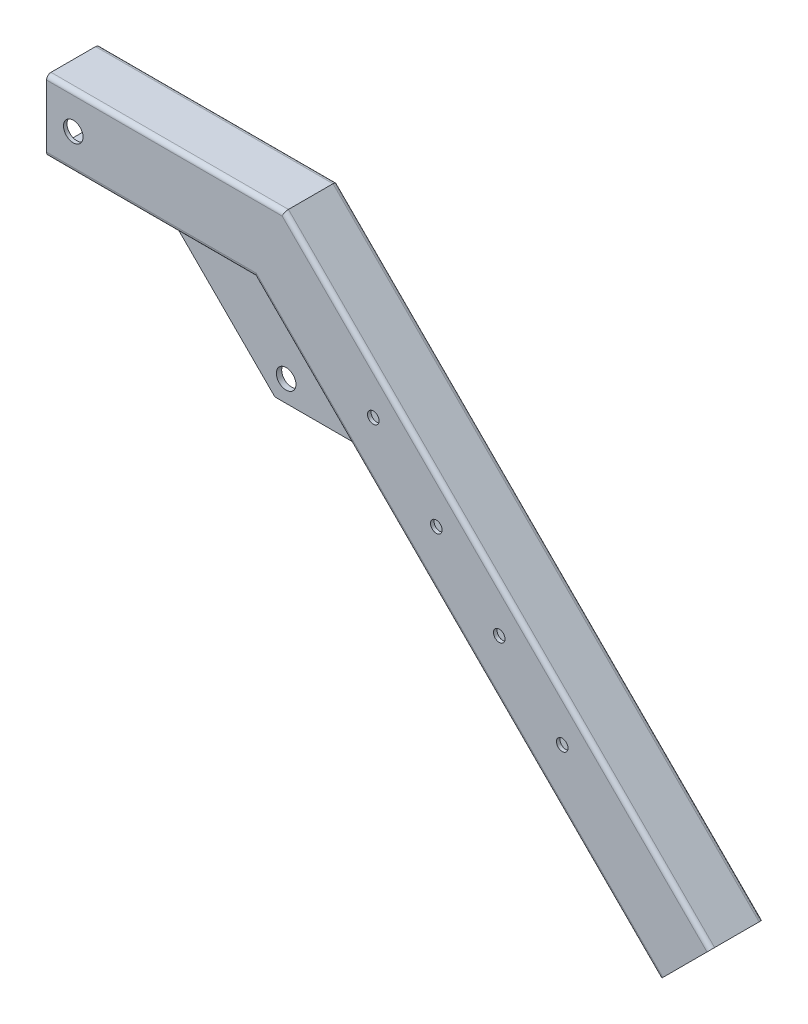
ISO-10303-21;
HEADER;
FILE_DESCRIPTION(('STEP AP214'),'2;1');
FILE_NAME('part.step','',(''),(''),'','','');
FILE_SCHEMA(('AUTOMOTIVE_DESIGN { 1 0 10303 214 1 1 1 1 }'));
ENDSEC;
DATA;
#1=APPLICATION_CONTEXT('core data for automotive mechanical design processes');
#2=APPLICATION_PROTOCOL_DEFINITION('international standard','automotive_design',2000,#1);
#3=PRODUCT_CONTEXT('',#1,'mechanical');
#4=PRODUCT('Part','Part','',(#3));
#5=PRODUCT_RELATED_PRODUCT_CATEGORY('part','',(#4));
#6=PRODUCT_DEFINITION_FORMATION('','',#4);
#7=PRODUCT_DEFINITION_CONTEXT('part definition',#1,'design');
#8=PRODUCT_DEFINITION('design','',#6,#7);
#9=PRODUCT_DEFINITION_SHAPE('','',#8);
#10=(LENGTH_UNIT() NAMED_UNIT(*) SI_UNIT(.MILLI.,.METRE.));
#11=(NAMED_UNIT(*) PLANE_ANGLE_UNIT() SI_UNIT($,.RADIAN.));
#12=(NAMED_UNIT(*) SI_UNIT($,.STERADIAN.) SOLID_ANGLE_UNIT());
#13=UNCERTAINTY_MEASURE_WITH_UNIT(LENGTH_MEASURE(1.E-05),#10,'distance_accuracy_value','');
#14=(GEOMETRIC_REPRESENTATION_CONTEXT(3) GLOBAL_UNCERTAINTY_ASSIGNED_CONTEXT((#13)) GLOBAL_UNIT_ASSIGNED_CONTEXT((#10,
#11,#12)) REPRESENTATION_CONTEXT('',''));
#15=CARTESIAN_POINT('',(0.,0.,0.));
#16=DIRECTION('',(0.,0.,1.));
#17=DIRECTION('',(1.,0.,0.));
#18=AXIS2_PLACEMENT_3D('',#15,#16,#17);
#19=CARTESIAN_POINT('',(235.,-125.,-30.));
#20=DIRECTION('',(0.,0.,1.));
#21=DIRECTION('',(1.,0.,0.));
#22=AXIS2_PLACEMENT_3D('',#19,#20,#21);
#23=CYLINDRICAL_SURFACE('',#22,11.);
#24=CARTESIAN_POINT('',(235.,-125.,20.));
#25=DIRECTION('',(0.,0.,1.));
#26=DIRECTION('',(1.,0.,0.));
#27=AXIS2_PLACEMENT_3D('',#24,#25,#26);
#28=CIRCLE('',#27,11.);
#29=CARTESIAN_POINT('',(246.,-125.,20.));
#30=VERTEX_POINT('',#29);
#31=EDGE_CURVE('E548',#30,#30,#28,.T.);
#32=CARTESIAN_POINT('',(235.,-125.,26.));
#33=DIRECTION('',(0.,0.,1.));
#34=DIRECTION('',(1.,0.,0.));
#35=AXIS2_PLACEMENT_3D('',#32,#33,#34);
#36=CIRCLE('',#35,11.);
#37=CARTESIAN_POINT('',(246.,-125.,26.));
#38=VERTEX_POINT('',#37);
#39=EDGE_CURVE('E19',#38,#38,#36,.T.);
#40=CARTESIAN_POINT('',(246.,-125.,20.));
#41=CARTESIAN_POINT('',(246.,-125.,20.0625));
#42=CARTESIAN_POINT('',(246.,-125.,20.125));
#43=CARTESIAN_POINT('',(246.,-125.,20.25));
#44=CARTESIAN_POINT('',(246.,-125.,20.3125));
#45=CARTESIAN_POINT('',(246.,-125.,20.4375));
#46=CARTESIAN_POINT('',(246.,-125.,20.5));
#47=CARTESIAN_POINT('',(246.,-125.,20.625));
#48=CARTESIAN_POINT('',(246.,-125.,20.6875));
#49=CARTESIAN_POINT('',(246.,-125.,20.8125));
#50=CARTESIAN_POINT('',(246.,-125.,20.875));
#51=CARTESIAN_POINT('',(246.,-125.,21.));
#52=CARTESIAN_POINT('',(246.,-125.,21.0625));
#53=CARTESIAN_POINT('',(246.,-125.,21.1875));
#54=CARTESIAN_POINT('',(246.,-125.,21.25));
#55=CARTESIAN_POINT('',(246.,-125.,21.375));
#56=CARTESIAN_POINT('',(246.,-125.,21.4375));
#57=CARTESIAN_POINT('',(246.,-125.,21.5625));
#58=CARTESIAN_POINT('',(246.,-125.,21.625));
#59=CARTESIAN_POINT('',(246.,-125.,21.75));
#60=CARTESIAN_POINT('',(246.,-125.,21.8125));
#61=CARTESIAN_POINT('',(246.,-125.,21.9375));
#62=CARTESIAN_POINT('',(246.,-125.,22.));
#63=CARTESIAN_POINT('',(246.,-125.,22.125));
#64=CARTESIAN_POINT('',(246.,-125.,22.1875));
#65=CARTESIAN_POINT('',(246.,-125.,22.3125));
#66=CARTESIAN_POINT('',(246.,-125.,22.375));
#67=CARTESIAN_POINT('',(246.,-125.,22.5));
#68=CARTESIAN_POINT('',(246.,-125.,22.5625));
#69=CARTESIAN_POINT('',(246.,-125.,22.6875));
#70=CARTESIAN_POINT('',(246.,-125.,22.75));
#71=CARTESIAN_POINT('',(246.,-125.,22.875));
#72=CARTESIAN_POINT('',(246.,-125.,22.9375));
#73=CARTESIAN_POINT('',(246.,-125.,23.0625));
#74=CARTESIAN_POINT('',(246.,-125.,23.125));
#75=CARTESIAN_POINT('',(246.,-125.,23.25));
#76=CARTESIAN_POINT('',(246.,-125.,23.3125));
#77=CARTESIAN_POINT('',(246.,-125.,23.4375));
#78=CARTESIAN_POINT('',(246.,-125.,23.5));
#79=CARTESIAN_POINT('',(246.,-125.,23.625));
#80=CARTESIAN_POINT('',(246.,-125.,23.6875));
#81=CARTESIAN_POINT('',(246.,-125.,23.8125));
#82=CARTESIAN_POINT('',(246.,-125.,23.875));
#83=CARTESIAN_POINT('',(246.,-125.,24.));
#84=CARTESIAN_POINT('',(246.,-125.,24.0625));
#85=CARTESIAN_POINT('',(246.,-125.,24.1875));
#86=CARTESIAN_POINT('',(246.,-125.,24.25));
#87=CARTESIAN_POINT('',(246.,-125.,24.375));
#88=CARTESIAN_POINT('',(246.,-125.,24.4375));
#89=CARTESIAN_POINT('',(246.,-125.,24.5625));
#90=CARTESIAN_POINT('',(246.,-125.,24.625));
#91=CARTESIAN_POINT('',(246.,-125.,24.75));
#92=CARTESIAN_POINT('',(246.,-125.,24.8125));
#93=CARTESIAN_POINT('',(246.,-125.,24.9375));
#94=CARTESIAN_POINT('',(246.,-125.,25.));
#95=CARTESIAN_POINT('',(246.,-125.,25.125));
#96=CARTESIAN_POINT('',(246.,-125.,25.1875));
#97=CARTESIAN_POINT('',(246.,-125.,25.3125));
#98=CARTESIAN_POINT('',(246.,-125.,25.375));
#99=CARTESIAN_POINT('',(246.,-125.,25.5));
#100=CARTESIAN_POINT('',(246.,-125.,25.5625));
#101=CARTESIAN_POINT('',(246.,-125.,25.6875));
#102=CARTESIAN_POINT('',(246.,-125.,25.75));
#103=CARTESIAN_POINT('',(246.,-125.,25.875));
#104=CARTESIAN_POINT('',(246.,-125.,25.9375));
#105=CARTESIAN_POINT('',(246.,-125.,26.));
#106=B_SPLINE_CURVE_WITH_KNOTS('',3,(#40,#41,#42,#43,#44,#45,#46,#47,#48,#49,#50,#51,#52,#53,
#54,#55,#56,#57,#58,#59,#60,#61,#62,#63,#64,#65,#66,#67,#68,#69,#70,#71,#72,#73,#74,#75,#76,#77,
#78,#79,#80,#81,#82,#83,#84,#85,#86,#87,#88,#89,#90,#91,#92,#93,#94,#95,#96,#97,#98,#99,#100,
#101,#102,#103,#104,#105),.UNSPECIFIED.,.F.,.F.,(4,2,2,2,2,2,2,2,2,2,2,2,2,2,2,2,2,2,2,2,2,2,2,
2,2,2,2,2,2,2,2,2,4),(0.,0.1875,0.375,0.5625,0.750000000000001,0.937500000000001,1.125,1.3125,
1.5,1.6875,1.875,2.0625,2.25,2.4375,2.625,2.8125,3.,3.1875,3.375,3.5625,3.75,3.9375,4.125,
4.3125,4.5,4.6875,4.875,5.0625,5.25,5.4375,5.625,5.8125,6.),.UNSPECIFIED.);
#107=EDGE_CURVE('BSEAM15',#30,#38,#106,.T.);
#108=ORIENTED_EDGE('',*,*,#31,.F.);
#109=ORIENTED_EDGE('',*,*,#39,.T.);
#110=ORIENTED_EDGE('',*,*,#107,.T.);
#111=ORIENTED_EDGE('',*,*,#107,.F.);
#112=EDGE_LOOP('',(#108,#110,#109,#111));
#113=FACE_BOUND('',#112,.T.);
#114=ADVANCED_FACE('F15',(#113),#23,.F.);
#115=CARTESIAN_POINT('',(235.,-125.,-30.));
#116=DIRECTION('',(0.,0.,1.));
#117=DIRECTION('',(1.,0.,0.));
#118=AXIS2_PLACEMENT_3D('',#115,#116,#117);
#119=CYLINDRICAL_SURFACE('',#118,11.);
#120=CARTESIAN_POINT('',(235.,-125.,-20.));
#121=DIRECTION('',(0.,0.,1.));
#122=DIRECTION('',(1.,0.,0.));
#123=AXIS2_PLACEMENT_3D('',#120,#121,#122);
#124=CIRCLE('',#123,11.);
#125=CARTESIAN_POINT('',(246.,-125.,-20.));
#126=VERTEX_POINT('',#125);
#127=EDGE_CURVE('E510',#126,#126,#124,.F.);
#128=CARTESIAN_POINT('',(235.,-125.,-26.));
#129=DIRECTION('',(0.,0.,1.));
#130=DIRECTION('',(1.,0.,0.));
#131=AXIS2_PLACEMENT_3D('',#128,#129,#130);
#132=CIRCLE('',#131,11.);
#133=CARTESIAN_POINT('',(246.,-125.,-26.));
#134=VERTEX_POINT('',#133);
#135=EDGE_CURVE('E529',#134,#134,#132,.F.);
#136=CARTESIAN_POINT('',(246.,-125.,-20.));
#137=CARTESIAN_POINT('',(246.,-125.,-20.0625));
#138=CARTESIAN_POINT('',(246.,-125.,-20.125));
#139=CARTESIAN_POINT('',(246.,-125.,-20.25));
#140=CARTESIAN_POINT('',(246.,-125.,-20.3125));
#141=CARTESIAN_POINT('',(246.,-125.,-20.4375));
#142=CARTESIAN_POINT('',(246.,-125.,-20.5));
#143=CARTESIAN_POINT('',(246.,-125.,-20.625));
#144=CARTESIAN_POINT('',(246.,-125.,-20.6875));
#145=CARTESIAN_POINT('',(246.,-125.,-20.8125));
#146=CARTESIAN_POINT('',(246.,-125.,-20.875));
#147=CARTESIAN_POINT('',(246.,-125.,-21.));
#148=CARTESIAN_POINT('',(246.,-125.,-21.0625));
#149=CARTESIAN_POINT('',(246.,-125.,-21.1875));
#150=CARTESIAN_POINT('',(246.,-125.,-21.25));
#151=CARTESIAN_POINT('',(246.,-125.,-21.375));
#152=CARTESIAN_POINT('',(246.,-125.,-21.4375));
#153=CARTESIAN_POINT('',(246.,-125.,-21.5625));
#154=CARTESIAN_POINT('',(246.,-125.,-21.625));
#155=CARTESIAN_POINT('',(246.,-125.,-21.75));
#156=CARTESIAN_POINT('',(246.,-125.,-21.8125));
#157=CARTESIAN_POINT('',(246.,-125.,-21.9375));
#158=CARTESIAN_POINT('',(246.,-125.,-22.));
#159=CARTESIAN_POINT('',(246.,-125.,-22.125));
#160=CARTESIAN_POINT('',(246.,-125.,-22.1875));
#161=CARTESIAN_POINT('',(246.,-125.,-22.3125));
#162=CARTESIAN_POINT('',(246.,-125.,-22.375));
#163=CARTESIAN_POINT('',(246.,-125.,-22.5));
#164=CARTESIAN_POINT('',(246.,-125.,-22.5625));
#165=CARTESIAN_POINT('',(246.,-125.,-22.6875));
#166=CARTESIAN_POINT('',(246.,-125.,-22.75));
#167=CARTESIAN_POINT('',(246.,-125.,-22.875));
#168=CARTESIAN_POINT('',(246.,-125.,-22.9375));
#169=CARTESIAN_POINT('',(246.,-125.,-23.0625));
#170=CARTESIAN_POINT('',(246.,-125.,-23.125));
#171=CARTESIAN_POINT('',(246.,-125.,-23.25));
#172=CARTESIAN_POINT('',(246.,-125.,-23.3125));
#173=CARTESIAN_POINT('',(246.,-125.,-23.4375));
#174=CARTESIAN_POINT('',(246.,-125.,-23.5));
#175=CARTESIAN_POINT('',(246.,-125.,-23.625));
#176=CARTESIAN_POINT('',(246.,-125.,-23.6875));
#177=CARTESIAN_POINT('',(246.,-125.,-23.8125));
#178=CARTESIAN_POINT('',(246.,-125.,-23.875));
#179=CARTESIAN_POINT('',(246.,-125.,-24.));
#180=CARTESIAN_POINT('',(246.,-125.,-24.0625));
#181=CARTESIAN_POINT('',(246.,-125.,-24.1875));
#182=CARTESIAN_POINT('',(246.,-125.,-24.25));
#183=CARTESIAN_POINT('',(246.,-125.,-24.375));
#184=CARTESIAN_POINT('',(246.,-125.,-24.4375));
#185=CARTESIAN_POINT('',(246.,-125.,-24.5625));
#186=CARTESIAN_POINT('',(246.,-125.,-24.625));
#187=CARTESIAN_POINT('',(246.,-125.,-24.75));
#188=CARTESIAN_POINT('',(246.,-125.,-24.8125));
#189=CARTESIAN_POINT('',(246.,-125.,-24.9375));
#190=CARTESIAN_POINT('',(246.,-125.,-25.));
#191=CARTESIAN_POINT('',(246.,-125.,-25.125));
#192=CARTESIAN_POINT('',(246.,-125.,-25.1875));
#193=CARTESIAN_POINT('',(246.,-125.,-25.3125));
#194=CARTESIAN_POINT('',(246.,-125.,-25.375));
#195=CARTESIAN_POINT('',(246.,-125.,-25.5));
#196=CARTESIAN_POINT('',(246.,-125.,-25.5625));
#197=CARTESIAN_POINT('',(246.,-125.,-25.6875));
#198=CARTESIAN_POINT('',(246.,-125.,-25.75));
#199=CARTESIAN_POINT('',(246.,-125.,-25.875));
#200=CARTESIAN_POINT('',(246.,-125.,-25.9375));
#201=CARTESIAN_POINT('',(246.,-125.,-26.));
#202=B_SPLINE_CURVE_WITH_KNOTS('',3,(#136,#137,#138,#139,#140,#141,#142,#143,#144,#145,#146,
#147,#148,#149,#150,#151,#152,#153,#154,#155,#156,#157,#158,#159,#160,#161,#162,#163,#164,#165,
#166,#167,#168,#169,#170,#171,#172,#173,#174,#175,#176,#177,#178,#179,#180,#181,#182,#183,#184,
#185,#186,#187,#188,#189,#190,#191,#192,#193,#194,#195,#196,#197,#198,#199,#200,#201),
.UNSPECIFIED.,.F.,.F.,(4,2,2,2,2,2,2,2,2,2,2,2,2,2,2,2,2,2,2,2,2,2,2,2,2,2,2,2,2,2,2,2,4),(0.,
0.1875,0.375,0.5625,0.750000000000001,0.937500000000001,1.125,1.3125,1.5,1.6875,1.875,2.0625,
2.25,2.4375,2.625,2.8125,3.,3.1875,3.375,3.5625,3.75,3.9375,4.125,4.3125,4.5,4.6875,4.875,
5.0625,5.25,5.4375,5.62500000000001,5.81250000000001,6.00000000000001),.UNSPECIFIED.);
#203=EDGE_CURVE('BSEAM706',#126,#134,#202,.T.);
#204=ORIENTED_EDGE('',*,*,#127,.F.);
#205=ORIENTED_EDGE('',*,*,#135,.T.);
#206=ORIENTED_EDGE('',*,*,#203,.T.);
#207=ORIENTED_EDGE('',*,*,#203,.F.);
#208=EDGE_LOOP('',(#204,#206,#205,#207));
#209=FACE_BOUND('',#208,.T.);
#210=ADVANCED_FACE('F706',(#209),#119,.F.);
#211=CARTESIAN_POINT('',(203.431457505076,-39.9999999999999,26.));
#212=DIRECTION('',(0.,0.,-1.));
#213=DIRECTION('',(-1.,0.,0.));
#214=AXIS2_PLACEMENT_3D('',#211,#212,#213);
#215=PLANE('',#214);
#216=DIRECTION('',(0.707106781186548,-0.707106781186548,0.));
#217=VECTOR('',#216,1.);
#218=CARTESIAN_POINT('',(113.431457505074,-39.9999999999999,26.));
#219=LINE('',#218,#217);
#220=CARTESIAN_POINT('',(222.325901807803,-148.894444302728,26.));
#221=VERTEX_POINT('',#220);
#222=CARTESIAN_POINT('',(113.431457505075,-40.,26.));
#223=VERTEX_POINT('',#222);
#224=EDGE_CURVE('E528',#221,#223,#219,.F.);
#225=ORIENTED_EDGE('',*,*,#224,.F.);
#226=DIRECTION('',(1.,0.,0.));
#227=VECTOR('',#226,1.);
#228=CARTESIAN_POINT('',(222.325901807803,-148.894444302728,26.));
#229=LINE('',#228,#227);
#230=CARTESIAN_POINT('',(312.325901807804,-148.894444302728,26.));
#231=VERTEX_POINT('',#230);
#232=EDGE_CURVE('E543',#231,#221,#229,.F.);
#233=ORIENTED_EDGE('',*,*,#232,.F.);
#234=DIRECTION('',(-0.707106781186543,0.707106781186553,0.));
#235=VECTOR('',#234,1.);
#236=CARTESIAN_POINT('',(203.431457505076,-39.9999999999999,26.));
#237=LINE('',#236,#235);
#238=CARTESIAN_POINT('',(203.431457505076,-39.9999999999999,26.));
#239=VERTEX_POINT('',#238);
#240=EDGE_CURVE('E574',#239,#231,#237,.F.);
#241=ORIENTED_EDGE('',*,*,#240,.F.);
#242=DIRECTION('',(1.,0.,0.));
#243=VECTOR('',#242,1.);
#244=CARTESIAN_POINT('',(113.431457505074,-39.9999999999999,26.));
#245=LINE('',#244,#243);
#246=EDGE_CURVE('E471',#223,#239,#245,.T.);
#247=ORIENTED_EDGE('',*,*,#246,.F.);
#248=EDGE_LOOP('',(#225,#233,#241,#247));
#249=FACE_BOUND('',#248,.T.);
#250=ORIENTED_EDGE('',*,*,#39,.F.);
#251=EDGE_LOOP('',(#250));
#252=FACE_BOUND('',#251,.T.);
#253=ADVANCED_FACE('F923',(#249,#252),#215,.F.);
#254=CARTESIAN_POINT('',(654.16356364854,-470.933116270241,22.5));
#255=DIRECTION('',(0.707106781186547,-0.707106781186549,0.));
#256=DIRECTION('',(0.707106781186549,0.707106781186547,0.));
#257=AXIS2_PLACEMENT_3D('',#254,#255,#256);
#258=PLANE('',#257);
#259=DIRECTION('',(0.70710678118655,0.707106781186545,0.));
#260=VECTOR('',#259,1.);
#261=CARTESIAN_POINT('',(647.092495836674,-478.004184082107,22.5));
#262=LINE('',#261,#260);
#263=CARTESIAN_POINT('',(647.092495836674,-478.004184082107,22.5));
#264=VERTEX_POINT('',#263);
#265=CARTESIAN_POINT('',(654.163563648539,-470.933116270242,22.5));
#266=VERTEX_POINT('',#265);
#267=EDGE_CURVE('E419',#264,#266,#262,.T.);
#268=ORIENTED_EDGE('',*,*,#267,.T.);
#269=DIRECTION('',(0.,0.,1.));
#270=VECTOR('',#269,1.);
#271=CARTESIAN_POINT('',(654.16356364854,-470.933116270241,22.5));
#272=LINE('',#271,#270);
#273=CARTESIAN_POINT('',(654.163563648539,-470.933116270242,-22.5));
#274=VERTEX_POINT('',#273);
#275=EDGE_CURVE('E429',#266,#274,#272,.F.);
#276=ORIENTED_EDGE('',*,*,#275,.T.);
#277=DIRECTION('',(-0.70710678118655,-0.707106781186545,0.));
#278=VECTOR('',#277,1.);
#279=CARTESIAN_POINT('',(654.16356364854,-470.933116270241,-22.5));
#280=LINE('',#279,#278);
#281=CARTESIAN_POINT('',(647.092495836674,-478.004184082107,-22.5));
#282=VERTEX_POINT('',#281);
#283=EDGE_CURVE('E448',#274,#282,#280,.T.);
#284=ORIENTED_EDGE('',*,*,#283,.T.);
#285=DIRECTION('',(0.,0.,1.));
#286=VECTOR('',#285,1.);
#287=CARTESIAN_POINT('',(647.092495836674,-478.004184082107,30.));
#288=LINE('',#287,#286);
#289=EDGE_CURVE('E407',#264,#282,#288,.F.);
#290=ORIENTED_EDGE('',*,*,#289,.F.);
#291=EDGE_LOOP('',(#268,#276,#284,#290));
#292=FACE_BOUND('',#291,.T.);
#293=ADVANCED_FACE('F925',(#292),#258,.F.);
#294=CARTESIAN_POINT('',(203.431457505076,-39.9999999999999,20.));
#295=DIRECTION('',(0.707106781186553,0.707106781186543,0.));
#296=DIRECTION('',(-0.707106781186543,0.707106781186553,0.));
#297=AXIS2_PLACEMENT_3D('',#294,#295,#296);
#298=PLANE('',#297);
#299=DIRECTION('',(0.,0.,1.));
#300=VECTOR('',#299,1.);
#301=CARTESIAN_POINT('',(203.431457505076,-39.9999999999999,20.));
#302=LINE('',#301,#300);
#303=CARTESIAN_POINT('',(203.431457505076,-39.9999999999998,25.));
#304=VERTEX_POINT('',#303);
#305=EDGE_CURVE('E462',#239,#304,#302,.F.);
#306=ORIENTED_EDGE('',*,*,#305,.F.);
#307=ORIENTED_EDGE('',*,*,#240,.T.);
#308=DIRECTION('',(0.,0.,-1.));
#309=VECTOR('',#308,1.);
#310=CARTESIAN_POINT('',(312.325901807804,-148.894444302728,20.));
#311=LINE('',#310,#309);
#312=CARTESIAN_POINT('',(312.325901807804,-148.894444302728,25.));
#313=VERTEX_POINT('',#312);
#314=EDGE_CURVE('E534',#313,#231,#311,.F.);
#315=ORIENTED_EDGE('',*,*,#314,.F.);
#316=DIRECTION('',(0.707106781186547,-0.707106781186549,0.));
#317=VECTOR('',#316,1.);
#318=CARTESIAN_POINT('',(658.406204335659,-494.974746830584,25.));
#319=LINE('',#318,#317);
#320=EDGE_CURVE('E402',#304,#313,#319,.T.);
#321=ORIENTED_EDGE('',*,*,#320,.F.);
#322=EDGE_LOOP('',(#306,#307,#315,#321));
#323=FACE_BOUND('',#322,.T.);
#324=ADVANCED_FACE('F932',(#323),#298,.T.);
#325=CARTESIAN_POINT('',(222.325901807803,-148.894444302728,20.));
#326=DIRECTION('',(0.,-1.,0.));
#327=DIRECTION('',(0.,0.,-1.));
#328=AXIS2_PLACEMENT_3D('',#325,#326,#327);
#329=PLANE('',#328);
#330=DIRECTION('',(0.,0.,1.));
#331=VECTOR('',#330,1.);
#332=CARTESIAN_POINT('',(312.325901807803,-148.894444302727,30.));
#333=LINE('',#332,#331);
#334=CARTESIAN_POINT('',(312.325901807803,-148.894444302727,20.));
#335=VERTEX_POINT('',#334);
#336=EDGE_CURVE('E392',#335,#313,#333,.T.);
#337=ORIENTED_EDGE('',*,*,#336,.T.);
#338=ORIENTED_EDGE('',*,*,#314,.T.);
#339=ORIENTED_EDGE('',*,*,#232,.T.);
#340=DIRECTION('',(0.,0.,1.));
#341=VECTOR('',#340,1.);
#342=CARTESIAN_POINT('',(222.325901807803,-148.894444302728,20.));
#343=LINE('',#342,#341);
#344=CARTESIAN_POINT('',(222.325901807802,-148.894444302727,20.));
#345=VERTEX_POINT('',#344);
#346=EDGE_CURVE('E567',#345,#221,#343,.T.);
#347=ORIENTED_EDGE('',*,*,#346,.F.);
#348=DIRECTION('',(-1.,0.,0.));
#349=VECTOR('',#348,1.);
#350=CARTESIAN_POINT('',(203.431457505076,-148.894444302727,20.));
#351=LINE('',#350,#349);
#352=EDGE_CURVE('E511',#335,#345,#351,.T.);
#353=ORIENTED_EDGE('',*,*,#352,.F.);
#354=EDGE_LOOP('',(#337,#338,#339,#347,#353));
#355=FACE_BOUND('',#354,.T.);
#356=ADVANCED_FACE('F722',(#355),#329,.T.);
#357=CARTESIAN_POINT('',(222.325901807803,-148.894444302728,-20.));
#358=DIRECTION('',(0.,1.,0.));
#359=DIRECTION('',(0.,0.,1.));
#360=AXIS2_PLACEMENT_3D('',#357,#358,#359);
#361=PLANE('',#360);
#362=DIRECTION('',(0.,0.,1.));
#363=VECTOR('',#362,1.);
#364=CARTESIAN_POINT('',(312.325901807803,-148.894444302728,-20.));
#365=LINE('',#364,#363);
#366=CARTESIAN_POINT('',(312.325901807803,-148.894444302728,-25.));
#367=VERTEX_POINT('',#366);
#368=CARTESIAN_POINT('',(312.325901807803,-148.894444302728,-26.));
#369=VERTEX_POINT('',#368);
#370=EDGE_CURVE('E532',#367,#369,#365,.F.);
#371=ORIENTED_EDGE('',*,*,#370,.F.);
#372=DIRECTION('',(0.,0.,1.));
#373=VECTOR('',#372,1.);
#374=CARTESIAN_POINT('',(312.325901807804,-148.894444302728,30.));
#375=LINE('',#374,#373);
#376=CARTESIAN_POINT('',(312.325901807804,-148.894444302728,-20.));
#377=VERTEX_POINT('',#376);
#378=EDGE_CURVE('E382',#367,#377,#375,.T.);
#379=ORIENTED_EDGE('',*,*,#378,.T.);
#380=DIRECTION('',(1.,0.,0.));
#381=VECTOR('',#380,1.);
#382=CARTESIAN_POINT('',(203.431457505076,-148.894444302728,-20.));
#383=LINE('',#382,#381);
#384=CARTESIAN_POINT('',(222.325901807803,-148.894444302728,-20.));
#385=VERTEX_POINT('',#384);
#386=EDGE_CURVE('E482',#385,#377,#383,.T.);
#387=ORIENTED_EDGE('',*,*,#386,.F.);
#388=DIRECTION('',(0.,0.,1.));
#389=VECTOR('',#388,1.);
#390=CARTESIAN_POINT('',(222.325901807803,-148.894444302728,-20.));
#391=LINE('',#390,#389);
#392=CARTESIAN_POINT('',(222.325901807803,-148.894444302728,-26.));
#393=VERTEX_POINT('',#392);
#394=EDGE_CURVE('E481',#385,#393,#391,.F.);
#395=ORIENTED_EDGE('',*,*,#394,.T.);
#396=DIRECTION('',(1.,0.,0.));
#397=VECTOR('',#396,1.);
#398=CARTESIAN_POINT('',(203.431457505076,-148.894444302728,-26.));
#399=LINE('',#398,#397);
#400=EDGE_CURVE('E525',#393,#369,#399,.T.);
#401=ORIENTED_EDGE('',*,*,#400,.T.);
#402=EDGE_LOOP('',(#371,#379,#387,#395,#401));
#403=FACE_BOUND('',#402,.T.);
#404=ADVANCED_FACE('F711',(#403),#361,.F.);
#405=CARTESIAN_POINT('',(203.431457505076,-39.9999999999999,-26.));
#406=DIRECTION('',(0.,0.,1.));
#407=DIRECTION('',(1.,0.,0.));
#408=AXIS2_PLACEMENT_3D('',#405,#406,#407);
#409=PLANE('',#408);
#410=DIRECTION('',(0.707106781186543,-0.707106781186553,0.));
#411=VECTOR('',#410,1.);
#412=CARTESIAN_POINT('',(203.431457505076,-39.9999999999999,-26.));
#413=LINE('',#412,#411);
#414=CARTESIAN_POINT('',(203.431457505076,-39.9999999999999,-26.));
#415=VERTEX_POINT('',#414);
#416=EDGE_CURVE('E385',#415,#369,#413,.T.);
#417=ORIENTED_EDGE('',*,*,#416,.T.);
#418=ORIENTED_EDGE('',*,*,#400,.F.);
#419=DIRECTION('',(-0.707106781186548,0.707106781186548,0.));
#420=VECTOR('',#419,1.);
#421=CARTESIAN_POINT('',(113.431457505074,-39.9999999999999,-26.));
#422=LINE('',#421,#420);
#423=CARTESIAN_POINT('',(113.431457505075,-40.,-26.));
#424=VERTEX_POINT('',#423);
#425=EDGE_CURVE('E466',#393,#424,#422,.T.);
#426=ORIENTED_EDGE('',*,*,#425,.T.);
#427=DIRECTION('',(1.,0.,0.));
#428=VECTOR('',#427,1.);
#429=CARTESIAN_POINT('',(113.431457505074,-39.9999999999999,-26.));
#430=LINE('',#429,#428);
#431=EDGE_CURVE('E368',#424,#415,#430,.T.);
#432=ORIENTED_EDGE('',*,*,#431,.T.);
#433=EDGE_LOOP('',(#417,#418,#426,#432));
#434=FACE_BOUND('',#433,.T.);
#435=ORIENTED_EDGE('',*,*,#135,.F.);
#436=EDGE_LOOP('',(#435));
#437=FACE_BOUND('',#436,.T.);
#438=ADVANCED_FACE('F708',(#434,#437),#409,.F.);
#439=CARTESIAN_POINT('',(113.431457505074,-39.9999999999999,20.));
#440=DIRECTION('',(-0.707106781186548,-0.707106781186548,0.));
#441=DIRECTION('',(0.707106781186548,-0.707106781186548,0.));
#442=AXIS2_PLACEMENT_3D('',#439,#440,#441);
#443=PLANE('',#442);
#444=DIRECTION('',(-0.707106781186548,0.707106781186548,0.));
#445=VECTOR('',#444,1.);
#446=CARTESIAN_POINT('',(222.325901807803,-148.894444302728,20.));
#447=LINE('',#446,#445);
#448=CARTESIAN_POINT('',(113.431457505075,-40.,20.));
#449=VERTEX_POINT('',#448);
#450=EDGE_CURVE('E507',#345,#449,#447,.T.);
#451=ORIENTED_EDGE('',*,*,#450,.F.);
#452=ORIENTED_EDGE('',*,*,#346,.T.);
#453=ORIENTED_EDGE('',*,*,#224,.T.);
#454=DIRECTION('',(0.,0.,1.));
#455=VECTOR('',#454,1.);
#456=CARTESIAN_POINT('',(113.431457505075,-40.,20.));
#457=LINE('',#456,#455);
#458=CARTESIAN_POINT('',(113.431457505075,-40.,25.));
#459=VERTEX_POINT('',#458);
#460=EDGE_CURVE('E465',#459,#223,#457,.T.);
#461=ORIENTED_EDGE('',*,*,#460,.F.);
#462=DIRECTION('',(0.,0.,1.));
#463=VECTOR('',#462,1.);
#464=CARTESIAN_POINT('',(113.431457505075,-40.,30.));
#465=LINE('',#464,#463);
#466=EDGE_CURVE('E373',#459,#449,#465,.F.);
#467=ORIENTED_EDGE('',*,*,#466,.T.);
#468=EDGE_LOOP('',(#451,#452,#453,#461,#467));
#469=FACE_BOUND('',#468,.T.);
#470=ADVANCED_FACE('F710',(#469),#443,.T.);
#471=CARTESIAN_POINT('',(203.431457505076,-39.9999999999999,20.));
#472=DIRECTION('',(0.,0.,-1.));
#473=DIRECTION('',(-1.,0.,0.));
#474=AXIS2_PLACEMENT_3D('',#471,#472,#473);
#475=PLANE('',#474);
#476=ORIENTED_EDGE('',*,*,#352,.T.);
#477=ORIENTED_EDGE('',*,*,#450,.T.);
#478=DIRECTION('',(1.,0.,0.));
#479=VECTOR('',#478,1.);
#480=CARTESIAN_POINT('',(-30.0000000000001,-39.9999999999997,20.));
#481=LINE('',#480,#479);
#482=CARTESIAN_POINT('',(203.431457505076,-39.9999999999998,20.));
#483=VERTEX_POINT('',#482);
#484=EDGE_CURVE('E475',#449,#483,#481,.T.);
#485=ORIENTED_EDGE('',*,*,#484,.T.);
#486=DIRECTION('',(-0.707106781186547,0.707106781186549,0.));
#487=VECTOR('',#486,1.);
#488=CARTESIAN_POINT('',(191.715728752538,-28.2842712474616,20.));
#489=LINE('',#488,#487);
#490=EDGE_CURVE('E496',#483,#335,#489,.F.);
#491=ORIENTED_EDGE('',*,*,#490,.T.);
#492=EDGE_LOOP('',(#476,#477,#485,#491));
#493=FACE_BOUND('',#492,.T.);
#494=ORIENTED_EDGE('',*,*,#31,.T.);
#495=EDGE_LOOP('',(#494));
#496=FACE_BOUND('',#495,.T.);
#497=ADVANCED_FACE('F719',(#493,#496),#475,.T.);
#498=CARTESIAN_POINT('',(203.431457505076,-39.9999999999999,-20.));
#499=DIRECTION('',(0.,0.,1.));
#500=DIRECTION('',(1.,0.,0.));
#501=AXIS2_PLACEMENT_3D('',#498,#499,#500);
#502=PLANE('',#501);
#503=ORIENTED_EDGE('',*,*,#386,.T.);
#504=DIRECTION('',(-0.707106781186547,0.707106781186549,0.));
#505=VECTOR('',#504,1.);
#506=CARTESIAN_POINT('',(191.715728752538,-28.2842712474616,-20.));
#507=LINE('',#506,#505);
#508=CARTESIAN_POINT('',(203.431457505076,-39.9999999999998,-20.));
#509=VERTEX_POINT('',#508);
#510=EDGE_CURVE('E493',#377,#509,#507,.T.);
#511=ORIENTED_EDGE('',*,*,#510,.T.);
#512=DIRECTION('',(1.,0.,0.));
#513=VECTOR('',#512,1.);
#514=CARTESIAN_POINT('',(-30.0000000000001,-39.9999999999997,-20.));
#515=LINE('',#514,#513);
#516=CARTESIAN_POINT('',(113.431457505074,-39.9999999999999,-20.));
#517=VERTEX_POINT('',#516);
#518=EDGE_CURVE('E362',#509,#517,#515,.F.);
#519=ORIENTED_EDGE('',*,*,#518,.T.);
#520=DIRECTION('',(-0.707106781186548,0.707106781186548,0.));
#521=VECTOR('',#520,1.);
#522=CARTESIAN_POINT('',(113.431457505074,-39.9999999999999,-20.));
#523=LINE('',#522,#521);
#524=EDGE_CURVE('E478',#517,#385,#523,.F.);
#525=ORIENTED_EDGE('',*,*,#524,.T.);
#526=EDGE_LOOP('',(#503,#511,#519,#525));
#527=FACE_BOUND('',#526,.T.);
#528=ORIENTED_EDGE('',*,*,#127,.T.);
#529=EDGE_LOOP('',(#528));
#530=FACE_BOUND('',#529,.T.);
#531=ADVANCED_FACE('F905',(#527,#530),#502,.T.);
#532=CARTESIAN_POINT('',(113.431457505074,-39.9999999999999,-20.));
#533=DIRECTION('',(0.707106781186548,0.707106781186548,0.));
#534=DIRECTION('',(-0.707106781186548,0.707106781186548,0.));
#535=AXIS2_PLACEMENT_3D('',#532,#533,#534);
#536=PLANE('',#535);
#537=ORIENTED_EDGE('',*,*,#394,.F.);
#538=ORIENTED_EDGE('',*,*,#524,.F.);
#539=DIRECTION('',(0.,0.,1.));
#540=VECTOR('',#539,1.);
#541=CARTESIAN_POINT('',(113.431457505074,-39.9999999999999,30.));
#542=LINE('',#541,#540);
#543=CARTESIAN_POINT('',(113.431457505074,-39.9999999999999,-25.));
#544=VERTEX_POINT('',#543);
#545=EDGE_CURVE('E357',#517,#544,#542,.F.);
#546=ORIENTED_EDGE('',*,*,#545,.T.);
#547=DIRECTION('',(0.,0.,-1.));
#548=VECTOR('',#547,1.);
#549=CARTESIAN_POINT('',(113.431457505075,-40.,-20.));
#550=LINE('',#549,#548);
#551=EDGE_CURVE('E367',#544,#424,#550,.T.);
#552=ORIENTED_EDGE('',*,*,#551,.T.);
#553=ORIENTED_EDGE('',*,*,#425,.F.);
#554=EDGE_LOOP('',(#537,#538,#546,#552,#553));
#555=FACE_BOUND('',#554,.T.);
#556=ADVANCED_FACE('F901',(#555),#536,.F.);
#557=CARTESIAN_POINT('',(113.431457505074,-39.9999999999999,20.));
#558=DIRECTION('',(0.,1.,0.));
#559=DIRECTION('',(0.,0.,1.));
#560=AXIS2_PLACEMENT_3D('',#557,#558,#559);
#561=PLANE('',#560);
#562=ORIENTED_EDGE('',*,*,#460,.T.);
#563=ORIENTED_EDGE('',*,*,#246,.T.);
#564=ORIENTED_EDGE('',*,*,#305,.T.);
#565=DIRECTION('',(1.,0.,0.));
#566=VECTOR('',#565,1.);
#567=CARTESIAN_POINT('',(658.406204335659,-40.,25.));
#568=LINE('',#567,#566);
#569=EDGE_CURVE('E356',#459,#304,#568,.T.);
#570=ORIENTED_EDGE('',*,*,#569,.F.);
#571=EDGE_LOOP('',(#562,#563,#564,#570));
#572=FACE_BOUND('',#571,.T.);
#573=ADVANCED_FACE('F898',(#572),#561,.T.);
#574=CARTESIAN_POINT('',(195.251262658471,-24.748737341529,-25.));
#575=DIRECTION('',(-0.707106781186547,0.707106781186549,0.));
#576=DIRECTION('',(-0.707106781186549,-0.707106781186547,0.));
#577=AXIS2_PLACEMENT_3D('',#574,#575,#576);
#578=CYLINDRICAL_SURFACE('',#577,0.999999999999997);
#579=DIRECTION('',(-0.707106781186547,0.707106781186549,0.));
#580=VECTOR('',#579,1.);
#581=CARTESIAN_POINT('',(194.544155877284,-25.4558441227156,-25.));
#582=LINE('',#581,#580);
#583=CARTESIAN_POINT('',(661.234631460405,-492.146319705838,-25.));
#584=VERTEX_POINT('',#583);
#585=CARTESIAN_POINT('',(205.088311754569,-35.9999999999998,-25.));
#586=VERTEX_POINT('',#585);
#587=EDGE_CURVE('E403',#584,#586,#582,.T.);
#588=ORIENTED_EDGE('',*,*,#587,.F.);
#589=CARTESIAN_POINT('',(661.941738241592,-491.439212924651,-25.));
#590=DIRECTION('',(-0.707106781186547,0.707106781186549,0.));
#591=DIRECTION('',(-0.707106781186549,-0.707106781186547,0.));
#592=AXIS2_PLACEMENT_3D('',#589,#590,#591);
#593=CIRCLE('',#592,0.999999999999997);
#594=CARTESIAN_POINT('',(661.941738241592,-491.439212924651,-26.));
#595=VERTEX_POINT('',#594);
#596=EDGE_CURVE('E177',#595,#584,#593,.T.);
#597=ORIENTED_EDGE('',*,*,#596,.F.);
#598=DIRECTION('',(-0.707106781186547,0.707106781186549,0.));
#599=VECTOR('',#598,1.);
#600=CARTESIAN_POINT('',(661.941738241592,-491.439212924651,-26.));
#601=LINE('',#600,#599);
#602=CARTESIAN_POINT('',(205.502525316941,-34.9999999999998,-26.));
#603=VERTEX_POINT('',#602);
#604=EDGE_CURVE('E330',#595,#603,#601,.T.);
#605=ORIENTED_EDGE('',*,*,#604,.T.);
#606=CARTESIAN_POINT('',(205.502525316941,-34.9999999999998,-25.));
#607=DIRECTION('',(-0.923879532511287,0.382683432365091,0.));
#608=DIRECTION('',(0.382683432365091,0.923879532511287,0.));
#609=AXIS2_PLACEMENT_3D('',#606,#607,#608);
#610=ELLIPSE('',#609,1.08239220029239,0.999999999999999);
#611=EDGE_CURVE('E697',#603,#586,#610,.T.);
#612=ORIENTED_EDGE('',*,*,#611,.T.);
#613=EDGE_LOOP('',(#588,#597,#605,#612));
#614=FACE_BOUND('',#613,.T.);
#615=ADVANCED_FACE('F894',(#614),#578,.F.);
#616=CARTESIAN_POINT('',(-30.0000000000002,-34.9999999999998,-25.));
#617=DIRECTION('',(-1.,0.,0.));
#618=DIRECTION('',(0.,0.,1.));
#619=AXIS2_PLACEMENT_3D('',#616,#617,#618);
#620=CYLINDRICAL_SURFACE('',#619,1.);
#621=DIRECTION('',(1.,0.,0.));
#622=VECTOR('',#621,1.);
#623=CARTESIAN_POINT('',(-30.0000000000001,-35.9999999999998,-25.));
#624=LINE('',#623,#622);
#625=CARTESIAN_POINT('',(-30.0000000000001,-35.9999999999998,-25.));
#626=VERTEX_POINT('',#625);
#627=EDGE_CURVE('E336',#586,#626,#624,.F.);
#628=ORIENTED_EDGE('',*,*,#627,.F.);
#629=ORIENTED_EDGE('',*,*,#611,.F.);
#630=DIRECTION('',(-1.,0.,0.));
#631=VECTOR('',#630,1.);
#632=CARTESIAN_POINT('',(658.406204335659,-34.9999999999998,-26.));
#633=LINE('',#632,#631);
#634=CARTESIAN_POINT('',(-30.0000000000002,-34.9999999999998,-26.));
#635=VERTEX_POINT('',#634);
#636=EDGE_CURVE('E326',#603,#635,#633,.T.);
#637=ORIENTED_EDGE('',*,*,#636,.T.);
#638=CARTESIAN_POINT('',(-30.0000000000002,-34.9999999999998,-25.));
#639=DIRECTION('',(-1.,0.,0.));
#640=DIRECTION('',(0.,0.,1.));
#641=AXIS2_PLACEMENT_3D('',#638,#639,#640);
#642=CIRCLE('',#641,1.);
#643=EDGE_CURVE('E695',#626,#635,#642,.F.);
#644=ORIENTED_EDGE('',*,*,#643,.F.);
#645=EDGE_LOOP('',(#628,#629,#637,#644));
#646=FACE_BOUND('',#645,.T.);
#647=ADVANCED_FACE('F890',(#646),#620,.F.);
#648=CARTESIAN_POINT('',(711.43921292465,-441.941738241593,-25.));
#649=DIRECTION('',(0.707106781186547,-0.707106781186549,0.));
#650=DIRECTION('',(0.707106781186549,0.707106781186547,0.));
#651=AXIS2_PLACEMENT_3D('',#648,#649,#650);
#652=CYLINDRICAL_SURFACE('',#651,1.00000000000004);
#653=DIRECTION('',(0.707106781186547,-0.707106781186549,0.));
#654=VECTOR('',#653,1.);
#655=CARTESIAN_POINT('',(234.497474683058,35.0000000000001,-26.));
#656=LINE('',#655,#654);
#657=CARTESIAN_POINT('',(234.497474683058,35.0000000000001,-26.));
#658=VERTEX_POINT('',#657);
#659=CARTESIAN_POINT('',(711.43921292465,-441.941738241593,-26.));
#660=VERTEX_POINT('',#659);
#661=EDGE_CURVE('E322',#658,#660,#656,.T.);
#662=ORIENTED_EDGE('',*,*,#661,.T.);
#663=CARTESIAN_POINT('',(711.43921292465,-441.941738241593,-25.));
#664=DIRECTION('',(0.707106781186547,-0.707106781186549,0.));
#665=DIRECTION('',(0.707106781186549,0.707106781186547,0.));
#666=AXIS2_PLACEMENT_3D('',#663,#664,#665);
#667=CIRCLE('',#666,1.00000000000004);
#668=CARTESIAN_POINT('',(712.146319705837,-441.234631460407,-25.));
#669=VERTEX_POINT('',#668);
#670=EDGE_CURVE('E693',#669,#660,#667,.F.);
#671=ORIENTED_EDGE('',*,*,#670,.F.);
#672=DIRECTION('',(-0.707106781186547,0.707106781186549,0.));
#673=VECTOR('',#672,1.);
#674=CARTESIAN_POINT('',(245.455844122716,25.4558441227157,-25.));
#675=LINE('',#674,#673);
#676=CARTESIAN_POINT('',(234.911688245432,36.0000000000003,-25.));
#677=VERTEX_POINT('',#676);
#678=EDGE_CURVE('E449',#669,#677,#675,.T.);
#679=ORIENTED_EDGE('',*,*,#678,.T.);
#680=CARTESIAN_POINT('',(234.497474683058,35.0000000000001,-25.));
#681=DIRECTION('',(0.923879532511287,-0.382683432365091,0.));
#682=DIRECTION('',(0.382683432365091,0.923879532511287,0.));
#683=AXIS2_PLACEMENT_3D('',#680,#681,#682);
#684=ELLIPSE('',#683,1.08239220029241,1.00000000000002);
#685=EDGE_CURVE('E691',#677,#658,#684,.F.);
#686=ORIENTED_EDGE('',*,*,#685,.T.);
#687=EDGE_LOOP('',(#662,#671,#679,#686));
#688=FACE_BOUND('',#687,.T.);
#689=ADVANCED_FACE('F886',(#688),#652,.F.);
#690=CARTESIAN_POINT('',(658.406204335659,35.0000000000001,-25.));
#691=DIRECTION('',(1.,0.,0.));
#692=DIRECTION('',(0.,0.,-1.));
#693=AXIS2_PLACEMENT_3D('',#690,#691,#692);
#694=CYLINDRICAL_SURFACE('',#693,1.);
#695=DIRECTION('',(-1.,0.,0.));
#696=VECTOR('',#695,1.);
#697=CARTESIAN_POINT('',(658.406204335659,35.0000000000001,-26.));
#698=LINE('',#697,#696);
#699=CARTESIAN_POINT('',(-30.0000000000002,35.0000000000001,-26.));
#700=VERTEX_POINT('',#699);
#701=EDGE_CURVE('E329',#700,#658,#698,.F.);
#702=ORIENTED_EDGE('',*,*,#701,.T.);
#703=ORIENTED_EDGE('',*,*,#685,.F.);
#704=DIRECTION('',(1.,0.,0.));
#705=VECTOR('',#704,1.);
#706=CARTESIAN_POINT('',(-30.0000000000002,36.0000000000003,-25.));
#707=LINE('',#706,#705);
#708=CARTESIAN_POINT('',(-30.0000000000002,36.0000000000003,-25.));
#709=VERTEX_POINT('',#708);
#710=EDGE_CURVE('E318',#677,#709,#707,.F.);
#711=ORIENTED_EDGE('',*,*,#710,.T.);
#712=CARTESIAN_POINT('',(-30.0000000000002,35.0000000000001,-25.));
#713=DIRECTION('',(1.,0.,0.));
#714=DIRECTION('',(0.,0.,-1.));
#715=AXIS2_PLACEMENT_3D('',#712,#713,#714);
#716=CIRCLE('',#715,1.);
#717=EDGE_CURVE('E689',#700,#709,#716,.T.);
#718=ORIENTED_EDGE('',*,*,#717,.F.);
#719=EDGE_LOOP('',(#702,#703,#711,#718));
#720=FACE_BOUND('',#719,.T.);
#721=ADVANCED_FACE('F882',(#720),#694,.F.);
#722=CARTESIAN_POINT('',(548.953452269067,-321.882384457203,-30.));
#723=DIRECTION('',(0.,0.,1.));
#724=DIRECTION('',(1.,0.,0.));
#725=AXIS2_PLACEMENT_3D('',#722,#723,#724);
#726=CYLINDRICAL_SURFACE('',#725,6.50000000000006);
#727=CARTESIAN_POINT('',(548.953452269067,-321.882384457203,26.));
#728=DIRECTION('',(0.,0.,1.));
#729=DIRECTION('',(1.,0.,0.));
#730=AXIS2_PLACEMENT_3D('',#727,#728,#729);
#731=CIRCLE('',#730,6.50000000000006);
#732=CARTESIAN_POINT('',(555.453452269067,-321.882384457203,26.));
#733=VERTEX_POINT('',#732);
#734=EDGE_CURVE('E458',#733,#733,#731,.T.);
#735=CARTESIAN_POINT('',(548.953452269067,-321.882384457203,30.));
#736=DIRECTION('',(0.,0.,1.));
#737=DIRECTION('',(1.,0.,0.));
#738=AXIS2_PLACEMENT_3D('',#735,#736,#737);
#739=CIRCLE('',#738,6.50000000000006);
#740=CARTESIAN_POINT('',(555.453452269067,-321.882384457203,30.));
#741=VERTEX_POINT('',#740);
#742=EDGE_CURVE('E672',#741,#741,#739,.T.);
#743=CARTESIAN_POINT('',(555.453452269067,-321.882384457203,26.));
#744=CARTESIAN_POINT('',(555.453452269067,-321.882384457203,26.0416666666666));
#745=CARTESIAN_POINT('',(555.453452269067,-321.882384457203,26.0833333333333));
#746=CARTESIAN_POINT('',(555.453452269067,-321.882384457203,26.1666666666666));
#747=CARTESIAN_POINT('',(555.453452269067,-321.882384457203,26.2083333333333));
#748=CARTESIAN_POINT('',(555.453452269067,-321.882384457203,26.2916666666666));
#749=CARTESIAN_POINT('',(555.453452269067,-321.882384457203,26.3333333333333));
#750=CARTESIAN_POINT('',(555.453452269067,-321.882384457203,26.4166666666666));
#751=CARTESIAN_POINT('',(555.453452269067,-321.882384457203,26.4583333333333));
#752=CARTESIAN_POINT('',(555.453452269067,-321.882384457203,26.5416666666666));
#753=CARTESIAN_POINT('',(555.453452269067,-321.882384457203,26.5833333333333));
#754=CARTESIAN_POINT('',(555.453452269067,-321.882384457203,26.6666666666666));
#755=CARTESIAN_POINT('',(555.453452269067,-321.882384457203,26.7083333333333));
#756=CARTESIAN_POINT('',(555.453452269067,-321.882384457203,26.7916666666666));
#757=CARTESIAN_POINT('',(555.453452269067,-321.882384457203,26.8333333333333));
#758=CARTESIAN_POINT('',(555.453452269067,-321.882384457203,26.9166666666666));
#759=CARTESIAN_POINT('',(555.453452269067,-321.882384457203,26.9583333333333));
#760=CARTESIAN_POINT('',(555.453452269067,-321.882384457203,27.0416666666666));
#761=CARTESIAN_POINT('',(555.453452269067,-321.882384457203,27.0833333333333));
#762=CARTESIAN_POINT('',(555.453452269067,-321.882384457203,27.1666666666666));
#763=CARTESIAN_POINT('',(555.453452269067,-321.882384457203,27.2083333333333));
#764=CARTESIAN_POINT('',(555.453452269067,-321.882384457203,27.2916666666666));
#765=CARTESIAN_POINT('',(555.453452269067,-321.882384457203,27.3333333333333));
#766=CARTESIAN_POINT('',(555.453452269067,-321.882384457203,27.4166666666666));
#767=CARTESIAN_POINT('',(555.453452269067,-321.882384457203,27.4583333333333));
#768=CARTESIAN_POINT('',(555.453452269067,-321.882384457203,27.5416666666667));
#769=CARTESIAN_POINT('',(555.453452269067,-321.882384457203,27.5833333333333));
#770=CARTESIAN_POINT('',(555.453452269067,-321.882384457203,27.6666666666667));
#771=CARTESIAN_POINT('',(555.453452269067,-321.882384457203,27.7083333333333));
#772=CARTESIAN_POINT('',(555.453452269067,-321.882384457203,27.7916666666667));
#773=CARTESIAN_POINT('',(555.453452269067,-321.882384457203,27.8333333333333));
#774=CARTESIAN_POINT('',(555.453452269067,-321.882384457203,27.9166666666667));
#775=CARTESIAN_POINT('',(555.453452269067,-321.882384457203,27.9583333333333));
#776=CARTESIAN_POINT('',(555.453452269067,-321.882384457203,28.0416666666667));
#777=CARTESIAN_POINT('',(555.453452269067,-321.882384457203,28.0833333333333));
#778=CARTESIAN_POINT('',(555.453452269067,-321.882384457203,28.1666666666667));
#779=CARTESIAN_POINT('',(555.453452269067,-321.882384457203,28.2083333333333));
#780=CARTESIAN_POINT('',(555.453452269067,-321.882384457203,28.2916666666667));
#781=CARTESIAN_POINT('',(555.453452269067,-321.882384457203,28.3333333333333));
#782=CARTESIAN_POINT('',(555.453452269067,-321.882384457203,28.4166666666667));
#783=CARTESIAN_POINT('',(555.453452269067,-321.882384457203,28.4583333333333));
#784=CARTESIAN_POINT('',(555.453452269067,-321.882384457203,28.5416666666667));
#785=CARTESIAN_POINT('',(555.453452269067,-321.882384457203,28.5833333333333));
#786=CARTESIAN_POINT('',(555.453452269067,-321.882384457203,28.6666666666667));
#787=CARTESIAN_POINT('',(555.453452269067,-321.882384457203,28.7083333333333));
#788=CARTESIAN_POINT('',(555.453452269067,-321.882384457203,28.7916666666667));
#789=CARTESIAN_POINT('',(555.453452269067,-321.882384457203,28.8333333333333));
#790=CARTESIAN_POINT('',(555.453452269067,-321.882384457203,28.9166666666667));
#791=CARTESIAN_POINT('',(555.453452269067,-321.882384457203,28.9583333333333));
#792=CARTESIAN_POINT('',(555.453452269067,-321.882384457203,29.0416666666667));
#793=CARTESIAN_POINT('',(555.453452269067,-321.882384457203,29.0833333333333));
#794=CARTESIAN_POINT('',(555.453452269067,-321.882384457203,29.1666666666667));
#795=CARTESIAN_POINT('',(555.453452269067,-321.882384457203,29.2083333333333));
#796=CARTESIAN_POINT('',(555.453452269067,-321.882384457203,29.2916666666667));
#797=CARTESIAN_POINT('',(555.453452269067,-321.882384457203,29.3333333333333));
#798=CARTESIAN_POINT('',(555.453452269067,-321.882384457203,29.4166666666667));
#799=CARTESIAN_POINT('',(555.453452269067,-321.882384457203,29.4583333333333));
#800=CARTESIAN_POINT('',(555.453452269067,-321.882384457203,29.5416666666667));
#801=CARTESIAN_POINT('',(555.453452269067,-321.882384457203,29.5833333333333));
#802=CARTESIAN_POINT('',(555.453452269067,-321.882384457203,29.6666666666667));
#803=CARTESIAN_POINT('',(555.453452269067,-321.882384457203,29.7083333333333));
#804=CARTESIAN_POINT('',(555.453452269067,-321.882384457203,29.7916666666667));
#805=CARTESIAN_POINT('',(555.453452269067,-321.882384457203,29.8333333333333));
#806=CARTESIAN_POINT('',(555.453452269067,-321.882384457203,29.9166666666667));
#807=CARTESIAN_POINT('',(555.453452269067,-321.882384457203,29.9583333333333));
#808=CARTESIAN_POINT('',(555.453452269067,-321.882384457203,30.));
#809=B_SPLINE_CURVE_WITH_KNOTS('',3,(#743,#744,#745,#746,#747,#748,#749,#750,#751,#752,#753,
#754,#755,#756,#757,#758,#759,#760,#761,#762,#763,#764,#765,#766,#767,#768,#769,#770,#771,#772,
#773,#774,#775,#776,#777,#778,#779,#780,#781,#782,#783,#784,#785,#786,#787,#788,#789,#790,#791,
#792,#793,#794,#795,#796,#797,#798,#799,#800,#801,#802,#803,#804,#805,#806,#807,#808),
.UNSPECIFIED.,.F.,.F.,(4,2,2,2,2,2,2,2,2,2,2,2,2,2,2,2,2,2,2,2,2,2,2,2,2,2,2,2,2,2,2,2,4),(0.,
0.125,0.25,0.375,0.5,0.625000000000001,0.750000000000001,0.875000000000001,1.,1.125,1.25,1.375,
1.5,1.625,1.75,1.875,2.,2.125,2.25,2.375,2.5,2.625,2.75,2.875,3.,3.125,3.25,3.375,3.5,3.625,
3.75,3.875,4.),.UNSPECIFIED.);
#810=EDGE_CURVE('BSEAM878',#733,#741,#809,.T.);
#811=ORIENTED_EDGE('',*,*,#734,.F.);
#812=ORIENTED_EDGE('',*,*,#742,.T.);
#813=ORIENTED_EDGE('',*,*,#810,.T.);
#814=ORIENTED_EDGE('',*,*,#810,.F.);
#815=EDGE_LOOP('',(#811,#813,#812,#814));
#816=FACE_BOUND('',#815,.T.);
#817=ADVANCED_FACE('F878',(#816),#726,.F.);
#818=CARTESIAN_POINT('',(478.242774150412,-251.171706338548,-30.));
#819=DIRECTION('',(0.,0.,1.));
#820=DIRECTION('',(1.,0.,0.));
#821=AXIS2_PLACEMENT_3D('',#818,#819,#820);
#822=CYLINDRICAL_SURFACE('',#821,6.50000000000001);
#823=CARTESIAN_POINT('',(478.242774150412,-251.171706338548,26.));
#824=DIRECTION('',(0.,0.,1.));
#825=DIRECTION('',(1.,0.,0.));
#826=AXIS2_PLACEMENT_3D('',#823,#824,#825);
#827=CIRCLE('',#826,6.50000000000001);
#828=CARTESIAN_POINT('',(484.742774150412,-251.171706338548,26.));
#829=VERTEX_POINT('',#828);
#830=EDGE_CURVE('E655',#829,#829,#827,.T.);
#831=CARTESIAN_POINT('',(478.242774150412,-251.171706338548,30.));
#832=DIRECTION('',(0.,0.,1.));
#833=DIRECTION('',(1.,0.,0.));
#834=AXIS2_PLACEMENT_3D('',#831,#832,#833);
#835=CIRCLE('',#834,6.50000000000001);
#836=CARTESIAN_POINT('',(484.742774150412,-251.171706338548,30.));
#837=VERTEX_POINT('',#836);
#838=EDGE_CURVE('E669',#837,#837,#835,.T.);
#839=CARTESIAN_POINT('',(484.742774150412,-251.171706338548,26.));
#840=CARTESIAN_POINT('',(484.742774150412,-251.171706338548,26.0416666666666));
#841=CARTESIAN_POINT('',(484.742774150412,-251.171706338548,26.0833333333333));
#842=CARTESIAN_POINT('',(484.742774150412,-251.171706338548,26.1666666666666));
#843=CARTESIAN_POINT('',(484.742774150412,-251.171706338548,26.2083333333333));
#844=CARTESIAN_POINT('',(484.742774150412,-251.171706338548,26.2916666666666));
#845=CARTESIAN_POINT('',(484.742774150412,-251.171706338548,26.3333333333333));
#846=CARTESIAN_POINT('',(484.742774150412,-251.171706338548,26.4166666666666));
#847=CARTESIAN_POINT('',(484.742774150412,-251.171706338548,26.4583333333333));
#848=CARTESIAN_POINT('',(484.742774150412,-251.171706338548,26.5416666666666));
#849=CARTESIAN_POINT('',(484.742774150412,-251.171706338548,26.5833333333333));
#850=CARTESIAN_POINT('',(484.742774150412,-251.171706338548,26.6666666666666));
#851=CARTESIAN_POINT('',(484.742774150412,-251.171706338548,26.7083333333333));
#852=CARTESIAN_POINT('',(484.742774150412,-251.171706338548,26.7916666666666));
#853=CARTESIAN_POINT('',(484.742774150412,-251.171706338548,26.8333333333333));
#854=CARTESIAN_POINT('',(484.742774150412,-251.171706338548,26.9166666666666));
#855=CARTESIAN_POINT('',(484.742774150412,-251.171706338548,26.9583333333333));
#856=CARTESIAN_POINT('',(484.742774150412,-251.171706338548,27.0416666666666));
#857=CARTESIAN_POINT('',(484.742774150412,-251.171706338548,27.0833333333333));
#858=CARTESIAN_POINT('',(484.742774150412,-251.171706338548,27.1666666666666));
#859=CARTESIAN_POINT('',(484.742774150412,-251.171706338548,27.2083333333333));
#860=CARTESIAN_POINT('',(484.742774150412,-251.171706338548,27.2916666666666));
#861=CARTESIAN_POINT('',(484.742774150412,-251.171706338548,27.3333333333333));
#862=CARTESIAN_POINT('',(484.742774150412,-251.171706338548,27.4166666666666));
#863=CARTESIAN_POINT('',(484.742774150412,-251.171706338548,27.4583333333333));
#864=CARTESIAN_POINT('',(484.742774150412,-251.171706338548,27.5416666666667));
#865=CARTESIAN_POINT('',(484.742774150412,-251.171706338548,27.5833333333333));
#866=CARTESIAN_POINT('',(484.742774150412,-251.171706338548,27.6666666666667));
#867=CARTESIAN_POINT('',(484.742774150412,-251.171706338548,27.7083333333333));
#868=CARTESIAN_POINT('',(484.742774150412,-251.171706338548,27.7916666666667));
#869=CARTESIAN_POINT('',(484.742774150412,-251.171706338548,27.8333333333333));
#870=CARTESIAN_POINT('',(484.742774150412,-251.171706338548,27.9166666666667));
#871=CARTESIAN_POINT('',(484.742774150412,-251.171706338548,27.9583333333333));
#872=CARTESIAN_POINT('',(484.742774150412,-251.171706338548,28.0416666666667));
#873=CARTESIAN_POINT('',(484.742774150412,-251.171706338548,28.0833333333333));
#874=CARTESIAN_POINT('',(484.742774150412,-251.171706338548,28.1666666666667));
#875=CARTESIAN_POINT('',(484.742774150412,-251.171706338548,28.2083333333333));
#876=CARTESIAN_POINT('',(484.742774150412,-251.171706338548,28.2916666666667));
#877=CARTESIAN_POINT('',(484.742774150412,-251.171706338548,28.3333333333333));
#878=CARTESIAN_POINT('',(484.742774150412,-251.171706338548,28.4166666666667));
#879=CARTESIAN_POINT('',(484.742774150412,-251.171706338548,28.4583333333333));
#880=CARTESIAN_POINT('',(484.742774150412,-251.171706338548,28.5416666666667));
#881=CARTESIAN_POINT('',(484.742774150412,-251.171706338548,28.5833333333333));
#882=CARTESIAN_POINT('',(484.742774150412,-251.171706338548,28.6666666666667));
#883=CARTESIAN_POINT('',(484.742774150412,-251.171706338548,28.7083333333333));
#884=CARTESIAN_POINT('',(484.742774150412,-251.171706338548,28.7916666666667));
#885=CARTESIAN_POINT('',(484.742774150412,-251.171706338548,28.8333333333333));
#886=CARTESIAN_POINT('',(484.742774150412,-251.171706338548,28.9166666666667));
#887=CARTESIAN_POINT('',(484.742774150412,-251.171706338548,28.9583333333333));
#888=CARTESIAN_POINT('',(484.742774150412,-251.171706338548,29.0416666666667));
#889=CARTESIAN_POINT('',(484.742774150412,-251.171706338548,29.0833333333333));
#890=CARTESIAN_POINT('',(484.742774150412,-251.171706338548,29.1666666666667));
#891=CARTESIAN_POINT('',(484.742774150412,-251.171706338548,29.2083333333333));
#892=CARTESIAN_POINT('',(484.742774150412,-251.171706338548,29.2916666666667));
#893=CARTESIAN_POINT('',(484.742774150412,-251.171706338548,29.3333333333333));
#894=CARTESIAN_POINT('',(484.742774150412,-251.171706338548,29.4166666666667));
#895=CARTESIAN_POINT('',(484.742774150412,-251.171706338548,29.4583333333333));
#896=CARTESIAN_POINT('',(484.742774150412,-251.171706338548,29.5416666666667));
#897=CARTESIAN_POINT('',(484.742774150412,-251.171706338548,29.5833333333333));
#898=CARTESIAN_POINT('',(484.742774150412,-251.171706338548,29.6666666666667));
#899=CARTESIAN_POINT('',(484.742774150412,-251.171706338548,29.7083333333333));
#900=CARTESIAN_POINT('',(484.742774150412,-251.171706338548,29.7916666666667));
#901=CARTESIAN_POINT('',(484.742774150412,-251.171706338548,29.8333333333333));
#902=CARTESIAN_POINT('',(484.742774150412,-251.171706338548,29.9166666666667));
#903=CARTESIAN_POINT('',(484.742774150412,-251.171706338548,29.9583333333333));
#904=CARTESIAN_POINT('',(484.742774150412,-251.171706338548,30.));
#905=B_SPLINE_CURVE_WITH_KNOTS('',3,(#839,#840,#841,#842,#843,#844,#845,#846,#847,#848,#849,
#850,#851,#852,#853,#854,#855,#856,#857,#858,#859,#860,#861,#862,#863,#864,#865,#866,#867,#868,
#869,#870,#871,#872,#873,#874,#875,#876,#877,#878,#879,#880,#881,#882,#883,#884,#885,#886,#887,
#888,#889,#890,#891,#892,#893,#894,#895,#896,#897,#898,#899,#900,#901,#902,#903,#904),
.UNSPECIFIED.,.F.,.F.,(4,2,2,2,2,2,2,2,2,2,2,2,2,2,2,2,2,2,2,2,2,2,2,2,2,2,2,2,2,2,2,2,4),(0.,
0.125,0.25,0.375,0.5,0.625000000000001,0.750000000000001,0.875000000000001,1.,1.125,1.25,1.375,
1.5,1.625,1.75,1.875,2.,2.125,2.25,2.375,2.5,2.625,2.75,2.875,3.,3.125,3.25,3.375,3.5,3.625,
3.75,3.875,4.),.UNSPECIFIED.);
#906=EDGE_CURVE('BSEAM874',#829,#837,#905,.T.);
#907=ORIENTED_EDGE('',*,*,#830,.F.);
#908=ORIENTED_EDGE('',*,*,#838,.T.);
#909=ORIENTED_EDGE('',*,*,#906,.T.);
#910=ORIENTED_EDGE('',*,*,#906,.F.);
#911=EDGE_LOOP('',(#907,#909,#908,#910));
#912=FACE_BOUND('',#911,.T.);
#913=ADVANCED_FACE('F874',(#912),#822,.F.);
#914=CARTESIAN_POINT('',(407.532096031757,-180.461028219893,-30.));
#915=DIRECTION('',(0.,0.,1.));
#916=DIRECTION('',(1.,0.,0.));
#917=AXIS2_PLACEMENT_3D('',#914,#915,#916);
#918=CYLINDRICAL_SURFACE('',#917,6.50000000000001);
#919=CARTESIAN_POINT('',(407.532096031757,-180.461028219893,26.));
#920=DIRECTION('',(0.,0.,1.));
#921=DIRECTION('',(1.,0.,0.));
#922=AXIS2_PLACEMENT_3D('',#919,#920,#921);
#923=CIRCLE('',#922,6.50000000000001);
#924=CARTESIAN_POINT('',(414.032096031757,-180.461028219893,26.));
#925=VERTEX_POINT('',#924);
#926=EDGE_CURVE('E652',#925,#925,#923,.T.);
#927=CARTESIAN_POINT('',(407.532096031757,-180.461028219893,30.));
#928=DIRECTION('',(0.,0.,1.));
#929=DIRECTION('',(1.,0.,0.));
#930=AXIS2_PLACEMENT_3D('',#927,#928,#929);
#931=CIRCLE('',#930,6.50000000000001);
#932=CARTESIAN_POINT('',(414.032096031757,-180.461028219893,30.));
#933=VERTEX_POINT('',#932);
#934=EDGE_CURVE('E666',#933,#933,#931,.T.);
#935=CARTESIAN_POINT('',(414.032096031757,-180.461028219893,26.));
#936=CARTESIAN_POINT('',(414.032096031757,-180.461028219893,26.0416666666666));
#937=CARTESIAN_POINT('',(414.032096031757,-180.461028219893,26.0833333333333));
#938=CARTESIAN_POINT('',(414.032096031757,-180.461028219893,26.1666666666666));
#939=CARTESIAN_POINT('',(414.032096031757,-180.461028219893,26.2083333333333));
#940=CARTESIAN_POINT('',(414.032096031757,-180.461028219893,26.2916666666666));
#941=CARTESIAN_POINT('',(414.032096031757,-180.461028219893,26.3333333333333));
#942=CARTESIAN_POINT('',(414.032096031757,-180.461028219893,26.4166666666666));
#943=CARTESIAN_POINT('',(414.032096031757,-180.461028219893,26.4583333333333));
#944=CARTESIAN_POINT('',(414.032096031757,-180.461028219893,26.5416666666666));
#945=CARTESIAN_POINT('',(414.032096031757,-180.461028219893,26.5833333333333));
#946=CARTESIAN_POINT('',(414.032096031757,-180.461028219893,26.6666666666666));
#947=CARTESIAN_POINT('',(414.032096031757,-180.461028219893,26.7083333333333));
#948=CARTESIAN_POINT('',(414.032096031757,-180.461028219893,26.7916666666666));
#949=CARTESIAN_POINT('',(414.032096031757,-180.461028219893,26.8333333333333));
#950=CARTESIAN_POINT('',(414.032096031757,-180.461028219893,26.9166666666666));
#951=CARTESIAN_POINT('',(414.032096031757,-180.461028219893,26.9583333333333));
#952=CARTESIAN_POINT('',(414.032096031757,-180.461028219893,27.0416666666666));
#953=CARTESIAN_POINT('',(414.032096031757,-180.461028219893,27.0833333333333));
#954=CARTESIAN_POINT('',(414.032096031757,-180.461028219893,27.1666666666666));
#955=CARTESIAN_POINT('',(414.032096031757,-180.461028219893,27.2083333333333));
#956=CARTESIAN_POINT('',(414.032096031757,-180.461028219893,27.2916666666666));
#957=CARTESIAN_POINT('',(414.032096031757,-180.461028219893,27.3333333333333));
#958=CARTESIAN_POINT('',(414.032096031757,-180.461028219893,27.4166666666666));
#959=CARTESIAN_POINT('',(414.032096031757,-180.461028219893,27.4583333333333));
#960=CARTESIAN_POINT('',(414.032096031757,-180.461028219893,27.5416666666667));
#961=CARTESIAN_POINT('',(414.032096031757,-180.461028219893,27.5833333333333));
#962=CARTESIAN_POINT('',(414.032096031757,-180.461028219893,27.6666666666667));
#963=CARTESIAN_POINT('',(414.032096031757,-180.461028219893,27.7083333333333));
#964=CARTESIAN_POINT('',(414.032096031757,-180.461028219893,27.7916666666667));
#965=CARTESIAN_POINT('',(414.032096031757,-180.461028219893,27.8333333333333));
#966=CARTESIAN_POINT('',(414.032096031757,-180.461028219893,27.9166666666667));
#967=CARTESIAN_POINT('',(414.032096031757,-180.461028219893,27.9583333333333));
#968=CARTESIAN_POINT('',(414.032096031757,-180.461028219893,28.0416666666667));
#969=CARTESIAN_POINT('',(414.032096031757,-180.461028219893,28.0833333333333));
#970=CARTESIAN_POINT('',(414.032096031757,-180.461028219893,28.1666666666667));
#971=CARTESIAN_POINT('',(414.032096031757,-180.461028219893,28.2083333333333));
#972=CARTESIAN_POINT('',(414.032096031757,-180.461028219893,28.2916666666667));
#973=CARTESIAN_POINT('',(414.032096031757,-180.461028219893,28.3333333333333));
#974=CARTESIAN_POINT('',(414.032096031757,-180.461028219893,28.4166666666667));
#975=CARTESIAN_POINT('',(414.032096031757,-180.461028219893,28.4583333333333));
#976=CARTESIAN_POINT('',(414.032096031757,-180.461028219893,28.5416666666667));
#977=CARTESIAN_POINT('',(414.032096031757,-180.461028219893,28.5833333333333));
#978=CARTESIAN_POINT('',(414.032096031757,-180.461028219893,28.6666666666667));
#979=CARTESIAN_POINT('',(414.032096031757,-180.461028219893,28.7083333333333));
#980=CARTESIAN_POINT('',(414.032096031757,-180.461028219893,28.7916666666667));
#981=CARTESIAN_POINT('',(414.032096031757,-180.461028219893,28.8333333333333));
#982=CARTESIAN_POINT('',(414.032096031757,-180.461028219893,28.9166666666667));
#983=CARTESIAN_POINT('',(414.032096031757,-180.461028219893,28.9583333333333));
#984=CARTESIAN_POINT('',(414.032096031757,-180.461028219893,29.0416666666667));
#985=CARTESIAN_POINT('',(414.032096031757,-180.461028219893,29.0833333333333));
#986=CARTESIAN_POINT('',(414.032096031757,-180.461028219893,29.1666666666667));
#987=CARTESIAN_POINT('',(414.032096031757,-180.461028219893,29.2083333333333));
#988=CARTESIAN_POINT('',(414.032096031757,-180.461028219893,29.2916666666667));
#989=CARTESIAN_POINT('',(414.032096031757,-180.461028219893,29.3333333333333));
#990=CARTESIAN_POINT('',(414.032096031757,-180.461028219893,29.4166666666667));
#991=CARTESIAN_POINT('',(414.032096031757,-180.461028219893,29.4583333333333));
#992=CARTESIAN_POINT('',(414.032096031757,-180.461028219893,29.5416666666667));
#993=CARTESIAN_POINT('',(414.032096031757,-180.461028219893,29.5833333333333));
#994=CARTESIAN_POINT('',(414.032096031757,-180.461028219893,29.6666666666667));
#995=CARTESIAN_POINT('',(414.032096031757,-180.461028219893,29.7083333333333));
#996=CARTESIAN_POINT('',(414.032096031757,-180.461028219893,29.7916666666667));
#997=CARTESIAN_POINT('',(414.032096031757,-180.461028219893,29.8333333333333));
#998=CARTESIAN_POINT('',(414.032096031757,-180.461028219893,29.9166666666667));
#999=CARTESIAN_POINT('',(414.032096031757,-180.461028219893,29.9583333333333));
#1000=CARTESIAN_POINT('',(414.032096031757,-180.461028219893,30.));
#1001=B_SPLINE_CURVE_WITH_KNOTS('',3,(#935,#936,#937,#938,#939,#940,#941,#942,#943,#944,#945,
#946,#947,#948,#949,#950,#951,#952,#953,#954,#955,#956,#957,#958,#959,#960,#961,#962,#963,#964,
#965,#966,#967,#968,#969,#970,#971,#972,#973,#974,#975,#976,#977,#978,#979,#980,#981,#982,#983,
#984,#985,#986,#987,#988,#989,#990,#991,#992,#993,#994,#995,#996,#997,#998,#999,#1000),
.UNSPECIFIED.,.F.,.F.,(4,2,2,2,2,2,2,2,2,2,2,2,2,2,2,2,2,2,2,2,2,2,2,2,2,2,2,2,2,2,2,2,4),(0.,
0.125,0.25,0.375,0.5,0.625000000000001,0.750000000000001,0.875000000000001,1.,1.125,1.25,1.375,
1.5,1.625,1.75,1.875,2.,2.125,2.25,2.375,2.5,2.625,2.75,2.875,3.,3.125,3.25,3.375,3.5,3.625,
3.75,3.875,4.),.UNSPECIFIED.);
#1002=EDGE_CURVE('BSEAM870',#925,#933,#1001,.T.);
#1003=ORIENTED_EDGE('',*,*,#926,.F.);
#1004=ORIENTED_EDGE('',*,*,#934,.T.);
#1005=ORIENTED_EDGE('',*,*,#1002,.T.);
#1006=ORIENTED_EDGE('',*,*,#1002,.F.);
#1007=EDGE_LOOP('',(#1003,#1005,#1004,#1006));
#1008=FACE_BOUND('',#1007,.T.);
#1009=ADVANCED_FACE('F870',(#1008),#918,.F.);
#1010=CARTESIAN_POINT('',(336.821417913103,-109.750350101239,-30.));
#1011=DIRECTION('',(0.,0.,1.));
#1012=DIRECTION('',(1.,0.,0.));
#1013=AXIS2_PLACEMENT_3D('',#1010,#1011,#1012);
#1014=CYLINDRICAL_SURFACE('',#1013,6.50000000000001);
#1015=CARTESIAN_POINT('',(336.821417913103,-109.750350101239,26.));
#1016=DIRECTION('',(0.,0.,1.));
#1017=DIRECTION('',(1.,0.,0.));
#1018=AXIS2_PLACEMENT_3D('',#1015,#1016,#1017);
#1019=CIRCLE('',#1018,6.50000000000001);
#1020=CARTESIAN_POINT('',(343.321417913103,-109.750350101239,26.));
#1021=VERTEX_POINT('',#1020);
#1022=EDGE_CURVE('E649',#1021,#1021,#1019,.T.);
#1023=CARTESIAN_POINT('',(336.821417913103,-109.750350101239,30.));
#1024=DIRECTION('',(0.,0.,1.));
#1025=DIRECTION('',(1.,0.,0.));
#1026=AXIS2_PLACEMENT_3D('',#1023,#1024,#1025);
#1027=CIRCLE('',#1026,6.50000000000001);
#1028=CARTESIAN_POINT('',(343.321417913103,-109.750350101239,30.));
#1029=VERTEX_POINT('',#1028);
#1030=EDGE_CURVE('E663',#1029,#1029,#1027,.T.);
#1031=CARTESIAN_POINT('',(343.321417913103,-109.750350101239,26.));
#1032=CARTESIAN_POINT('',(343.321417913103,-109.750350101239,26.0416666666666));
#1033=CARTESIAN_POINT('',(343.321417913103,-109.750350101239,26.0833333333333));
#1034=CARTESIAN_POINT('',(343.321417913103,-109.750350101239,26.1666666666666));
#1035=CARTESIAN_POINT('',(343.321417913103,-109.750350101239,26.2083333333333));
#1036=CARTESIAN_POINT('',(343.321417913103,-109.750350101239,26.2916666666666));
#1037=CARTESIAN_POINT('',(343.321417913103,-109.750350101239,26.3333333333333));
#1038=CARTESIAN_POINT('',(343.321417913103,-109.750350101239,26.4166666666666));
#1039=CARTESIAN_POINT('',(343.321417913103,-109.750350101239,26.4583333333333));
#1040=CARTESIAN_POINT('',(343.321417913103,-109.750350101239,26.5416666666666));
#1041=CARTESIAN_POINT('',(343.321417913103,-109.750350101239,26.5833333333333));
#1042=CARTESIAN_POINT('',(343.321417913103,-109.750350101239,26.6666666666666));
#1043=CARTESIAN_POINT('',(343.321417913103,-109.750350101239,26.7083333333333));
#1044=CARTESIAN_POINT('',(343.321417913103,-109.750350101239,26.7916666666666));
#1045=CARTESIAN_POINT('',(343.321417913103,-109.750350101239,26.8333333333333));
#1046=CARTESIAN_POINT('',(343.321417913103,-109.750350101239,26.9166666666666));
#1047=CARTESIAN_POINT('',(343.321417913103,-109.750350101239,26.9583333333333));
#1048=CARTESIAN_POINT('',(343.321417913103,-109.750350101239,27.0416666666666));
#1049=CARTESIAN_POINT('',(343.321417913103,-109.750350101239,27.0833333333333));
#1050=CARTESIAN_POINT('',(343.321417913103,-109.750350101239,27.1666666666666));
#1051=CARTESIAN_POINT('',(343.321417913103,-109.750350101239,27.2083333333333));
#1052=CARTESIAN_POINT('',(343.321417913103,-109.750350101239,27.2916666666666));
#1053=CARTESIAN_POINT('',(343.321417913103,-109.750350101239,27.3333333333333));
#1054=CARTESIAN_POINT('',(343.321417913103,-109.750350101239,27.4166666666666));
#1055=CARTESIAN_POINT('',(343.321417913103,-109.750350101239,27.4583333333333));
#1056=CARTESIAN_POINT('',(343.321417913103,-109.750350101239,27.5416666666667));
#1057=CARTESIAN_POINT('',(343.321417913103,-109.750350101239,27.5833333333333));
#1058=CARTESIAN_POINT('',(343.321417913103,-109.750350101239,27.6666666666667));
#1059=CARTESIAN_POINT('',(343.321417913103,-109.750350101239,27.7083333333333));
#1060=CARTESIAN_POINT('',(343.321417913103,-109.750350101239,27.7916666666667));
#1061=CARTESIAN_POINT('',(343.321417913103,-109.750350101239,27.8333333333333));
#1062=CARTESIAN_POINT('',(343.321417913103,-109.750350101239,27.9166666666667));
#1063=CARTESIAN_POINT('',(343.321417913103,-109.750350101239,27.9583333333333));
#1064=CARTESIAN_POINT('',(343.321417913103,-109.750350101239,28.0416666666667));
#1065=CARTESIAN_POINT('',(343.321417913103,-109.750350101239,28.0833333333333));
#1066=CARTESIAN_POINT('',(343.321417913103,-109.750350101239,28.1666666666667));
#1067=CARTESIAN_POINT('',(343.321417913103,-109.750350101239,28.2083333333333));
#1068=CARTESIAN_POINT('',(343.321417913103,-109.750350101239,28.2916666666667));
#1069=CARTESIAN_POINT('',(343.321417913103,-109.750350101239,28.3333333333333));
#1070=CARTESIAN_POINT('',(343.321417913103,-109.750350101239,28.4166666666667));
#1071=CARTESIAN_POINT('',(343.321417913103,-109.750350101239,28.4583333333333));
#1072=CARTESIAN_POINT('',(343.321417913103,-109.750350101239,28.5416666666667));
#1073=CARTESIAN_POINT('',(343.321417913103,-109.750350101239,28.5833333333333));
#1074=CARTESIAN_POINT('',(343.321417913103,-109.750350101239,28.6666666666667));
#1075=CARTESIAN_POINT('',(343.321417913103,-109.750350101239,28.7083333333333));
#1076=CARTESIAN_POINT('',(343.321417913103,-109.750350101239,28.7916666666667));
#1077=CARTESIAN_POINT('',(343.321417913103,-109.750350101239,28.8333333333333));
#1078=CARTESIAN_POINT('',(343.321417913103,-109.750350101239,28.9166666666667));
#1079=CARTESIAN_POINT('',(343.321417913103,-109.750350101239,28.9583333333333));
#1080=CARTESIAN_POINT('',(343.321417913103,-109.750350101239,29.0416666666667));
#1081=CARTESIAN_POINT('',(343.321417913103,-109.750350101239,29.0833333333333));
#1082=CARTESIAN_POINT('',(343.321417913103,-109.750350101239,29.1666666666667));
#1083=CARTESIAN_POINT('',(343.321417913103,-109.750350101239,29.2083333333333));
#1084=CARTESIAN_POINT('',(343.321417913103,-109.750350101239,29.2916666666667));
#1085=CARTESIAN_POINT('',(343.321417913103,-109.750350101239,29.3333333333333));
#1086=CARTESIAN_POINT('',(343.321417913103,-109.750350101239,29.4166666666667));
#1087=CARTESIAN_POINT('',(343.321417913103,-109.750350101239,29.4583333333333));
#1088=CARTESIAN_POINT('',(343.321417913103,-109.750350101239,29.5416666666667));
#1089=CARTESIAN_POINT('',(343.321417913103,-109.750350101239,29.5833333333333));
#1090=CARTESIAN_POINT('',(343.321417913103,-109.750350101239,29.6666666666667));
#1091=CARTESIAN_POINT('',(343.321417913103,-109.750350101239,29.7083333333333));
#1092=CARTESIAN_POINT('',(343.321417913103,-109.750350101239,29.7916666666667));
#1093=CARTESIAN_POINT('',(343.321417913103,-109.750350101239,29.8333333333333));
#1094=CARTESIAN_POINT('',(343.321417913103,-109.750350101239,29.9166666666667));
#1095=CARTESIAN_POINT('',(343.321417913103,-109.750350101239,29.9583333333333));
#1096=CARTESIAN_POINT('',(343.321417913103,-109.750350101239,30.));
#1097=B_SPLINE_CURVE_WITH_KNOTS('',3,(#1031,#1032,#1033,#1034,#1035,#1036,#1037,#1038,#1039,
#1040,#1041,#1042,#1043,#1044,#1045,#1046,#1047,#1048,#1049,#1050,#1051,#1052,#1053,#1054,#1055,
#1056,#1057,#1058,#1059,#1060,#1061,#1062,#1063,#1064,#1065,#1066,#1067,#1068,#1069,#1070,#1071,
#1072,#1073,#1074,#1075,#1076,#1077,#1078,#1079,#1080,#1081,#1082,#1083,#1084,#1085,#1086,#1087,
#1088,#1089,#1090,#1091,#1092,#1093,#1094,#1095,#1096),.UNSPECIFIED.,.F.,.F.,(4,2,2,2,2,2,2,2,2,
2,2,2,2,2,2,2,2,2,2,2,2,2,2,2,2,2,2,2,2,2,2,2,4),(0.,0.125,0.25,0.375,0.5,0.625000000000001,
0.750000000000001,0.875000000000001,1.,1.125,1.25,1.375,1.5,1.625,1.75,1.875,2.,2.125,2.25,
2.375,2.5,2.625,2.75,2.875,3.,3.125,3.25,3.375,3.5,3.625,3.75,3.875,4.),.UNSPECIFIED.);
#1098=EDGE_CURVE('BSEAM866',#1021,#1029,#1097,.T.);
#1099=ORIENTED_EDGE('',*,*,#1022,.F.);
#1100=ORIENTED_EDGE('',*,*,#1030,.T.);
#1101=ORIENTED_EDGE('',*,*,#1098,.T.);
#1102=ORIENTED_EDGE('',*,*,#1098,.F.);
#1103=EDGE_LOOP('',(#1099,#1101,#1100,#1102));
#1104=FACE_BOUND('',#1103,.T.);
#1105=ADVANCED_FACE('F866',(#1104),#1014,.F.);
#1106=CARTESIAN_POINT('',(0.,0.,-30.));
#1107=DIRECTION('',(0.,0.,1.));
#1108=DIRECTION('',(1.,0.,0.));
#1109=AXIS2_PLACEMENT_3D('',#1106,#1107,#1108);
#1110=CYLINDRICAL_SURFACE('',#1109,11.);
#1111=CARTESIAN_POINT('',(0.,0.,26.));
#1112=DIRECTION('',(0.,0.,1.));
#1113=DIRECTION('',(1.,0.,0.));
#1114=AXIS2_PLACEMENT_3D('',#1111,#1112,#1113);
#1115=CIRCLE('',#1114,11.);
#1116=CARTESIAN_POINT('',(11.,0.,26.));
#1117=VERTEX_POINT('',#1116);
#1118=EDGE_CURVE('E313',#1117,#1117,#1115,.T.);
#1119=CARTESIAN_POINT('',(0.,0.,30.));
#1120=DIRECTION('',(0.,0.,1.));
#1121=DIRECTION('',(1.,0.,0.));
#1122=AXIS2_PLACEMENT_3D('',#1119,#1120,#1121);
#1123=CIRCLE('',#1122,11.);
#1124=CARTESIAN_POINT('',(11.,0.,30.));
#1125=VERTEX_POINT('',#1124);
#1126=EDGE_CURVE('E397',#1125,#1125,#1123,.T.);
#1127=CARTESIAN_POINT('',(11.,0.,26.));
#1128=CARTESIAN_POINT('',(11.,0.,26.0416666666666));
#1129=CARTESIAN_POINT('',(11.,0.,26.0833333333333));
#1130=CARTESIAN_POINT('',(11.,0.,26.1666666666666));
#1131=CARTESIAN_POINT('',(11.,0.,26.2083333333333));
#1132=CARTESIAN_POINT('',(11.,0.,26.2916666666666));
#1133=CARTESIAN_POINT('',(11.,0.,26.3333333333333));
#1134=CARTESIAN_POINT('',(11.,0.,26.4166666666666));
#1135=CARTESIAN_POINT('',(11.,0.,26.4583333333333));
#1136=CARTESIAN_POINT('',(11.,0.,26.5416666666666));
#1137=CARTESIAN_POINT('',(11.,0.,26.5833333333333));
#1138=CARTESIAN_POINT('',(11.,0.,26.6666666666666));
#1139=CARTESIAN_POINT('',(11.,0.,26.7083333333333));
#1140=CARTESIAN_POINT('',(11.,0.,26.7916666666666));
#1141=CARTESIAN_POINT('',(11.,0.,26.8333333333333));
#1142=CARTESIAN_POINT('',(11.,0.,26.9166666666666));
#1143=CARTESIAN_POINT('',(11.,0.,26.9583333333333));
#1144=CARTESIAN_POINT('',(11.,0.,27.0416666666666));
#1145=CARTESIAN_POINT('',(11.,0.,27.0833333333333));
#1146=CARTESIAN_POINT('',(11.,0.,27.1666666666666));
#1147=CARTESIAN_POINT('',(11.,0.,27.2083333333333));
#1148=CARTESIAN_POINT('',(11.,0.,27.2916666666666));
#1149=CARTESIAN_POINT('',(11.,0.,27.3333333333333));
#1150=CARTESIAN_POINT('',(11.,0.,27.4166666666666));
#1151=CARTESIAN_POINT('',(11.,0.,27.4583333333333));
#1152=CARTESIAN_POINT('',(11.,0.,27.5416666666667));
#1153=CARTESIAN_POINT('',(11.,0.,27.5833333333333));
#1154=CARTESIAN_POINT('',(11.,0.,27.6666666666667));
#1155=CARTESIAN_POINT('',(11.,0.,27.7083333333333));
#1156=CARTESIAN_POINT('',(11.,0.,27.7916666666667));
#1157=CARTESIAN_POINT('',(11.,0.,27.8333333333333));
#1158=CARTESIAN_POINT('',(11.,0.,27.9166666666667));
#1159=CARTESIAN_POINT('',(11.,0.,27.9583333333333));
#1160=CARTESIAN_POINT('',(11.,0.,28.0416666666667));
#1161=CARTESIAN_POINT('',(11.,0.,28.0833333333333));
#1162=CARTESIAN_POINT('',(11.,0.,28.1666666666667));
#1163=CARTESIAN_POINT('',(11.,0.,28.2083333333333));
#1164=CARTESIAN_POINT('',(11.,0.,28.2916666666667));
#1165=CARTESIAN_POINT('',(11.,0.,28.3333333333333));
#1166=CARTESIAN_POINT('',(11.,0.,28.4166666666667));
#1167=CARTESIAN_POINT('',(11.,0.,28.4583333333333));
#1168=CARTESIAN_POINT('',(11.,0.,28.5416666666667));
#1169=CARTESIAN_POINT('',(11.,0.,28.5833333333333));
#1170=CARTESIAN_POINT('',(11.,0.,28.6666666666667));
#1171=CARTESIAN_POINT('',(11.,0.,28.7083333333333));
#1172=CARTESIAN_POINT('',(11.,0.,28.7916666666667));
#1173=CARTESIAN_POINT('',(11.,0.,28.8333333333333));
#1174=CARTESIAN_POINT('',(11.,0.,28.9166666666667));
#1175=CARTESIAN_POINT('',(11.,0.,28.9583333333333));
#1176=CARTESIAN_POINT('',(11.,0.,29.0416666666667));
#1177=CARTESIAN_POINT('',(11.,0.,29.0833333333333));
#1178=CARTESIAN_POINT('',(11.,0.,29.1666666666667));
#1179=CARTESIAN_POINT('',(11.,0.,29.2083333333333));
#1180=CARTESIAN_POINT('',(11.,0.,29.2916666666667));
#1181=CARTESIAN_POINT('',(11.,0.,29.3333333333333));
#1182=CARTESIAN_POINT('',(11.,0.,29.4166666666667));
#1183=CARTESIAN_POINT('',(11.,0.,29.4583333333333));
#1184=CARTESIAN_POINT('',(11.,0.,29.5416666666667));
#1185=CARTESIAN_POINT('',(11.,0.,29.5833333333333));
#1186=CARTESIAN_POINT('',(11.,0.,29.6666666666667));
#1187=CARTESIAN_POINT('',(11.,0.,29.7083333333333));
#1188=CARTESIAN_POINT('',(11.,0.,29.7916666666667));
#1189=CARTESIAN_POINT('',(11.,0.,29.8333333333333));
#1190=CARTESIAN_POINT('',(11.,0.,29.9166666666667));
#1191=CARTESIAN_POINT('',(11.,0.,29.9583333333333));
#1192=CARTESIAN_POINT('',(11.,0.,30.));
#1193=B_SPLINE_CURVE_WITH_KNOTS('',3,(#1127,#1128,#1129,#1130,#1131,#1132,#1133,#1134,#1135,
#1136,#1137,#1138,#1139,#1140,#1141,#1142,#1143,#1144,#1145,#1146,#1147,#1148,#1149,#1150,#1151,
#1152,#1153,#1154,#1155,#1156,#1157,#1158,#1159,#1160,#1161,#1162,#1163,#1164,#1165,#1166,#1167,
#1168,#1169,#1170,#1171,#1172,#1173,#1174,#1175,#1176,#1177,#1178,#1179,#1180,#1181,#1182,#1183,
#1184,#1185,#1186,#1187,#1188,#1189,#1190,#1191,#1192),.UNSPECIFIED.,.F.,.F.,(4,2,2,2,2,2,2,2,2,
2,2,2,2,2,2,2,2,2,2,2,2,2,2,2,2,2,2,2,2,2,2,2,4),(0.,0.125,0.25,0.375,0.5,0.625000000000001,
0.750000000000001,0.875000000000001,1.,1.125,1.25,1.375,1.5,1.625,1.75,1.875,2.,2.125,2.25,
2.375,2.5,2.625,2.75,2.875,3.,3.125,3.25,3.375,3.5,3.625,3.75,3.875,4.),.UNSPECIFIED.);
#1194=EDGE_CURVE('BSEAM862',#1117,#1125,#1193,.T.);
#1195=ORIENTED_EDGE('',*,*,#1118,.F.);
#1196=ORIENTED_EDGE('',*,*,#1126,.T.);
#1197=ORIENTED_EDGE('',*,*,#1194,.T.);
#1198=ORIENTED_EDGE('',*,*,#1194,.F.);
#1199=EDGE_LOOP('',(#1195,#1197,#1196,#1198));
#1200=FACE_BOUND('',#1199,.T.);
#1201=ADVANCED_FACE('F862',(#1200),#1110,.F.);
#1202=CARTESIAN_POINT('',(-30.0000000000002,35.0000000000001,25.));
#1203=DIRECTION('',(-1.,0.,0.));
#1204=DIRECTION('',(0.,0.,1.));
#1205=AXIS2_PLACEMENT_3D('',#1202,#1203,#1204);
#1206=CYLINDRICAL_SURFACE('',#1205,1.);
#1207=DIRECTION('',(1.,0.,0.));
#1208=VECTOR('',#1207,1.);
#1209=CARTESIAN_POINT('',(-30.0000000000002,36.0000000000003,25.));
#1210=LINE('',#1209,#1208);
#1211=CARTESIAN_POINT('',(-30.0000000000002,36.0000000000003,25.));
#1212=VERTEX_POINT('',#1211);
#1213=CARTESIAN_POINT('',(234.911688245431,36.0000000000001,25.));
#1214=VERTEX_POINT('',#1213);
#1215=EDGE_CURVE('E321',#1212,#1214,#1210,.T.);
#1216=ORIENTED_EDGE('',*,*,#1215,.T.);
#1217=CARTESIAN_POINT('',(234.497474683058,35.0000000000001,25.));
#1218=DIRECTION('',(-0.923879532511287,0.382683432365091,0.));
#1219=DIRECTION('',(0.382683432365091,0.923879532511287,0.));
#1220=AXIS2_PLACEMENT_3D('',#1217,#1218,#1219);
#1221=ELLIPSE('',#1220,1.08239220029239,0.999999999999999);
#1222=CARTESIAN_POINT('',(234.497474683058,35.0000000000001,26.));
#1223=VERTEX_POINT('',#1222);
#1224=EDGE_CURVE('E683',#1214,#1223,#1221,.F.);
#1225=ORIENTED_EDGE('',*,*,#1224,.T.);
#1226=DIRECTION('',(-1.,0.,0.));
#1227=VECTOR('',#1226,1.);
#1228=CARTESIAN_POINT('',(658.406204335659,35.0000000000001,26.));
#1229=LINE('',#1228,#1227);
#1230=CARTESIAN_POINT('',(-30.0000000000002,35.0000000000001,26.));
#1231=VERTEX_POINT('',#1230);
#1232=EDGE_CURVE('E309',#1231,#1223,#1229,.F.);
#1233=ORIENTED_EDGE('',*,*,#1232,.F.);
#1234=CARTESIAN_POINT('',(-30.0000000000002,35.0000000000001,25.));
#1235=DIRECTION('',(-1.,0.,0.));
#1236=DIRECTION('',(0.,0.,1.));
#1237=AXIS2_PLACEMENT_3D('',#1234,#1235,#1236);
#1238=CIRCLE('',#1237,1.);
#1239=EDGE_CURVE('E687',#1212,#1231,#1238,.F.);
#1240=ORIENTED_EDGE('',*,*,#1239,.F.);
#1241=EDGE_LOOP('',(#1216,#1225,#1233,#1240));
#1242=FACE_BOUND('',#1241,.T.);
#1243=ADVANCED_FACE('F858',(#1242),#1206,.F.);
#1244=CARTESIAN_POINT('',(244.748737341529,24.7487373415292,25.));
#1245=DIRECTION('',(-0.707106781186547,0.707106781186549,0.));
#1246=DIRECTION('',(-0.707106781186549,-0.707106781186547,0.));
#1247=AXIS2_PLACEMENT_3D('',#1244,#1245,#1246);
#1248=CYLINDRICAL_SURFACE('',#1247,0.999999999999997);
#1249=DIRECTION('',(-0.707106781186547,0.707106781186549,0.));
#1250=VECTOR('',#1249,1.);
#1251=CARTESIAN_POINT('',(245.455844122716,25.4558441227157,25.));
#1252=LINE('',#1251,#1250);
#1253=CARTESIAN_POINT('',(712.146319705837,-441.234631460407,25.));
#1254=VERTEX_POINT('',#1253);
#1255=EDGE_CURVE('E445',#1214,#1254,#1252,.F.);
#1256=ORIENTED_EDGE('',*,*,#1255,.T.);
#1257=CARTESIAN_POINT('',(711.43921292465,-441.941738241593,25.));
#1258=DIRECTION('',(-0.707106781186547,0.707106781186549,0.));
#1259=DIRECTION('',(-0.707106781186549,-0.707106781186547,0.));
#1260=AXIS2_PLACEMENT_3D('',#1257,#1258,#1259);
#1261=CIRCLE('',#1260,0.999999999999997);
#1262=CARTESIAN_POINT('',(711.43921292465,-441.941738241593,26.));
#1263=VERTEX_POINT('',#1262);
#1264=EDGE_CURVE('E685',#1263,#1254,#1261,.T.);
#1265=ORIENTED_EDGE('',*,*,#1264,.F.);
#1266=DIRECTION('',(0.707106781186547,-0.707106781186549,0.));
#1267=VECTOR('',#1266,1.);
#1268=CARTESIAN_POINT('',(234.497474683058,35.0000000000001,26.));
#1269=LINE('',#1268,#1267);
#1270=EDGE_CURVE('E312',#1223,#1263,#1269,.T.);
#1271=ORIENTED_EDGE('',*,*,#1270,.F.);
#1272=ORIENTED_EDGE('',*,*,#1224,.F.);
#1273=EDGE_LOOP('',(#1256,#1265,#1271,#1272));
#1274=FACE_BOUND('',#1273,.T.);
#1275=ADVANCED_FACE('F854',(#1274),#1248,.F.);
#1276=CARTESIAN_POINT('',(661.941738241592,-491.439212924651,25.));
#1277=DIRECTION('',(0.707106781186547,-0.707106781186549,0.));
#1278=DIRECTION('',(0.707106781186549,0.707106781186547,0.));
#1279=AXIS2_PLACEMENT_3D('',#1276,#1277,#1278);
#1280=CYLINDRICAL_SURFACE('',#1279,1.00000000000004);
#1281=DIRECTION('',(-0.707106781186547,0.707106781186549,0.));
#1282=VECTOR('',#1281,1.);
#1283=CARTESIAN_POINT('',(194.544155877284,-25.4558441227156,25.));
#1284=LINE('',#1283,#1282);
#1285=CARTESIAN_POINT('',(205.088311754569,-35.9999999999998,25.));
#1286=VERTEX_POINT('',#1285);
#1287=CARTESIAN_POINT('',(661.234631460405,-492.146319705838,25.));
#1288=VERTEX_POINT('',#1287);
#1289=EDGE_CURVE('E399',#1286,#1288,#1284,.F.);
#1290=ORIENTED_EDGE('',*,*,#1289,.F.);
#1291=CARTESIAN_POINT('',(205.502525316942,-35.,25.));
#1292=DIRECTION('',(0.923879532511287,-0.382683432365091,0.));
#1293=DIRECTION('',(-0.382683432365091,-0.923879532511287,0.));
#1294=AXIS2_PLACEMENT_3D('',#1291,#1292,#1293);
#1295=ELLIPSE('',#1294,1.08239220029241,1.00000000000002);
#1296=CARTESIAN_POINT('',(205.502525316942,-35.,26.));
#1297=VERTEX_POINT('',#1296);
#1298=EDGE_CURVE('E679',#1286,#1297,#1295,.F.);
#1299=ORIENTED_EDGE('',*,*,#1298,.T.);
#1300=DIRECTION('',(-0.707106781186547,0.707106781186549,0.));
#1301=VECTOR('',#1300,1.);
#1302=CARTESIAN_POINT('',(661.941738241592,-491.439212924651,26.));
#1303=LINE('',#1302,#1301);
#1304=CARTESIAN_POINT('',(661.941738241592,-491.439212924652,26.));
#1305=VERTEX_POINT('',#1304);
#1306=EDGE_CURVE('E317',#1305,#1297,#1303,.T.);
#1307=ORIENTED_EDGE('',*,*,#1306,.F.);
#1308=CARTESIAN_POINT('',(661.941738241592,-491.439212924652,25.));
#1309=DIRECTION('',(0.707106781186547,-0.707106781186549,0.));
#1310=DIRECTION('',(0.707106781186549,0.707106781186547,0.));
#1311=AXIS2_PLACEMENT_3D('',#1308,#1309,#1310);
#1312=CIRCLE('',#1311,1.00000000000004);
#1313=EDGE_CURVE('E681',#1288,#1305,#1312,.F.);
#1314=ORIENTED_EDGE('',*,*,#1313,.F.);
#1315=EDGE_LOOP('',(#1290,#1299,#1307,#1314));
#1316=FACE_BOUND('',#1315,.T.);
#1317=ADVANCED_FACE('F850',(#1316),#1280,.F.);
#1318=CARTESIAN_POINT('',(658.406204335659,-34.9999999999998,25.));
#1319=DIRECTION('',(1.,0.,0.));
#1320=DIRECTION('',(0.,0.,-1.));
#1321=AXIS2_PLACEMENT_3D('',#1318,#1319,#1320);
#1322=CYLINDRICAL_SURFACE('',#1321,1.);
#1323=DIRECTION('',(-1.,0.,0.));
#1324=VECTOR('',#1323,1.);
#1325=CARTESIAN_POINT('',(658.406204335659,-34.9999999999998,26.));
#1326=LINE('',#1325,#1324);
#1327=CARTESIAN_POINT('',(-30.0000000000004,-35.,26.));
#1328=VERTEX_POINT('',#1327);
#1329=EDGE_CURVE('E314',#1297,#1328,#1326,.T.);
#1330=ORIENTED_EDGE('',*,*,#1329,.F.);
#1331=ORIENTED_EDGE('',*,*,#1298,.F.);
#1332=DIRECTION('',(1.,0.,0.));
#1333=VECTOR('',#1332,1.);
#1334=CARTESIAN_POINT('',(-30.0000000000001,-35.9999999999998,25.));
#1335=LINE('',#1334,#1333);
#1336=CARTESIAN_POINT('',(-30.0000000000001,-35.9999999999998,25.));
#1337=VERTEX_POINT('',#1336);
#1338=EDGE_CURVE('E333',#1337,#1286,#1335,.T.);
#1339=ORIENTED_EDGE('',*,*,#1338,.F.);
#1340=CARTESIAN_POINT('',(-30.0000000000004,-35.,25.));
#1341=DIRECTION('',(1.,0.,0.));
#1342=DIRECTION('',(0.,0.,-1.));
#1343=AXIS2_PLACEMENT_3D('',#1340,#1341,#1342);
#1344=CIRCLE('',#1343,1.);
#1345=EDGE_CURVE('E451',#1328,#1337,#1344,.T.);
#1346=ORIENTED_EDGE('',*,*,#1345,.F.);
#1347=EDGE_LOOP('',(#1330,#1331,#1339,#1346));
#1348=FACE_BOUND('',#1347,.T.);
#1349=ADVANCED_FACE('F846',(#1348),#1322,.F.);
#1350=CARTESIAN_POINT('',(245.455844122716,25.4558441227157,30.));
#1351=DIRECTION('',(0.707106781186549,0.707106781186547,0.));
#1352=DIRECTION('',(-0.707106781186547,0.707106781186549,0.));
#1353=AXIS2_PLACEMENT_3D('',#1350,#1351,#1352);
#1354=PLANE('',#1353);
#1355=ORIENTED_EDGE('',*,*,#1255,.F.);
#1356=DIRECTION('',(0.,0.,1.));
#1357=VECTOR('',#1356,1.);
#1358=CARTESIAN_POINT('',(234.911688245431,36.,30.));
#1359=LINE('',#1358,#1357);
#1360=EDGE_CURVE('E325',#1214,#677,#1359,.F.);
#1361=ORIENTED_EDGE('',*,*,#1360,.T.);
#1362=ORIENTED_EDGE('',*,*,#678,.F.);
#1363=DIRECTION('',(0.,0.,1.));
#1364=VECTOR('',#1363,1.);
#1365=CARTESIAN_POINT('',(712.146319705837,-441.234631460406,30.));
#1366=LINE('',#1365,#1364);
#1367=EDGE_CURVE('E995',#1254,#669,#1366,.F.);
#1368=ORIENTED_EDGE('',*,*,#1367,.F.);
#1369=EDGE_LOOP('',(#1355,#1361,#1362,#1368));
#1370=FACE_BOUND('',#1369,.T.);
#1371=ADVANCED_FACE('F842',(#1370),#1354,.F.);
#1372=CARTESIAN_POINT('',(668.305699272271,-485.075251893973,-22.5));
#1373=DIRECTION('',(0.,0.,1.));
#1374=DIRECTION('',(1.,0.,0.));
#1375=AXIS2_PLACEMENT_3D('',#1372,#1373,#1374);
#1376=PLANE('',#1375);
#1377=ORIENTED_EDGE('',*,*,#283,.F.);
#1378=DIRECTION('',(0.707106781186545,-0.707106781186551,0.));
#1379=VECTOR('',#1378,1.);
#1380=CARTESIAN_POINT('',(654.16356364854,-470.933116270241,-22.5));
#1381=LINE('',#1380,#1379);
#1382=CARTESIAN_POINT('',(668.305699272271,-485.075251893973,-22.5));
#1383=VERTEX_POINT('',#1382);
#1384=EDGE_CURVE('E427',#274,#1383,#1381,.T.);
#1385=ORIENTED_EDGE('',*,*,#1384,.T.);
#1386=DIRECTION('',(0.707106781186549,0.707106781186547,0.));
#1387=VECTOR('',#1386,1.);
#1388=CARTESIAN_POINT('',(714.974746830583,-438.40620433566,-22.5));
#1389=LINE('',#1388,#1387);
#1390=CARTESIAN_POINT('',(661.234631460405,-492.146319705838,-22.5));
#1391=VERTEX_POINT('',#1390);
#1392=EDGE_CURVE('E424',#1391,#1383,#1389,.T.);
#1393=ORIENTED_EDGE('',*,*,#1392,.F.);
#1394=DIRECTION('',(-0.707106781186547,0.707106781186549,0.));
#1395=VECTOR('',#1394,1.);
#1396=CARTESIAN_POINT('',(194.544155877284,-25.4558441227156,-22.5));
#1397=LINE('',#1396,#1395);
#1398=EDGE_CURVE('E190',#282,#1391,#1397,.F.);
#1399=ORIENTED_EDGE('',*,*,#1398,.F.);
#1400=EDGE_LOOP('',(#1377,#1385,#1393,#1399));
#1401=FACE_BOUND('',#1400,.T.);
#1402=ADVANCED_FACE('F838',(#1401),#1376,.F.);
#1403=CARTESIAN_POINT('',(654.16356364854,-470.933116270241,22.5));
#1404=DIRECTION('',(-0.707106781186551,-0.707106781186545,0.));
#1405=DIRECTION('',(0.707106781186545,-0.707106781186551,0.));
#1406=AXIS2_PLACEMENT_3D('',#1403,#1404,#1405);
#1407=PLANE('',#1406);
#1408=DIRECTION('',(0.,0.,1.));
#1409=VECTOR('',#1408,1.);
#1410=CARTESIAN_POINT('',(668.305699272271,-485.075251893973,30.));
#1411=LINE('',#1410,#1409);
#1412=CARTESIAN_POINT('',(668.305699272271,-485.075251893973,22.5));
#1413=VERTEX_POINT('',#1412);
#1414=EDGE_CURVE('E415',#1383,#1413,#1411,.T.);
#1415=ORIENTED_EDGE('',*,*,#1414,.F.);
#1416=ORIENTED_EDGE('',*,*,#1384,.F.);
#1417=ORIENTED_EDGE('',*,*,#275,.F.);
#1418=DIRECTION('',(0.707106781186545,-0.70710678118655,0.));
#1419=VECTOR('',#1418,1.);
#1420=CARTESIAN_POINT('',(654.16356364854,-470.933116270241,22.5));
#1421=LINE('',#1420,#1419);
#1422=EDGE_CURVE('E408',#266,#1413,#1421,.T.);
#1423=ORIENTED_EDGE('',*,*,#1422,.T.);
#1424=EDGE_LOOP('',(#1415,#1416,#1417,#1423));
#1425=FACE_BOUND('',#1424,.T.);
#1426=ADVANCED_FACE('F834',(#1425),#1407,.F.);
#1427=CARTESIAN_POINT('',(668.305699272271,-485.075251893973,22.5));
#1428=DIRECTION('',(0.,0.,-1.));
#1429=DIRECTION('',(-1.,0.,0.));
#1430=AXIS2_PLACEMENT_3D('',#1427,#1428,#1429);
#1431=PLANE('',#1430);
#1432=DIRECTION('',(0.707106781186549,0.707106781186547,0.));
#1433=VECTOR('',#1432,1.);
#1434=CARTESIAN_POINT('',(714.974746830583,-438.40620433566,22.5));
#1435=LINE('',#1434,#1433);
#1436=CARTESIAN_POINT('',(661.234631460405,-492.146319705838,22.5));
#1437=VERTEX_POINT('',#1436);
#1438=EDGE_CURVE('E411',#1413,#1437,#1435,.F.);
#1439=ORIENTED_EDGE('',*,*,#1438,.F.);
#1440=ORIENTED_EDGE('',*,*,#1422,.F.);
#1441=ORIENTED_EDGE('',*,*,#267,.F.);
#1442=DIRECTION('',(-0.707106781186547,0.707106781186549,0.));
#1443=VECTOR('',#1442,1.);
#1444=CARTESIAN_POINT('',(194.544155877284,-25.4558441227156,22.5));
#1445=LINE('',#1444,#1443);
#1446=EDGE_CURVE('E404',#1437,#264,#1445,.T.);
#1447=ORIENTED_EDGE('',*,*,#1446,.F.);
#1448=EDGE_LOOP('',(#1439,#1440,#1441,#1447));
#1449=FACE_BOUND('',#1448,.T.);
#1450=ADVANCED_FACE('F831',(#1449),#1431,.F.);
#1451=CARTESIAN_POINT('',(194.544155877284,-25.4558441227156,30.));
#1452=DIRECTION('',(0.707106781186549,0.707106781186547,0.));
#1453=DIRECTION('',(-0.707106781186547,0.707106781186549,0.));
#1454=AXIS2_PLACEMENT_3D('',#1451,#1452,#1453);
#1455=PLANE('',#1454);
#1456=DIRECTION('',(0.,0.,1.));
#1457=VECTOR('',#1456,1.);
#1458=CARTESIAN_POINT('',(205.088311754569,-35.9999999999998,30.));
#1459=LINE('',#1458,#1457);
#1460=EDGE_CURVE('E339',#1286,#586,#1459,.F.);
#1461=ORIENTED_EDGE('',*,*,#1460,.F.);
#1462=ORIENTED_EDGE('',*,*,#1289,.T.);
#1463=DIRECTION('',(0.,0.,1.));
#1464=VECTOR('',#1463,1.);
#1465=CARTESIAN_POINT('',(661.234631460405,-492.146319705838,30.));
#1466=LINE('',#1465,#1464);
#1467=EDGE_CURVE('E414',#1437,#1288,#1466,.T.);
#1468=ORIENTED_EDGE('',*,*,#1467,.F.);
#1469=ORIENTED_EDGE('',*,*,#1446,.T.);
#1470=ORIENTED_EDGE('',*,*,#289,.T.);
#1471=ORIENTED_EDGE('',*,*,#1398,.T.);
#1472=DIRECTION('',(0.,0.,1.));
#1473=VECTOR('',#1472,1.);
#1474=CARTESIAN_POINT('',(661.234631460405,-492.146319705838,30.));
#1475=LINE('',#1474,#1473);
#1476=EDGE_CURVE('E434',#584,#1391,#1475,.T.);
#1477=ORIENTED_EDGE('',*,*,#1476,.F.);
#1478=ORIENTED_EDGE('',*,*,#587,.T.);
#1479=EDGE_LOOP('',(#1461,#1462,#1468,#1469,#1470,#1471,#1477,#1478));
#1480=FACE_BOUND('',#1479,.T.);
#1481=ADVANCED_FACE('F827',(#1480),#1455,.T.);
#1482=CARTESIAN_POINT('',(661.941738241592,-491.439212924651,25.));
#1483=DIRECTION('',(0.707106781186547,-0.707106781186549,0.));
#1484=DIRECTION('',(0.707106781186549,0.707106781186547,0.));
#1485=AXIS2_PLACEMENT_3D('',#1482,#1483,#1484);
#1486=CYLINDRICAL_SURFACE('',#1485,5.00000000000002);
#1487=ORIENTED_EDGE('',*,*,#320,.T.);
#1488=DIRECTION('',(-0.707106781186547,0.707106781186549,0.));
#1489=VECTOR('',#1488,1.);
#1490=CARTESIAN_POINT('',(191.715728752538,-28.2842712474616,25.));
#1491=LINE('',#1490,#1489);
#1492=CARTESIAN_POINT('',(658.406204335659,-494.974746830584,25.));
#1493=VERTEX_POINT('',#1492);
#1494=EDGE_CURVE('E386',#313,#1493,#1491,.F.);
#1495=ORIENTED_EDGE('',*,*,#1494,.T.);
#1496=CARTESIAN_POINT('',(661.941738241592,-491.439212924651,25.));
#1497=DIRECTION('',(0.707106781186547,-0.707106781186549,0.));
#1498=DIRECTION('',(0.707106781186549,0.707106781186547,0.));
#1499=AXIS2_PLACEMENT_3D('',#1496,#1497,#1498);
#1500=CIRCLE('',#1499,5.00000000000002);
#1501=CARTESIAN_POINT('',(661.941738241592,-491.439212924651,30.));
#1502=VERTEX_POINT('',#1501);
#1503=EDGE_CURVE('E627',#1502,#1493,#1500,.T.);
#1504=ORIENTED_EDGE('',*,*,#1503,.F.);
#1505=DIRECTION('',(-0.707106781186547,0.707106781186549,0.));
#1506=VECTOR('',#1505,1.);
#1507=CARTESIAN_POINT('',(661.941738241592,-491.439212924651,30.));
#1508=LINE('',#1507,#1506);
#1509=CARTESIAN_POINT('',(205.502525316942,-35.,30.));
#1510=VERTEX_POINT('',#1509);
#1511=EDGE_CURVE('E352',#1502,#1510,#1508,.T.);
#1512=ORIENTED_EDGE('',*,*,#1511,.T.);
#1513=CARTESIAN_POINT('',(205.502525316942,-35.,25.));
#1514=DIRECTION('',(0.923879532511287,-0.382683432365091,0.));
#1515=DIRECTION('',(-0.382683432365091,-0.923879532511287,0.));
#1516=AXIS2_PLACEMENT_3D('',#1513,#1514,#1515);
#1517=ELLIPSE('',#1516,5.41196100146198,5.00000000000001);
#1518=EDGE_CURVE('E675',#304,#1510,#1517,.F.);
#1519=ORIENTED_EDGE('',*,*,#1518,.F.);
#1520=EDGE_LOOP('',(#1487,#1495,#1504,#1512,#1519));
#1521=FACE_BOUND('',#1520,.T.);
#1522=ADVANCED_FACE('F823',(#1521),#1486,.T.);
#1523=CARTESIAN_POINT('',(244.748737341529,24.7487373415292,25.));
#1524=DIRECTION('',(-0.707106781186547,0.707106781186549,0.));
#1525=DIRECTION('',(-0.707106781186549,-0.707106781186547,0.));
#1526=AXIS2_PLACEMENT_3D('',#1523,#1524,#1525);
#1527=CYLINDRICAL_SURFACE('',#1526,5.00000000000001);
#1528=CARTESIAN_POINT('',(711.43921292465,-441.941738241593,25.));
#1529=DIRECTION('',(-0.707106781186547,0.707106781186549,0.));
#1530=DIRECTION('',(-0.707106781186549,-0.707106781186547,0.));
#1531=AXIS2_PLACEMENT_3D('',#1528,#1529,#1530);
#1532=CIRCLE('',#1531,5.00000000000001);
#1533=CARTESIAN_POINT('',(714.974746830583,-438.40620433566,25.));
#1534=VERTEX_POINT('',#1533);
#1535=CARTESIAN_POINT('',(711.43921292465,-441.941738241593,30.));
#1536=VERTEX_POINT('',#1535);
#1537=EDGE_CURVE('E624',#1534,#1536,#1532,.F.);
#1538=ORIENTED_EDGE('',*,*,#1537,.F.);
#1539=DIRECTION('',(-0.707106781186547,0.707106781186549,0.));
#1540=VECTOR('',#1539,1.);
#1541=CARTESIAN_POINT('',(248.284271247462,28.2842712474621,25.));
#1542=LINE('',#1541,#1540);
#1543=CARTESIAN_POINT('',(236.568542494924,40.0000000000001,25.));
#1544=VERTEX_POINT('',#1543);
#1545=EDGE_CURVE('E307',#1544,#1534,#1542,.F.);
#1546=ORIENTED_EDGE('',*,*,#1545,.F.);
#1547=CARTESIAN_POINT('',(234.497474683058,35.0000000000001,25.));
#1548=DIRECTION('',(-0.923879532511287,0.382683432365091,0.));
#1549=DIRECTION('',(-0.382683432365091,-0.923879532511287,0.));
#1550=AXIS2_PLACEMENT_3D('',#1547,#1548,#1549);
#1551=ELLIPSE('',#1550,5.41196100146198,5.);
#1552=CARTESIAN_POINT('',(234.497474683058,35.0000000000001,30.));
#1553=VERTEX_POINT('',#1552);
#1554=EDGE_CURVE('E461',#1553,#1544,#1551,.T.);
#1555=ORIENTED_EDGE('',*,*,#1554,.F.);
#1556=DIRECTION('',(0.707106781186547,-0.707106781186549,0.));
#1557=VECTOR('',#1556,1.);
#1558=CARTESIAN_POINT('',(234.497474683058,35.0000000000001,30.));
#1559=LINE('',#1558,#1557);
#1560=EDGE_CURVE('E395',#1553,#1536,#1559,.T.);
#1561=ORIENTED_EDGE('',*,*,#1560,.T.);
#1562=EDGE_LOOP('',(#1538,#1546,#1555,#1561));
#1563=FACE_BOUND('',#1562,.T.);
#1564=ADVANCED_FACE('F819',(#1563),#1527,.T.);
#1565=CARTESIAN_POINT('',(191.715728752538,-28.2842712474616,30.));
#1566=DIRECTION('',(0.707106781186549,0.707106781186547,0.));
#1567=DIRECTION('',(-0.707106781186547,0.707106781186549,0.));
#1568=AXIS2_PLACEMENT_3D('',#1565,#1566,#1567);
#1569=PLANE('',#1568);
#1570=DIRECTION('',(-0.707106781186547,0.707106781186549,0.));
#1571=VECTOR('',#1570,1.);
#1572=CARTESIAN_POINT('',(191.715728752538,-28.2842712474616,-25.));
#1573=LINE('',#1572,#1571);
#1574=CARTESIAN_POINT('',(658.406204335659,-494.974746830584,-25.));
#1575=VERTEX_POINT('',#1574);
#1576=EDGE_CURVE('E376',#1575,#367,#1573,.T.);
#1577=ORIENTED_EDGE('',*,*,#1576,.F.);
#1578=DIRECTION('',(0.,0.,1.));
#1579=VECTOR('',#1578,1.);
#1580=CARTESIAN_POINT('',(658.406204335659,-494.974746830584,30.));
#1581=LINE('',#1580,#1579);
#1582=EDGE_CURVE('E630',#1493,#1575,#1581,.F.);
#1583=ORIENTED_EDGE('',*,*,#1582,.F.);
#1584=ORIENTED_EDGE('',*,*,#1494,.F.);
#1585=ORIENTED_EDGE('',*,*,#336,.F.);
#1586=ORIENTED_EDGE('',*,*,#490,.F.);
#1587=DIRECTION('',(0.,0.,1.));
#1588=VECTOR('',#1587,1.);
#1589=CARTESIAN_POINT('',(203.431457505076,-39.9999999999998,30.));
#1590=LINE('',#1589,#1588);
#1591=EDGE_CURVE('E486',#483,#509,#1590,.F.);
#1592=ORIENTED_EDGE('',*,*,#1591,.T.);
#1593=ORIENTED_EDGE('',*,*,#510,.F.);
#1594=ORIENTED_EDGE('',*,*,#378,.F.);
#1595=EDGE_LOOP('',(#1577,#1583,#1584,#1585,#1586,#1592,#1593,#1594));
#1596=FACE_BOUND('',#1595,.T.);
#1597=ADVANCED_FACE('F815',(#1596),#1569,.F.);
#1598=CARTESIAN_POINT('',(203.431457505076,-39.9999999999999,-20.));
#1599=DIRECTION('',(-0.707106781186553,-0.707106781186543,0.));
#1600=DIRECTION('',(0.707106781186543,-0.707106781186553,0.));
#1601=AXIS2_PLACEMENT_3D('',#1598,#1599,#1600);
#1602=PLANE('',#1601);
#1603=DIRECTION('',(-0.707106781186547,0.707106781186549,0.));
#1604=VECTOR('',#1603,1.);
#1605=CARTESIAN_POINT('',(191.715728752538,-28.2842712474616,-25.));
#1606=LINE('',#1605,#1604);
#1607=CARTESIAN_POINT('',(203.431457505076,-39.9999999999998,-25.));
#1608=VERTEX_POINT('',#1607);
#1609=EDGE_CURVE('E379',#367,#1608,#1606,.T.);
#1610=ORIENTED_EDGE('',*,*,#1609,.F.);
#1611=ORIENTED_EDGE('',*,*,#370,.T.);
#1612=ORIENTED_EDGE('',*,*,#416,.F.);
#1613=DIRECTION('',(0.,0.,-1.));
#1614=VECTOR('',#1613,1.);
#1615=CARTESIAN_POINT('',(203.431457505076,-39.9999999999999,-20.));
#1616=LINE('',#1615,#1614);
#1617=EDGE_CURVE('E365',#415,#1608,#1616,.F.);
#1618=ORIENTED_EDGE('',*,*,#1617,.T.);
#1619=EDGE_LOOP('',(#1610,#1611,#1612,#1618));
#1620=FACE_BOUND('',#1619,.T.);
#1621=ADVANCED_FACE('F811',(#1620),#1602,.F.);
#1622=CARTESIAN_POINT('',(113.431457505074,-39.9999999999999,-20.));
#1623=DIRECTION('',(0.,-1.,0.));
#1624=DIRECTION('',(0.,0.,-1.));
#1625=AXIS2_PLACEMENT_3D('',#1622,#1623,#1624);
#1626=PLANE('',#1625);
#1627=DIRECTION('',(-1.,0.,0.));
#1628=VECTOR('',#1627,1.);
#1629=CARTESIAN_POINT('',(-30.0000000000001,-39.9999999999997,-25.));
#1630=LINE('',#1629,#1628);
#1631=EDGE_CURVE('E344',#1608,#544,#1630,.T.);
#1632=ORIENTED_EDGE('',*,*,#1631,.F.);
#1633=ORIENTED_EDGE('',*,*,#1617,.F.);
#1634=ORIENTED_EDGE('',*,*,#431,.F.);
#1635=ORIENTED_EDGE('',*,*,#551,.F.);
#1636=EDGE_LOOP('',(#1632,#1633,#1634,#1635));
#1637=FACE_BOUND('',#1636,.T.);
#1638=ADVANCED_FACE('F807',(#1637),#1626,.F.);
#1639=CARTESIAN_POINT('',(-30.0000000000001,-39.9999999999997,30.));
#1640=DIRECTION('',(0.,1.,0.));
#1641=DIRECTION('',(0.,0.,1.));
#1642=AXIS2_PLACEMENT_3D('',#1639,#1640,#1641);
#1643=PLANE('',#1642);
#1644=ORIENTED_EDGE('',*,*,#518,.F.);
#1645=ORIENTED_EDGE('',*,*,#1591,.F.);
#1646=ORIENTED_EDGE('',*,*,#484,.F.);
#1647=ORIENTED_EDGE('',*,*,#466,.F.);
#1648=DIRECTION('',(1.,0.,0.));
#1649=VECTOR('',#1648,1.);
#1650=CARTESIAN_POINT('',(658.406204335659,-40.,25.));
#1651=LINE('',#1650,#1649);
#1652=CARTESIAN_POINT('',(-30.0000000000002,-39.9999999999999,25.));
#1653=VERTEX_POINT('',#1652);
#1654=EDGE_CURVE('E353',#1653,#459,#1651,.T.);
#1655=ORIENTED_EDGE('',*,*,#1654,.F.);
#1656=DIRECTION('',(0.,0.,1.));
#1657=VECTOR('',#1656,1.);
#1658=CARTESIAN_POINT('',(-30.0000000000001,-39.9999999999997,30.));
#1659=LINE('',#1658,#1657);
#1660=CARTESIAN_POINT('',(-30.0000000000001,-39.9999999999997,-25.));
#1661=VERTEX_POINT('',#1660);
#1662=EDGE_CURVE('E343',#1661,#1653,#1659,.T.);
#1663=ORIENTED_EDGE('',*,*,#1662,.F.);
#1664=DIRECTION('',(-1.,0.,0.));
#1665=VECTOR('',#1664,1.);
#1666=CARTESIAN_POINT('',(-30.0000000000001,-39.9999999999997,-25.));
#1667=LINE('',#1666,#1665);
#1668=EDGE_CURVE('E340',#544,#1661,#1667,.T.);
#1669=ORIENTED_EDGE('',*,*,#1668,.F.);
#1670=ORIENTED_EDGE('',*,*,#545,.F.);
#1671=EDGE_LOOP('',(#1644,#1645,#1646,#1647,#1655,#1663,#1669,#1670));
#1672=FACE_BOUND('',#1671,.T.);
#1673=ADVANCED_FACE('F803',(#1672),#1643,.F.);
#1674=CARTESIAN_POINT('',(658.406204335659,-34.9999999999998,25.));
#1675=DIRECTION('',(1.,0.,0.));
#1676=DIRECTION('',(0.,0.,-1.));
#1677=AXIS2_PLACEMENT_3D('',#1674,#1675,#1676);
#1678=CYLINDRICAL_SURFACE('',#1677,5.);
#1679=ORIENTED_EDGE('',*,*,#1518,.T.);
#1680=DIRECTION('',(-1.,0.,0.));
#1681=VECTOR('',#1680,1.);
#1682=CARTESIAN_POINT('',(658.406204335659,-34.9999999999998,30.));
#1683=LINE('',#1682,#1681);
#1684=CARTESIAN_POINT('',(-30.0000000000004,-35.,30.));
#1685=VERTEX_POINT('',#1684);
#1686=EDGE_CURVE('E349',#1510,#1685,#1683,.T.);
#1687=ORIENTED_EDGE('',*,*,#1686,.T.);
#1688=CARTESIAN_POINT('',(-30.0000000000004,-35.,25.));
#1689=DIRECTION('',(1.,0.,0.));
#1690=DIRECTION('',(0.,0.,-1.));
#1691=AXIS2_PLACEMENT_3D('',#1688,#1689,#1690);
#1692=CIRCLE('',#1691,5.);
#1693=EDGE_CURVE('E617',#1653,#1685,#1692,.F.);
#1694=ORIENTED_EDGE('',*,*,#1693,.F.);
#1695=ORIENTED_EDGE('',*,*,#1654,.T.);
#1696=ORIENTED_EDGE('',*,*,#569,.T.);
#1697=EDGE_LOOP('',(#1679,#1687,#1694,#1695,#1696));
#1698=FACE_BOUND('',#1697,.T.);
#1699=ADVANCED_FACE('F799',(#1698),#1678,.T.);
#1700=CARTESIAN_POINT('',(658.406204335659,-494.974746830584,30.));
#1701=DIRECTION('',(0.,0.,-1.));
#1702=DIRECTION('',(-1.,0.,0.));
#1703=AXIS2_PLACEMENT_3D('',#1700,#1701,#1702);
#1704=PLANE('',#1703);
#1705=ORIENTED_EDGE('',*,*,#1686,.F.);
#1706=ORIENTED_EDGE('',*,*,#1511,.F.);
#1707=DIRECTION('',(0.707106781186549,0.707106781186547,0.));
#1708=VECTOR('',#1707,1.);
#1709=CARTESIAN_POINT('',(714.974746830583,-438.40620433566,30.));
#1710=LINE('',#1709,#1708);
#1711=EDGE_CURVE('E631',#1536,#1502,#1710,.F.);
#1712=ORIENTED_EDGE('',*,*,#1711,.F.);
#1713=ORIENTED_EDGE('',*,*,#1560,.F.);
#1714=DIRECTION('',(-1.,0.,0.));
#1715=VECTOR('',#1714,1.);
#1716=CARTESIAN_POINT('',(-30.0000000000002,35.0000000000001,30.));
#1717=LINE('',#1716,#1715);
#1718=CARTESIAN_POINT('',(-30.0000000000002,35.0000000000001,30.));
#1719=VERTEX_POINT('',#1718);
#1720=EDGE_CURVE('E351',#1719,#1553,#1717,.F.);
#1721=ORIENTED_EDGE('',*,*,#1720,.F.);
#1722=DIRECTION('',(0.,1.,0.));
#1723=VECTOR('',#1722,1.);
#1724=CARTESIAN_POINT('',(-30.0000000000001,-39.9999999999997,30.));
#1725=LINE('',#1724,#1723);
#1726=EDGE_CURVE('E616',#1685,#1719,#1725,.T.);
#1727=ORIENTED_EDGE('',*,*,#1726,.F.);
#1728=EDGE_LOOP('',(#1705,#1706,#1712,#1713,#1721,#1727));
#1729=FACE_BOUND('',#1728,.T.);
#1730=ORIENTED_EDGE('',*,*,#1126,.F.);
#1731=EDGE_LOOP('',(#1730));
#1732=FACE_BOUND('',#1731,.T.);
#1733=ORIENTED_EDGE('',*,*,#1030,.F.);
#1734=EDGE_LOOP('',(#1733));
#1735=FACE_BOUND('',#1734,.T.);
#1736=ORIENTED_EDGE('',*,*,#934,.F.);
#1737=EDGE_LOOP('',(#1736));
#1738=FACE_BOUND('',#1737,.T.);
#1739=ORIENTED_EDGE('',*,*,#838,.F.);
#1740=EDGE_LOOP('',(#1739));
#1741=FACE_BOUND('',#1740,.T.);
#1742=ORIENTED_EDGE('',*,*,#742,.F.);
#1743=EDGE_LOOP('',(#1742));
#1744=FACE_BOUND('',#1743,.T.);
#1745=ADVANCED_FACE('F795',(#1729,#1732,#1735,#1738,#1741,#1744),#1704,.F.);
#1746=CARTESIAN_POINT('',(-30.0000000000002,35.0000000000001,25.));
#1747=DIRECTION('',(-1.,0.,0.));
#1748=DIRECTION('',(0.,0.,1.));
#1749=AXIS2_PLACEMENT_3D('',#1746,#1747,#1748);
#1750=CYLINDRICAL_SURFACE('',#1749,5.);
#1751=ORIENTED_EDGE('',*,*,#1554,.T.);
#1752=DIRECTION('',(1.,0.,0.));
#1753=VECTOR('',#1752,1.);
#1754=CARTESIAN_POINT('',(-30.,40.0000000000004,25.));
#1755=LINE('',#1754,#1753);
#1756=CARTESIAN_POINT('',(-30.,40.0000000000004,25.));
#1757=VERTEX_POINT('',#1756);
#1758=EDGE_CURVE('E308',#1757,#1544,#1755,.T.);
#1759=ORIENTED_EDGE('',*,*,#1758,.F.);
#1760=CARTESIAN_POINT('',(-30.0000000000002,35.0000000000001,25.));
#1761=DIRECTION('',(-1.,0.,0.));
#1762=DIRECTION('',(0.,0.,1.));
#1763=AXIS2_PLACEMENT_3D('',#1760,#1761,#1762);
#1764=CIRCLE('',#1763,5.);
#1765=EDGE_CURVE('E613',#1719,#1757,#1764,.T.);
#1766=ORIENTED_EDGE('',*,*,#1765,.F.);
#1767=ORIENTED_EDGE('',*,*,#1720,.T.);
#1768=EDGE_LOOP('',(#1751,#1759,#1766,#1767));
#1769=FACE_BOUND('',#1768,.T.);
#1770=ADVANCED_FACE('F791',(#1769),#1750,.T.);
#1771=CARTESIAN_POINT('',(-30.0000000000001,-35.9999999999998,30.));
#1772=DIRECTION('',(0.,1.,0.));
#1773=DIRECTION('',(0.,0.,1.));
#1774=AXIS2_PLACEMENT_3D('',#1771,#1772,#1773);
#1775=PLANE('',#1774);
#1776=DIRECTION('',(0.,0.,1.));
#1777=VECTOR('',#1776,1.);
#1778=CARTESIAN_POINT('',(-30.0000000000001,-35.9999999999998,30.));
#1779=LINE('',#1778,#1777);
#1780=EDGE_CURVE('E611',#1337,#626,#1779,.F.);
#1781=ORIENTED_EDGE('',*,*,#1780,.F.);
#1782=ORIENTED_EDGE('',*,*,#1338,.T.);
#1783=ORIENTED_EDGE('',*,*,#1460,.T.);
#1784=ORIENTED_EDGE('',*,*,#627,.T.);
#1785=EDGE_LOOP('',(#1781,#1782,#1783,#1784));
#1786=FACE_BOUND('',#1785,.T.);
#1787=ADVANCED_FACE('F787',(#1786),#1775,.T.);
#1788=CARTESIAN_POINT('',(658.406204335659,-494.974746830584,-26.));
#1789=DIRECTION('',(0.,0.,-1.));
#1790=DIRECTION('',(-1.,0.,0.));
#1791=AXIS2_PLACEMENT_3D('',#1788,#1789,#1790);
#1792=PLANE('',#1791);
#1793=ORIENTED_EDGE('',*,*,#661,.F.);
#1794=ORIENTED_EDGE('',*,*,#701,.F.);
#1795=DIRECTION('',(0.,1.,0.));
#1796=VECTOR('',#1795,1.);
#1797=CARTESIAN_POINT('',(-30.0000000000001,-39.9999999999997,-26.));
#1798=LINE('',#1797,#1796);
#1799=EDGE_CURVE('E1013',#635,#700,#1798,.T.);
#1800=ORIENTED_EDGE('',*,*,#1799,.F.);
#1801=ORIENTED_EDGE('',*,*,#636,.F.);
#1802=ORIENTED_EDGE('',*,*,#604,.F.);
#1803=DIRECTION('',(0.707106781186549,0.707106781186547,0.));
#1804=VECTOR('',#1803,1.);
#1805=CARTESIAN_POINT('',(714.974746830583,-438.40620433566,-26.));
#1806=LINE('',#1805,#1804);
#1807=EDGE_CURVE('E991',#660,#595,#1806,.F.);
#1808=ORIENTED_EDGE('',*,*,#1807,.F.);
#1809=EDGE_LOOP('',(#1793,#1794,#1800,#1801,#1802,#1808));
#1810=FACE_BOUND('',#1809,.T.);
#1811=CARTESIAN_POINT('',(0.,0.,-26.));
#1812=DIRECTION('',(0.,0.,1.));
#1813=DIRECTION('',(1.,0.,0.));
#1814=AXIS2_PLACEMENT_3D('',#1811,#1812,#1813);
#1815=CIRCLE('',#1814,11.);
#1816=CARTESIAN_POINT('',(11.,0.,-26.));
#1817=VERTEX_POINT('',#1816);
#1818=EDGE_CURVE('E632',#1817,#1817,#1815,.F.);
#1819=ORIENTED_EDGE('',*,*,#1818,.T.);
#1820=EDGE_LOOP('',(#1819));
#1821=FACE_BOUND('',#1820,.T.);
#1822=CARTESIAN_POINT('',(336.821417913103,-109.750350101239,-26.));
#1823=DIRECTION('',(0.,0.,1.));
#1824=DIRECTION('',(1.,0.,0.));
#1825=AXIS2_PLACEMENT_3D('',#1822,#1823,#1824);
#1826=CIRCLE('',#1825,6.50000000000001);
#1827=CARTESIAN_POINT('',(343.321417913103,-109.750350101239,-26.));
#1828=VERTEX_POINT('',#1827);
#1829=EDGE_CURVE('E636',#1828,#1828,#1826,.F.);
#1830=ORIENTED_EDGE('',*,*,#1829,.T.);
#1831=EDGE_LOOP('',(#1830));
#1832=FACE_BOUND('',#1831,.T.);
#1833=CARTESIAN_POINT('',(407.532096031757,-180.461028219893,-26.));
#1834=DIRECTION('',(0.,0.,1.));
#1835=DIRECTION('',(1.,0.,0.));
#1836=AXIS2_PLACEMENT_3D('',#1833,#1834,#1835);
#1837=CIRCLE('',#1836,6.50000000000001);
#1838=CARTESIAN_POINT('',(414.032096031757,-180.461028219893,-26.));
#1839=VERTEX_POINT('',#1838);
#1840=EDGE_CURVE('E639',#1839,#1839,#1837,.F.);
#1841=ORIENTED_EDGE('',*,*,#1840,.T.);
#1842=EDGE_LOOP('',(#1841));
#1843=FACE_BOUND('',#1842,.T.);
#1844=CARTESIAN_POINT('',(478.242774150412,-251.171706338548,-26.));
#1845=DIRECTION('',(0.,0.,1.));
#1846=DIRECTION('',(1.,0.,0.));
#1847=AXIS2_PLACEMENT_3D('',#1844,#1845,#1846);
#1848=CIRCLE('',#1847,6.50000000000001);
#1849=CARTESIAN_POINT('',(484.742774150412,-251.171706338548,-26.));
#1850=VERTEX_POINT('',#1849);
#1851=EDGE_CURVE('E642',#1850,#1850,#1848,.F.);
#1852=ORIENTED_EDGE('',*,*,#1851,.T.);
#1853=EDGE_LOOP('',(#1852));
#1854=FACE_BOUND('',#1853,.T.);
#1855=CARTESIAN_POINT('',(548.953452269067,-321.882384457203,-26.));
#1856=DIRECTION('',(0.,0.,1.));
#1857=DIRECTION('',(1.,0.,0.));
#1858=AXIS2_PLACEMENT_3D('',#1855,#1856,#1857);
#1859=CIRCLE('',#1858,6.50000000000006);
#1860=CARTESIAN_POINT('',(555.453452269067,-321.882384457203,-26.));
#1861=VERTEX_POINT('',#1860);
#1862=EDGE_CURVE('E390',#1861,#1861,#1859,.F.);
#1863=ORIENTED_EDGE('',*,*,#1862,.T.);
#1864=EDGE_LOOP('',(#1863));
#1865=FACE_BOUND('',#1864,.T.);
#1866=ADVANCED_FACE('F783',(#1810,#1821,#1832,#1843,#1854,#1865),#1792,.F.);
#1867=CARTESIAN_POINT('',(-30.0000000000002,36.0000000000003,30.));
#1868=DIRECTION('',(0.,1.,0.));
#1869=DIRECTION('',(0.,0.,1.));
#1870=AXIS2_PLACEMENT_3D('',#1867,#1868,#1869);
#1871=PLANE('',#1870);
#1872=ORIENTED_EDGE('',*,*,#1215,.F.);
#1873=DIRECTION('',(0.,0.,1.));
#1874=VECTOR('',#1873,1.);
#1875=CARTESIAN_POINT('',(-30.0000000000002,36.0000000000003,30.));
#1876=LINE('',#1875,#1874);
#1877=EDGE_CURVE('E1010',#709,#1212,#1876,.T.);
#1878=ORIENTED_EDGE('',*,*,#1877,.F.);
#1879=ORIENTED_EDGE('',*,*,#710,.F.);
#1880=ORIENTED_EDGE('',*,*,#1360,.F.);
#1881=EDGE_LOOP('',(#1872,#1878,#1879,#1880));
#1882=FACE_BOUND('',#1881,.T.);
#1883=ADVANCED_FACE('F779',(#1882),#1871,.F.);
#1884=CARTESIAN_POINT('',(658.406204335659,-494.974746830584,26.));
#1885=DIRECTION('',(0.,0.,-1.));
#1886=DIRECTION('',(-1.,0.,0.));
#1887=AXIS2_PLACEMENT_3D('',#1884,#1885,#1886);
#1888=PLANE('',#1887);
#1889=ORIENTED_EDGE('',*,*,#1306,.T.);
#1890=ORIENTED_EDGE('',*,*,#1329,.T.);
#1891=DIRECTION('',(0.,1.,0.));
#1892=VECTOR('',#1891,1.);
#1893=CARTESIAN_POINT('',(-30.0000000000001,-39.9999999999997,26.));
#1894=LINE('',#1893,#1892);
#1895=EDGE_CURVE('E607',#1231,#1328,#1894,.F.);
#1896=ORIENTED_EDGE('',*,*,#1895,.F.);
#1897=ORIENTED_EDGE('',*,*,#1232,.T.);
#1898=ORIENTED_EDGE('',*,*,#1270,.T.);
#1899=DIRECTION('',(0.707106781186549,0.707106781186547,0.));
#1900=VECTOR('',#1899,1.);
#1901=CARTESIAN_POINT('',(714.974746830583,-438.40620433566,26.));
#1902=LINE('',#1901,#1900);
#1903=EDGE_CURVE('E635',#1305,#1263,#1902,.T.);
#1904=ORIENTED_EDGE('',*,*,#1903,.F.);
#1905=EDGE_LOOP('',(#1889,#1890,#1896,#1897,#1898,#1904));
#1906=FACE_BOUND('',#1905,.T.);
#1907=ORIENTED_EDGE('',*,*,#1118,.T.);
#1908=EDGE_LOOP('',(#1907));
#1909=FACE_BOUND('',#1908,.T.);
#1910=ORIENTED_EDGE('',*,*,#1022,.T.);
#1911=EDGE_LOOP('',(#1910));
#1912=FACE_BOUND('',#1911,.T.);
#1913=ORIENTED_EDGE('',*,*,#926,.T.);
#1914=EDGE_LOOP('',(#1913));
#1915=FACE_BOUND('',#1914,.T.);
#1916=ORIENTED_EDGE('',*,*,#830,.T.);
#1917=EDGE_LOOP('',(#1916));
#1918=FACE_BOUND('',#1917,.T.);
#1919=ORIENTED_EDGE('',*,*,#734,.T.);
#1920=EDGE_LOOP('',(#1919));
#1921=FACE_BOUND('',#1920,.T.);
#1922=ADVANCED_FACE('F775',(#1906,#1909,#1912,#1915,#1918,#1921),#1888,.T.);
#1923=CARTESIAN_POINT('',(-30.,40.0000000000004,30.));
#1924=DIRECTION('',(0.,1.,0.));
#1925=DIRECTION('',(0.,0.,1.));
#1926=AXIS2_PLACEMENT_3D('',#1923,#1924,#1925);
#1927=PLANE('',#1926);
#1928=DIRECTION('',(0.,0.,1.));
#1929=VECTOR('',#1928,1.);
#1930=CARTESIAN_POINT('',(-30.,40.0000000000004,30.));
#1931=LINE('',#1930,#1929);
#1932=CARTESIAN_POINT('',(-30.,40.0000000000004,-25.));
#1933=VERTEX_POINT('',#1932);
#1934=EDGE_CURVE('E612',#1757,#1933,#1931,.F.);
#1935=ORIENTED_EDGE('',*,*,#1934,.F.);
#1936=ORIENTED_EDGE('',*,*,#1758,.T.);
#1937=DIRECTION('',(0.,0.,1.));
#1938=VECTOR('',#1937,1.);
#1939=CARTESIAN_POINT('',(236.568542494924,40.0000000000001,30.));
#1940=LINE('',#1939,#1938);
#1941=CARTESIAN_POINT('',(236.568542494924,40.0000000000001,-25.));
#1942=VERTEX_POINT('',#1941);
#1943=EDGE_CURVE('E304',#1942,#1544,#1940,.T.);
#1944=ORIENTED_EDGE('',*,*,#1943,.F.);
#1945=DIRECTION('',(1.,0.,0.));
#1946=VECTOR('',#1945,1.);
#1947=CARTESIAN_POINT('',(658.406204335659,40.0000000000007,-25.));
#1948=LINE('',#1947,#1946);
#1949=EDGE_CURVE('E604',#1933,#1942,#1948,.T.);
#1950=ORIENTED_EDGE('',*,*,#1949,.F.);
#1951=EDGE_LOOP('',(#1935,#1936,#1944,#1950));
#1952=FACE_BOUND('',#1951,.T.);
#1953=ADVANCED_FACE('F772',(#1952),#1927,.T.);
#1954=CARTESIAN_POINT('',(248.284271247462,28.2842712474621,30.));
#1955=DIRECTION('',(0.707106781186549,0.707106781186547,0.));
#1956=DIRECTION('',(-0.707106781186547,0.707106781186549,0.));
#1957=AXIS2_PLACEMENT_3D('',#1954,#1955,#1956);
#1958=PLANE('',#1957);
#1959=ORIENTED_EDGE('',*,*,#1943,.T.);
#1960=ORIENTED_EDGE('',*,*,#1545,.T.);
#1961=DIRECTION('',(0.,0.,1.));
#1962=VECTOR('',#1961,1.);
#1963=CARTESIAN_POINT('',(714.974746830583,-438.40620433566,30.));
#1964=LINE('',#1963,#1962);
#1965=CARTESIAN_POINT('',(714.974746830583,-438.40620433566,-25.));
#1966=VERTEX_POINT('',#1965);
#1967=EDGE_CURVE('E266',#1966,#1534,#1964,.T.);
#1968=ORIENTED_EDGE('',*,*,#1967,.F.);
#1969=DIRECTION('',(0.707106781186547,-0.707106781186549,0.));
#1970=VECTOR('',#1969,1.);
#1971=CARTESIAN_POINT('',(714.974746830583,-438.40620433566,-25.));
#1972=LINE('',#1971,#1970);
#1973=EDGE_CURVE('E287',#1942,#1966,#1972,.T.);
#1974=ORIENTED_EDGE('',*,*,#1973,.F.);
#1975=EDGE_LOOP('',(#1959,#1960,#1968,#1974));
#1976=FACE_BOUND('',#1975,.T.);
#1977=ADVANCED_FACE('F768',(#1976),#1958,.T.);
#1978=CARTESIAN_POINT('',(548.953452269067,-321.882384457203,-30.));
#1979=DIRECTION('',(0.,0.,1.));
#1980=DIRECTION('',(1.,0.,0.));
#1981=AXIS2_PLACEMENT_3D('',#1978,#1979,#1980);
#1982=CYLINDRICAL_SURFACE('',#1981,6.50000000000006);
#1983=CARTESIAN_POINT('',(548.953452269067,-321.882384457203,-30.));
#1984=DIRECTION('',(0.,0.,1.));
#1985=DIRECTION('',(1.,0.,0.));
#1986=AXIS2_PLACEMENT_3D('',#1983,#1984,#1985);
#1987=CIRCLE('',#1986,6.50000000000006);
#1988=CARTESIAN_POINT('',(555.453452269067,-321.882384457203,-30.));
#1989=VERTEX_POINT('',#1988);
#1990=EDGE_CURVE('E288',#1989,#1989,#1987,.T.);
#1991=CARTESIAN_POINT('',(555.453452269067,-321.882384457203,-26.));
#1992=CARTESIAN_POINT('',(555.453452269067,-321.882384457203,-26.0416666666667));
#1993=CARTESIAN_POINT('',(555.453452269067,-321.882384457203,-26.0833333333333));
#1994=CARTESIAN_POINT('',(555.453452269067,-321.882384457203,-26.1666666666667));
#1995=CARTESIAN_POINT('',(555.453452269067,-321.882384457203,-26.2083333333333));
#1996=CARTESIAN_POINT('',(555.453452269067,-321.882384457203,-26.2916666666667));
#1997=CARTESIAN_POINT('',(555.453452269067,-321.882384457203,-26.3333333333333));
#1998=CARTESIAN_POINT('',(555.453452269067,-321.882384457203,-26.4166666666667));
#1999=CARTESIAN_POINT('',(555.453452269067,-321.882384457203,-26.4583333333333));
#2000=CARTESIAN_POINT('',(555.453452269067,-321.882384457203,-26.5416666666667));
#2001=CARTESIAN_POINT('',(555.453452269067,-321.882384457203,-26.5833333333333));
#2002=CARTESIAN_POINT('',(555.453452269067,-321.882384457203,-26.6666666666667));
#2003=CARTESIAN_POINT('',(555.453452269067,-321.882384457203,-26.7083333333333));
#2004=CARTESIAN_POINT('',(555.453452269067,-321.882384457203,-26.7916666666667));
#2005=CARTESIAN_POINT('',(555.453452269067,-321.882384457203,-26.8333333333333));
#2006=CARTESIAN_POINT('',(555.453452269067,-321.882384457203,-26.9166666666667));
#2007=CARTESIAN_POINT('',(555.453452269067,-321.882384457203,-26.9583333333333));
#2008=CARTESIAN_POINT('',(555.453452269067,-321.882384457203,-27.0416666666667));
#2009=CARTESIAN_POINT('',(555.453452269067,-321.882384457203,-27.0833333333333));
#2010=CARTESIAN_POINT('',(555.453452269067,-321.882384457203,-27.1666666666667));
#2011=CARTESIAN_POINT('',(555.453452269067,-321.882384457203,-27.2083333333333));
#2012=CARTESIAN_POINT('',(555.453452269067,-321.882384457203,-27.2916666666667));
#2013=CARTESIAN_POINT('',(555.453452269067,-321.882384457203,-27.3333333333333));
#2014=CARTESIAN_POINT('',(555.453452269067,-321.882384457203,-27.4166666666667));
#2015=CARTESIAN_POINT('',(555.453452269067,-321.882384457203,-27.4583333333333));
#2016=CARTESIAN_POINT('',(555.453452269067,-321.882384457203,-27.5416666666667));
#2017=CARTESIAN_POINT('',(555.453452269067,-321.882384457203,-27.5833333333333));
#2018=CARTESIAN_POINT('',(555.453452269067,-321.882384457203,-27.6666666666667));
#2019=CARTESIAN_POINT('',(555.453452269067,-321.882384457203,-27.7083333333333));
#2020=CARTESIAN_POINT('',(555.453452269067,-321.882384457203,-27.7916666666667));
#2021=CARTESIAN_POINT('',(555.453452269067,-321.882384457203,-27.8333333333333));
#2022=CARTESIAN_POINT('',(555.453452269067,-321.882384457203,-27.9166666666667));
#2023=CARTESIAN_POINT('',(555.453452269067,-321.882384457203,-27.9583333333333));
#2024=CARTESIAN_POINT('',(555.453452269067,-321.882384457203,-28.0416666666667));
#2025=CARTESIAN_POINT('',(555.453452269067,-321.882384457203,-28.0833333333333));
#2026=CARTESIAN_POINT('',(555.453452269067,-321.882384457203,-28.1666666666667));
#2027=CARTESIAN_POINT('',(555.453452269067,-321.882384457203,-28.2083333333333));
#2028=CARTESIAN_POINT('',(555.453452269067,-321.882384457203,-28.2916666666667));
#2029=CARTESIAN_POINT('',(555.453452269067,-321.882384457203,-28.3333333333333));
#2030=CARTESIAN_POINT('',(555.453452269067,-321.882384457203,-28.4166666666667));
#2031=CARTESIAN_POINT('',(555.453452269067,-321.882384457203,-28.4583333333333));
#2032=CARTESIAN_POINT('',(555.453452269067,-321.882384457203,-28.5416666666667));
#2033=CARTESIAN_POINT('',(555.453452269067,-321.882384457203,-28.5833333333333));
#2034=CARTESIAN_POINT('',(555.453452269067,-321.882384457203,-28.6666666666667));
#2035=CARTESIAN_POINT('',(555.453452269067,-321.882384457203,-28.7083333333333));
#2036=CARTESIAN_POINT('',(555.453452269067,-321.882384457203,-28.7916666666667));
#2037=CARTESIAN_POINT('',(555.453452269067,-321.882384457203,-28.8333333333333));
#2038=CARTESIAN_POINT('',(555.453452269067,-321.882384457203,-28.9166666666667));
#2039=CARTESIAN_POINT('',(555.453452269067,-321.882384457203,-28.9583333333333));
#2040=CARTESIAN_POINT('',(555.453452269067,-321.882384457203,-29.0416666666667));
#2041=CARTESIAN_POINT('',(555.453452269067,-321.882384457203,-29.0833333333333));
#2042=CARTESIAN_POINT('',(555.453452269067,-321.882384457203,-29.1666666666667));
#2043=CARTESIAN_POINT('',(555.453452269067,-321.882384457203,-29.2083333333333));
#2044=CARTESIAN_POINT('',(555.453452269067,-321.882384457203,-29.2916666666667));
#2045=CARTESIAN_POINT('',(555.453452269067,-321.882384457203,-29.3333333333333));
#2046=CARTESIAN_POINT('',(555.453452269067,-321.882384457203,-29.4166666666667));
#2047=CARTESIAN_POINT('',(555.453452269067,-321.882384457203,-29.4583333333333));
#2048=CARTESIAN_POINT('',(555.453452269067,-321.882384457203,-29.5416666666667));
#2049=CARTESIAN_POINT('',(555.453452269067,-321.882384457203,-29.5833333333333));
#2050=CARTESIAN_POINT('',(555.453452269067,-321.882384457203,-29.6666666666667));
#2051=CARTESIAN_POINT('',(555.453452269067,-321.882384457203,-29.7083333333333));
#2052=CARTESIAN_POINT('',(555.453452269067,-321.882384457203,-29.7916666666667));
#2053=CARTESIAN_POINT('',(555.453452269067,-321.882384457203,-29.8333333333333));
#2054=CARTESIAN_POINT('',(555.453452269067,-321.882384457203,-29.9166666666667));
#2055=CARTESIAN_POINT('',(555.453452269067,-321.882384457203,-29.9583333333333));
#2056=CARTESIAN_POINT('',(555.453452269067,-321.882384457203,-30.));
#2057=B_SPLINE_CURVE_WITH_KNOTS('',3,(#1991,#1992,#1993,#1994,#1995,#1996,#1997,#1998,#1999,
#2000,#2001,#2002,#2003,#2004,#2005,#2006,#2007,#2008,#2009,#2010,#2011,#2012,#2013,#2014,#2015,
#2016,#2017,#2018,#2019,#2020,#2021,#2022,#2023,#2024,#2025,#2026,#2027,#2028,#2029,#2030,#2031,
#2032,#2033,#2034,#2035,#2036,#2037,#2038,#2039,#2040,#2041,#2042,#2043,#2044,#2045,#2046,#2047,
#2048,#2049,#2050,#2051,#2052,#2053,#2054,#2055,#2056),.UNSPECIFIED.,.F.,.F.,(4,2,2,2,2,2,2,2,2,
2,2,2,2,2,2,2,2,2,2,2,2,2,2,2,2,2,2,2,2,2,2,2,4),(0.,0.125,0.25,0.375,0.5,0.625000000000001,
0.750000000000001,0.875000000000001,1.,1.125,1.25,1.375,1.5,1.625,1.75,1.875,2.,2.125,2.25,
2.375,2.5,2.625,2.75,2.875,3.,3.125,3.25,3.375,3.5,3.625,3.75,3.875,4.),.UNSPECIFIED.);
#2058=EDGE_CURVE('BSEAM764',#1861,#1989,#2057,.T.);
#2059=ORIENTED_EDGE('',*,*,#1862,.F.);
#2060=ORIENTED_EDGE('',*,*,#1990,.F.);
#2061=ORIENTED_EDGE('',*,*,#2058,.T.);
#2062=ORIENTED_EDGE('',*,*,#2058,.F.);
#2063=EDGE_LOOP('',(#2059,#2061,#2060,#2062));
#2064=FACE_BOUND('',#2063,.T.);
#2065=ADVANCED_FACE('F764',(#2064),#1982,.F.);
#2066=CARTESIAN_POINT('',(478.242774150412,-251.171706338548,-30.));
#2067=DIRECTION('',(0.,0.,1.));
#2068=DIRECTION('',(1.,0.,0.));
#2069=AXIS2_PLACEMENT_3D('',#2066,#2067,#2068);
#2070=CYLINDRICAL_SURFACE('',#2069,6.50000000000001);
#2071=CARTESIAN_POINT('',(478.242774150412,-251.171706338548,-30.));
#2072=DIRECTION('',(0.,0.,1.));
#2073=DIRECTION('',(1.,0.,0.));
#2074=AXIS2_PLACEMENT_3D('',#2071,#2072,#2073);
#2075=CIRCLE('',#2074,6.50000000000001);
#2076=CARTESIAN_POINT('',(484.742774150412,-251.171706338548,-30.));
#2077=VERTEX_POINT('',#2076);
#2078=EDGE_CURVE('E598',#2077,#2077,#2075,.T.);
#2079=CARTESIAN_POINT('',(484.742774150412,-251.171706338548,-26.));
#2080=CARTESIAN_POINT('',(484.742774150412,-251.171706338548,-26.0416666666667));
#2081=CARTESIAN_POINT('',(484.742774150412,-251.171706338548,-26.0833333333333));
#2082=CARTESIAN_POINT('',(484.742774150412,-251.171706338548,-26.1666666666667));
#2083=CARTESIAN_POINT('',(484.742774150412,-251.171706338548,-26.2083333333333));
#2084=CARTESIAN_POINT('',(484.742774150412,-251.171706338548,-26.2916666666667));
#2085=CARTESIAN_POINT('',(484.742774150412,-251.171706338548,-26.3333333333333));
#2086=CARTESIAN_POINT('',(484.742774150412,-251.171706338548,-26.4166666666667));
#2087=CARTESIAN_POINT('',(484.742774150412,-251.171706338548,-26.4583333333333));
#2088=CARTESIAN_POINT('',(484.742774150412,-251.171706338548,-26.5416666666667));
#2089=CARTESIAN_POINT('',(484.742774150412,-251.171706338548,-26.5833333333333));
#2090=CARTESIAN_POINT('',(484.742774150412,-251.171706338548,-26.6666666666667));
#2091=CARTESIAN_POINT('',(484.742774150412,-251.171706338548,-26.7083333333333));
#2092=CARTESIAN_POINT('',(484.742774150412,-251.171706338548,-26.7916666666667));
#2093=CARTESIAN_POINT('',(484.742774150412,-251.171706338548,-26.8333333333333));
#2094=CARTESIAN_POINT('',(484.742774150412,-251.171706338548,-26.9166666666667));
#2095=CARTESIAN_POINT('',(484.742774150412,-251.171706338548,-26.9583333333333));
#2096=CARTESIAN_POINT('',(484.742774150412,-251.171706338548,-27.0416666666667));
#2097=CARTESIAN_POINT('',(484.742774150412,-251.171706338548,-27.0833333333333));
#2098=CARTESIAN_POINT('',(484.742774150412,-251.171706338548,-27.1666666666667));
#2099=CARTESIAN_POINT('',(484.742774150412,-251.171706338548,-27.2083333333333));
#2100=CARTESIAN_POINT('',(484.742774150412,-251.171706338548,-27.2916666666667));
#2101=CARTESIAN_POINT('',(484.742774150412,-251.171706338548,-27.3333333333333));
#2102=CARTESIAN_POINT('',(484.742774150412,-251.171706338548,-27.4166666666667));
#2103=CARTESIAN_POINT('',(484.742774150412,-251.171706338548,-27.4583333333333));
#2104=CARTESIAN_POINT('',(484.742774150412,-251.171706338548,-27.5416666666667));
#2105=CARTESIAN_POINT('',(484.742774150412,-251.171706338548,-27.5833333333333));
#2106=CARTESIAN_POINT('',(484.742774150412,-251.171706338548,-27.6666666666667));
#2107=CARTESIAN_POINT('',(484.742774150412,-251.171706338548,-27.7083333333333));
#2108=CARTESIAN_POINT('',(484.742774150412,-251.171706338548,-27.7916666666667));
#2109=CARTESIAN_POINT('',(484.742774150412,-251.171706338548,-27.8333333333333));
#2110=CARTESIAN_POINT('',(484.742774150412,-251.171706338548,-27.9166666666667));
#2111=CARTESIAN_POINT('',(484.742774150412,-251.171706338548,-27.9583333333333));
#2112=CARTESIAN_POINT('',(484.742774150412,-251.171706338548,-28.0416666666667));
#2113=CARTESIAN_POINT('',(484.742774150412,-251.171706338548,-28.0833333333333));
#2114=CARTESIAN_POINT('',(484.742774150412,-251.171706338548,-28.1666666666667));
#2115=CARTESIAN_POINT('',(484.742774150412,-251.171706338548,-28.2083333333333));
#2116=CARTESIAN_POINT('',(484.742774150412,-251.171706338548,-28.2916666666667));
#2117=CARTESIAN_POINT('',(484.742774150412,-251.171706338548,-28.3333333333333));
#2118=CARTESIAN_POINT('',(484.742774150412,-251.171706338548,-28.4166666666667));
#2119=CARTESIAN_POINT('',(484.742774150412,-251.171706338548,-28.4583333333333));
#2120=CARTESIAN_POINT('',(484.742774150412,-251.171706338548,-28.5416666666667));
#2121=CARTESIAN_POINT('',(484.742774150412,-251.171706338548,-28.5833333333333));
#2122=CARTESIAN_POINT('',(484.742774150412,-251.171706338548,-28.6666666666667));
#2123=CARTESIAN_POINT('',(484.742774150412,-251.171706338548,-28.7083333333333));
#2124=CARTESIAN_POINT('',(484.742774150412,-251.171706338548,-28.7916666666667));
#2125=CARTESIAN_POINT('',(484.742774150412,-251.171706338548,-28.8333333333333));
#2126=CARTESIAN_POINT('',(484.742774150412,-251.171706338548,-28.9166666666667));
#2127=CARTESIAN_POINT('',(484.742774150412,-251.171706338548,-28.9583333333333));
#2128=CARTESIAN_POINT('',(484.742774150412,-251.171706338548,-29.0416666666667));
#2129=CARTESIAN_POINT('',(484.742774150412,-251.171706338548,-29.0833333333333));
#2130=CARTESIAN_POINT('',(484.742774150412,-251.171706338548,-29.1666666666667));
#2131=CARTESIAN_POINT('',(484.742774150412,-251.171706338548,-29.2083333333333));
#2132=CARTESIAN_POINT('',(484.742774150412,-251.171706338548,-29.2916666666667));
#2133=CARTESIAN_POINT('',(484.742774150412,-251.171706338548,-29.3333333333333));
#2134=CARTESIAN_POINT('',(484.742774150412,-251.171706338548,-29.4166666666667));
#2135=CARTESIAN_POINT('',(484.742774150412,-251.171706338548,-29.4583333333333));
#2136=CARTESIAN_POINT('',(484.742774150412,-251.171706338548,-29.5416666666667));
#2137=CARTESIAN_POINT('',(484.742774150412,-251.171706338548,-29.5833333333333));
#2138=CARTESIAN_POINT('',(484.742774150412,-251.171706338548,-29.6666666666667));
#2139=CARTESIAN_POINT('',(484.742774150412,-251.171706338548,-29.7083333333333));
#2140=CARTESIAN_POINT('',(484.742774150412,-251.171706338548,-29.7916666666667));
#2141=CARTESIAN_POINT('',(484.742774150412,-251.171706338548,-29.8333333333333));
#2142=CARTESIAN_POINT('',(484.742774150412,-251.171706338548,-29.9166666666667));
#2143=CARTESIAN_POINT('',(484.742774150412,-251.171706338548,-29.9583333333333));
#2144=CARTESIAN_POINT('',(484.742774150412,-251.171706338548,-30.));
#2145=B_SPLINE_CURVE_WITH_KNOTS('',3,(#2079,#2080,#2081,#2082,#2083,#2084,#2085,#2086,#2087,
#2088,#2089,#2090,#2091,#2092,#2093,#2094,#2095,#2096,#2097,#2098,#2099,#2100,#2101,#2102,#2103,
#2104,#2105,#2106,#2107,#2108,#2109,#2110,#2111,#2112,#2113,#2114,#2115,#2116,#2117,#2118,#2119,
#2120,#2121,#2122,#2123,#2124,#2125,#2126,#2127,#2128,#2129,#2130,#2131,#2132,#2133,#2134,#2135,
#2136,#2137,#2138,#2139,#2140,#2141,#2142,#2143,#2144),.UNSPECIFIED.,.F.,.F.,(4,2,2,2,2,2,2,2,2,
2,2,2,2,2,2,2,2,2,2,2,2,2,2,2,2,2,2,2,2,2,2,2,4),(0.,0.125,0.25,0.375,0.5,0.625000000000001,
0.750000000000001,0.875000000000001,1.,1.125,1.25,1.375,1.5,1.625,1.75,1.875,2.,2.125,2.25,
2.375,2.5,2.625,2.75,2.875,3.,3.125,3.25,3.375,3.5,3.625,3.75,3.875,4.),.UNSPECIFIED.);
#2146=EDGE_CURVE('BSEAM760',#1850,#2077,#2145,.T.);
#2147=ORIENTED_EDGE('',*,*,#1851,.F.);
#2148=ORIENTED_EDGE('',*,*,#2078,.F.);
#2149=ORIENTED_EDGE('',*,*,#2146,.T.);
#2150=ORIENTED_EDGE('',*,*,#2146,.F.);
#2151=EDGE_LOOP('',(#2147,#2149,#2148,#2150));
#2152=FACE_BOUND('',#2151,.T.);
#2153=ADVANCED_FACE('F760',(#2152),#2070,.F.);
#2154=CARTESIAN_POINT('',(407.532096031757,-180.461028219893,-30.));
#2155=DIRECTION('',(0.,0.,1.));
#2156=DIRECTION('',(1.,0.,0.));
#2157=AXIS2_PLACEMENT_3D('',#2154,#2155,#2156);
#2158=CYLINDRICAL_SURFACE('',#2157,6.50000000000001);
#2159=CARTESIAN_POINT('',(407.532096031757,-180.461028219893,-30.));
#2160=DIRECTION('',(0.,0.,1.));
#2161=DIRECTION('',(1.,0.,0.));
#2162=AXIS2_PLACEMENT_3D('',#2159,#2160,#2161);
#2163=CIRCLE('',#2162,6.50000000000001);
#2164=CARTESIAN_POINT('',(414.032096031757,-180.461028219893,-30.));
#2165=VERTEX_POINT('',#2164);
#2166=EDGE_CURVE('E595',#2165,#2165,#2163,.T.);
#2167=CARTESIAN_POINT('',(414.032096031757,-180.461028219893,-26.));
#2168=CARTESIAN_POINT('',(414.032096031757,-180.461028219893,-26.0416666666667));
#2169=CARTESIAN_POINT('',(414.032096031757,-180.461028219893,-26.0833333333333));
#2170=CARTESIAN_POINT('',(414.032096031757,-180.461028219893,-26.1666666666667));
#2171=CARTESIAN_POINT('',(414.032096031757,-180.461028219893,-26.2083333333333));
#2172=CARTESIAN_POINT('',(414.032096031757,-180.461028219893,-26.2916666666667));
#2173=CARTESIAN_POINT('',(414.032096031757,-180.461028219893,-26.3333333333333));
#2174=CARTESIAN_POINT('',(414.032096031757,-180.461028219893,-26.4166666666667));
#2175=CARTESIAN_POINT('',(414.032096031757,-180.461028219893,-26.4583333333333));
#2176=CARTESIAN_POINT('',(414.032096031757,-180.461028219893,-26.5416666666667));
#2177=CARTESIAN_POINT('',(414.032096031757,-180.461028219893,-26.5833333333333));
#2178=CARTESIAN_POINT('',(414.032096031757,-180.461028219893,-26.6666666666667));
#2179=CARTESIAN_POINT('',(414.032096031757,-180.461028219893,-26.7083333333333));
#2180=CARTESIAN_POINT('',(414.032096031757,-180.461028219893,-26.7916666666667));
#2181=CARTESIAN_POINT('',(414.032096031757,-180.461028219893,-26.8333333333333));
#2182=CARTESIAN_POINT('',(414.032096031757,-180.461028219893,-26.9166666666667));
#2183=CARTESIAN_POINT('',(414.032096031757,-180.461028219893,-26.9583333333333));
#2184=CARTESIAN_POINT('',(414.032096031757,-180.461028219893,-27.0416666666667));
#2185=CARTESIAN_POINT('',(414.032096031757,-180.461028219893,-27.0833333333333));
#2186=CARTESIAN_POINT('',(414.032096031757,-180.461028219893,-27.1666666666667));
#2187=CARTESIAN_POINT('',(414.032096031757,-180.461028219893,-27.2083333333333));
#2188=CARTESIAN_POINT('',(414.032096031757,-180.461028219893,-27.2916666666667));
#2189=CARTESIAN_POINT('',(414.032096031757,-180.461028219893,-27.3333333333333));
#2190=CARTESIAN_POINT('',(414.032096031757,-180.461028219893,-27.4166666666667));
#2191=CARTESIAN_POINT('',(414.032096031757,-180.461028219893,-27.4583333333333));
#2192=CARTESIAN_POINT('',(414.032096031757,-180.461028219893,-27.5416666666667));
#2193=CARTESIAN_POINT('',(414.032096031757,-180.461028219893,-27.5833333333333));
#2194=CARTESIAN_POINT('',(414.032096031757,-180.461028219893,-27.6666666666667));
#2195=CARTESIAN_POINT('',(414.032096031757,-180.461028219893,-27.7083333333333));
#2196=CARTESIAN_POINT('',(414.032096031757,-180.461028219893,-27.7916666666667));
#2197=CARTESIAN_POINT('',(414.032096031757,-180.461028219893,-27.8333333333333));
#2198=CARTESIAN_POINT('',(414.032096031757,-180.461028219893,-27.9166666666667));
#2199=CARTESIAN_POINT('',(414.032096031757,-180.461028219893,-27.9583333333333));
#2200=CARTESIAN_POINT('',(414.032096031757,-180.461028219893,-28.0416666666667));
#2201=CARTESIAN_POINT('',(414.032096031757,-180.461028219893,-28.0833333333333));
#2202=CARTESIAN_POINT('',(414.032096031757,-180.461028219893,-28.1666666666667));
#2203=CARTESIAN_POINT('',(414.032096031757,-180.461028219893,-28.2083333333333));
#2204=CARTESIAN_POINT('',(414.032096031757,-180.461028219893,-28.2916666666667));
#2205=CARTESIAN_POINT('',(414.032096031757,-180.461028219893,-28.3333333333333));
#2206=CARTESIAN_POINT('',(414.032096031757,-180.461028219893,-28.4166666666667));
#2207=CARTESIAN_POINT('',(414.032096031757,-180.461028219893,-28.4583333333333));
#2208=CARTESIAN_POINT('',(414.032096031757,-180.461028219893,-28.5416666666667));
#2209=CARTESIAN_POINT('',(414.032096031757,-180.461028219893,-28.5833333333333));
#2210=CARTESIAN_POINT('',(414.032096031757,-180.461028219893,-28.6666666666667));
#2211=CARTESIAN_POINT('',(414.032096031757,-180.461028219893,-28.7083333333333));
#2212=CARTESIAN_POINT('',(414.032096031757,-180.461028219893,-28.7916666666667));
#2213=CARTESIAN_POINT('',(414.032096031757,-180.461028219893,-28.8333333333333));
#2214=CARTESIAN_POINT('',(414.032096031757,-180.461028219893,-28.9166666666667));
#2215=CARTESIAN_POINT('',(414.032096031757,-180.461028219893,-28.9583333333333));
#2216=CARTESIAN_POINT('',(414.032096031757,-180.461028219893,-29.0416666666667));
#2217=CARTESIAN_POINT('',(414.032096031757,-180.461028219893,-29.0833333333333));
#2218=CARTESIAN_POINT('',(414.032096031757,-180.461028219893,-29.1666666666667));
#2219=CARTESIAN_POINT('',(414.032096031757,-180.461028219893,-29.2083333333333));
#2220=CARTESIAN_POINT('',(414.032096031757,-180.461028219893,-29.2916666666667));
#2221=CARTESIAN_POINT('',(414.032096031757,-180.461028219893,-29.3333333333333));
#2222=CARTESIAN_POINT('',(414.032096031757,-180.461028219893,-29.4166666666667));
#2223=CARTESIAN_POINT('',(414.032096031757,-180.461028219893,-29.4583333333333));
#2224=CARTESIAN_POINT('',(414.032096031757,-180.461028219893,-29.5416666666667));
#2225=CARTESIAN_POINT('',(414.032096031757,-180.461028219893,-29.5833333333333));
#2226=CARTESIAN_POINT('',(414.032096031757,-180.461028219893,-29.6666666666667));
#2227=CARTESIAN_POINT('',(414.032096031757,-180.461028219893,-29.7083333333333));
#2228=CARTESIAN_POINT('',(414.032096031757,-180.461028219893,-29.7916666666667));
#2229=CARTESIAN_POINT('',(414.032096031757,-180.461028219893,-29.8333333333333));
#2230=CARTESIAN_POINT('',(414.032096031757,-180.461028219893,-29.9166666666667));
#2231=CARTESIAN_POINT('',(414.032096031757,-180.461028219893,-29.9583333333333));
#2232=CARTESIAN_POINT('',(414.032096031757,-180.461028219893,-30.));
#2233=B_SPLINE_CURVE_WITH_KNOTS('',3,(#2167,#2168,#2169,#2170,#2171,#2172,#2173,#2174,#2175,
#2176,#2177,#2178,#2179,#2180,#2181,#2182,#2183,#2184,#2185,#2186,#2187,#2188,#2189,#2190,#2191,
#2192,#2193,#2194,#2195,#2196,#2197,#2198,#2199,#2200,#2201,#2202,#2203,#2204,#2205,#2206,#2207,
#2208,#2209,#2210,#2211,#2212,#2213,#2214,#2215,#2216,#2217,#2218,#2219,#2220,#2221,#2222,#2223,
#2224,#2225,#2226,#2227,#2228,#2229,#2230,#2231,#2232),.UNSPECIFIED.,.F.,.F.,(4,2,2,2,2,2,2,2,2,
2,2,2,2,2,2,2,2,2,2,2,2,2,2,2,2,2,2,2,2,2,2,2,4),(0.,0.125,0.25,0.375,0.5,0.625000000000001,
0.750000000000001,0.875000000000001,1.,1.125,1.25,1.375,1.5,1.625,1.75,1.875,2.,2.125,2.25,
2.375,2.5,2.625,2.75,2.875,3.,3.125,3.25,3.375,3.5,3.625,3.75,3.875,4.),.UNSPECIFIED.);
#2234=EDGE_CURVE('BSEAM756',#1839,#2165,#2233,.T.);
#2235=ORIENTED_EDGE('',*,*,#1840,.F.);
#2236=ORIENTED_EDGE('',*,*,#2166,.F.);
#2237=ORIENTED_EDGE('',*,*,#2234,.T.);
#2238=ORIENTED_EDGE('',*,*,#2234,.F.);
#2239=EDGE_LOOP('',(#2235,#2237,#2236,#2238));
#2240=FACE_BOUND('',#2239,.T.);
#2241=ADVANCED_FACE('F756',(#2240),#2158,.F.);
#2242=CARTESIAN_POINT('',(336.821417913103,-109.750350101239,-30.));
#2243=DIRECTION('',(0.,0.,1.));
#2244=DIRECTION('',(1.,0.,0.));
#2245=AXIS2_PLACEMENT_3D('',#2242,#2243,#2244);
#2246=CYLINDRICAL_SURFACE('',#2245,6.50000000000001);
#2247=CARTESIAN_POINT('',(336.821417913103,-109.750350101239,-30.));
#2248=DIRECTION('',(0.,0.,1.));
#2249=DIRECTION('',(1.,0.,0.));
#2250=AXIS2_PLACEMENT_3D('',#2247,#2248,#2249);
#2251=CIRCLE('',#2250,6.50000000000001);
#2252=CARTESIAN_POINT('',(343.321417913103,-109.750350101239,-30.));
#2253=VERTEX_POINT('',#2252);
#2254=EDGE_CURVE('E592',#2253,#2253,#2251,.T.);
#2255=CARTESIAN_POINT('',(343.321417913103,-109.750350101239,-26.));
#2256=CARTESIAN_POINT('',(343.321417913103,-109.750350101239,-26.0416666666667));
#2257=CARTESIAN_POINT('',(343.321417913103,-109.750350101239,-26.0833333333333));
#2258=CARTESIAN_POINT('',(343.321417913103,-109.750350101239,-26.1666666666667));
#2259=CARTESIAN_POINT('',(343.321417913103,-109.750350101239,-26.2083333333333));
#2260=CARTESIAN_POINT('',(343.321417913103,-109.750350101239,-26.2916666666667));
#2261=CARTESIAN_POINT('',(343.321417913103,-109.750350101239,-26.3333333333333));
#2262=CARTESIAN_POINT('',(343.321417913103,-109.750350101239,-26.4166666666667));
#2263=CARTESIAN_POINT('',(343.321417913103,-109.750350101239,-26.4583333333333));
#2264=CARTESIAN_POINT('',(343.321417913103,-109.750350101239,-26.5416666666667));
#2265=CARTESIAN_POINT('',(343.321417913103,-109.750350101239,-26.5833333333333));
#2266=CARTESIAN_POINT('',(343.321417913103,-109.750350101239,-26.6666666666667));
#2267=CARTESIAN_POINT('',(343.321417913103,-109.750350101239,-26.7083333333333));
#2268=CARTESIAN_POINT('',(343.321417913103,-109.750350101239,-26.7916666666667));
#2269=CARTESIAN_POINT('',(343.321417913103,-109.750350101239,-26.8333333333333));
#2270=CARTESIAN_POINT('',(343.321417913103,-109.750350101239,-26.9166666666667));
#2271=CARTESIAN_POINT('',(343.321417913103,-109.750350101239,-26.9583333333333));
#2272=CARTESIAN_POINT('',(343.321417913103,-109.750350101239,-27.0416666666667));
#2273=CARTESIAN_POINT('',(343.321417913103,-109.750350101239,-27.0833333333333));
#2274=CARTESIAN_POINT('',(343.321417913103,-109.750350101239,-27.1666666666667));
#2275=CARTESIAN_POINT('',(343.321417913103,-109.750350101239,-27.2083333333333));
#2276=CARTESIAN_POINT('',(343.321417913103,-109.750350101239,-27.2916666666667));
#2277=CARTESIAN_POINT('',(343.321417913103,-109.750350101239,-27.3333333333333));
#2278=CARTESIAN_POINT('',(343.321417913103,-109.750350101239,-27.4166666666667));
#2279=CARTESIAN_POINT('',(343.321417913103,-109.750350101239,-27.4583333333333));
#2280=CARTESIAN_POINT('',(343.321417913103,-109.750350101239,-27.5416666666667));
#2281=CARTESIAN_POINT('',(343.321417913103,-109.750350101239,-27.5833333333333));
#2282=CARTESIAN_POINT('',(343.321417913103,-109.750350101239,-27.6666666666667));
#2283=CARTESIAN_POINT('',(343.321417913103,-109.750350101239,-27.7083333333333));
#2284=CARTESIAN_POINT('',(343.321417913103,-109.750350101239,-27.7916666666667));
#2285=CARTESIAN_POINT('',(343.321417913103,-109.750350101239,-27.8333333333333));
#2286=CARTESIAN_POINT('',(343.321417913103,-109.750350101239,-27.9166666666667));
#2287=CARTESIAN_POINT('',(343.321417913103,-109.750350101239,-27.9583333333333));
#2288=CARTESIAN_POINT('',(343.321417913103,-109.750350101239,-28.0416666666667));
#2289=CARTESIAN_POINT('',(343.321417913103,-109.750350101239,-28.0833333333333));
#2290=CARTESIAN_POINT('',(343.321417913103,-109.750350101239,-28.1666666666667));
#2291=CARTESIAN_POINT('',(343.321417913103,-109.750350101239,-28.2083333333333));
#2292=CARTESIAN_POINT('',(343.321417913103,-109.750350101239,-28.2916666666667));
#2293=CARTESIAN_POINT('',(343.321417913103,-109.750350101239,-28.3333333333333));
#2294=CARTESIAN_POINT('',(343.321417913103,-109.750350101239,-28.4166666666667));
#2295=CARTESIAN_POINT('',(343.321417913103,-109.750350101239,-28.4583333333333));
#2296=CARTESIAN_POINT('',(343.321417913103,-109.750350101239,-28.5416666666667));
#2297=CARTESIAN_POINT('',(343.321417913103,-109.750350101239,-28.5833333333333));
#2298=CARTESIAN_POINT('',(343.321417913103,-109.750350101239,-28.6666666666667));
#2299=CARTESIAN_POINT('',(343.321417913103,-109.750350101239,-28.7083333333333));
#2300=CARTESIAN_POINT('',(343.321417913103,-109.750350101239,-28.7916666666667));
#2301=CARTESIAN_POINT('',(343.321417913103,-109.750350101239,-28.8333333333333));
#2302=CARTESIAN_POINT('',(343.321417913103,-109.750350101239,-28.9166666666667));
#2303=CARTESIAN_POINT('',(343.321417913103,-109.750350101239,-28.9583333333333));
#2304=CARTESIAN_POINT('',(343.321417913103,-109.750350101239,-29.0416666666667));
#2305=CARTESIAN_POINT('',(343.321417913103,-109.750350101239,-29.0833333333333));
#2306=CARTESIAN_POINT('',(343.321417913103,-109.750350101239,-29.1666666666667));
#2307=CARTESIAN_POINT('',(343.321417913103,-109.750350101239,-29.2083333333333));
#2308=CARTESIAN_POINT('',(343.321417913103,-109.750350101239,-29.2916666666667));
#2309=CARTESIAN_POINT('',(343.321417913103,-109.750350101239,-29.3333333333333));
#2310=CARTESIAN_POINT('',(343.321417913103,-109.750350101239,-29.4166666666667));
#2311=CARTESIAN_POINT('',(343.321417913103,-109.750350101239,-29.4583333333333));
#2312=CARTESIAN_POINT('',(343.321417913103,-109.750350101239,-29.5416666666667));
#2313=CARTESIAN_POINT('',(343.321417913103,-109.750350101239,-29.5833333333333));
#2314=CARTESIAN_POINT('',(343.321417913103,-109.750350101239,-29.6666666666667));
#2315=CARTESIAN_POINT('',(343.321417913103,-109.750350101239,-29.7083333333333));
#2316=CARTESIAN_POINT('',(343.321417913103,-109.750350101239,-29.7916666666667));
#2317=CARTESIAN_POINT('',(343.321417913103,-109.750350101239,-29.8333333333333));
#2318=CARTESIAN_POINT('',(343.321417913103,-109.750350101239,-29.9166666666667));
#2319=CARTESIAN_POINT('',(343.321417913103,-109.750350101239,-29.9583333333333));
#2320=CARTESIAN_POINT('',(343.321417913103,-109.750350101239,-30.));
#2321=B_SPLINE_CURVE_WITH_KNOTS('',3,(#2255,#2256,#2257,#2258,#2259,#2260,#2261,#2262,#2263,
#2264,#2265,#2266,#2267,#2268,#2269,#2270,#2271,#2272,#2273,#2274,#2275,#2276,#2277,#2278,#2279,
#2280,#2281,#2282,#2283,#2284,#2285,#2286,#2287,#2288,#2289,#2290,#2291,#2292,#2293,#2294,#2295,
#2296,#2297,#2298,#2299,#2300,#2301,#2302,#2303,#2304,#2305,#2306,#2307,#2308,#2309,#2310,#2311,
#2312,#2313,#2314,#2315,#2316,#2317,#2318,#2319,#2320),.UNSPECIFIED.,.F.,.F.,(4,2,2,2,2,2,2,2,2,
2,2,2,2,2,2,2,2,2,2,2,2,2,2,2,2,2,2,2,2,2,2,2,4),(0.,0.125,0.25,0.375,0.5,0.625000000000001,
0.750000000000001,0.875000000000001,1.,1.125,1.25,1.375,1.5,1.625,1.75,1.875,2.,2.125,2.25,
2.375,2.5,2.625,2.75,2.875,3.,3.125,3.25,3.375,3.5,3.625,3.75,3.875,4.),.UNSPECIFIED.);
#2322=EDGE_CURVE('BSEAM752',#1828,#2253,#2321,.T.);
#2323=ORIENTED_EDGE('',*,*,#1829,.F.);
#2324=ORIENTED_EDGE('',*,*,#2254,.F.);
#2325=ORIENTED_EDGE('',*,*,#2322,.T.);
#2326=ORIENTED_EDGE('',*,*,#2322,.F.);
#2327=EDGE_LOOP('',(#2323,#2325,#2324,#2326));
#2328=FACE_BOUND('',#2327,.T.);
#2329=ADVANCED_FACE('F752',(#2328),#2246,.F.);
#2330=CARTESIAN_POINT('',(0.,0.,-30.));
#2331=DIRECTION('',(0.,0.,1.));
#2332=DIRECTION('',(1.,0.,0.));
#2333=AXIS2_PLACEMENT_3D('',#2330,#2331,#2332);
#2334=CYLINDRICAL_SURFACE('',#2333,11.);
#2335=CARTESIAN_POINT('',(0.,0.,-30.));
#2336=DIRECTION('',(0.,0.,1.));
#2337=DIRECTION('',(1.,0.,0.));
#2338=AXIS2_PLACEMENT_3D('',#2335,#2336,#2337);
#2339=CIRCLE('',#2338,11.);
#2340=CARTESIAN_POINT('',(11.,0.,-30.));
#2341=VERTEX_POINT('',#2340);
#2342=EDGE_CURVE('E282',#2341,#2341,#2339,.T.);
#2343=CARTESIAN_POINT('',(11.,0.,-26.));
#2344=CARTESIAN_POINT('',(11.,0.,-26.0416666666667));
#2345=CARTESIAN_POINT('',(11.,0.,-26.0833333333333));
#2346=CARTESIAN_POINT('',(11.,0.,-26.1666666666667));
#2347=CARTESIAN_POINT('',(11.,0.,-26.2083333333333));
#2348=CARTESIAN_POINT('',(11.,0.,-26.2916666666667));
#2349=CARTESIAN_POINT('',(11.,0.,-26.3333333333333));
#2350=CARTESIAN_POINT('',(11.,0.,-26.4166666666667));
#2351=CARTESIAN_POINT('',(11.,0.,-26.4583333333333));
#2352=CARTESIAN_POINT('',(11.,0.,-26.5416666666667));
#2353=CARTESIAN_POINT('',(11.,0.,-26.5833333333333));
#2354=CARTESIAN_POINT('',(11.,0.,-26.6666666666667));
#2355=CARTESIAN_POINT('',(11.,0.,-26.7083333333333));
#2356=CARTESIAN_POINT('',(11.,0.,-26.7916666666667));
#2357=CARTESIAN_POINT('',(11.,0.,-26.8333333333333));
#2358=CARTESIAN_POINT('',(11.,0.,-26.9166666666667));
#2359=CARTESIAN_POINT('',(11.,0.,-26.9583333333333));
#2360=CARTESIAN_POINT('',(11.,0.,-27.0416666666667));
#2361=CARTESIAN_POINT('',(11.,0.,-27.0833333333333));
#2362=CARTESIAN_POINT('',(11.,0.,-27.1666666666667));
#2363=CARTESIAN_POINT('',(11.,0.,-27.2083333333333));
#2364=CARTESIAN_POINT('',(11.,0.,-27.2916666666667));
#2365=CARTESIAN_POINT('',(11.,0.,-27.3333333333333));
#2366=CARTESIAN_POINT('',(11.,0.,-27.4166666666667));
#2367=CARTESIAN_POINT('',(11.,0.,-27.4583333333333));
#2368=CARTESIAN_POINT('',(11.,0.,-27.5416666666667));
#2369=CARTESIAN_POINT('',(11.,0.,-27.5833333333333));
#2370=CARTESIAN_POINT('',(11.,0.,-27.6666666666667));
#2371=CARTESIAN_POINT('',(11.,0.,-27.7083333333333));
#2372=CARTESIAN_POINT('',(11.,0.,-27.7916666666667));
#2373=CARTESIAN_POINT('',(11.,0.,-27.8333333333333));
#2374=CARTESIAN_POINT('',(11.,0.,-27.9166666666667));
#2375=CARTESIAN_POINT('',(11.,0.,-27.9583333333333));
#2376=CARTESIAN_POINT('',(11.,0.,-28.0416666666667));
#2377=CARTESIAN_POINT('',(11.,0.,-28.0833333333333));
#2378=CARTESIAN_POINT('',(11.,0.,-28.1666666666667));
#2379=CARTESIAN_POINT('',(11.,0.,-28.2083333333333));
#2380=CARTESIAN_POINT('',(11.,0.,-28.2916666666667));
#2381=CARTESIAN_POINT('',(11.,0.,-28.3333333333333));
#2382=CARTESIAN_POINT('',(11.,0.,-28.4166666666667));
#2383=CARTESIAN_POINT('',(11.,0.,-28.4583333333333));
#2384=CARTESIAN_POINT('',(11.,0.,-28.5416666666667));
#2385=CARTESIAN_POINT('',(11.,0.,-28.5833333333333));
#2386=CARTESIAN_POINT('',(11.,0.,-28.6666666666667));
#2387=CARTESIAN_POINT('',(11.,0.,-28.7083333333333));
#2388=CARTESIAN_POINT('',(11.,0.,-28.7916666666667));
#2389=CARTESIAN_POINT('',(11.,0.,-28.8333333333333));
#2390=CARTESIAN_POINT('',(11.,0.,-28.9166666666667));
#2391=CARTESIAN_POINT('',(11.,0.,-28.9583333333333));
#2392=CARTESIAN_POINT('',(11.,0.,-29.0416666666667));
#2393=CARTESIAN_POINT('',(11.,0.,-29.0833333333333));
#2394=CARTESIAN_POINT('',(11.,0.,-29.1666666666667));
#2395=CARTESIAN_POINT('',(11.,0.,-29.2083333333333));
#2396=CARTESIAN_POINT('',(11.,0.,-29.2916666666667));
#2397=CARTESIAN_POINT('',(11.,0.,-29.3333333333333));
#2398=CARTESIAN_POINT('',(11.,0.,-29.4166666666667));
#2399=CARTESIAN_POINT('',(11.,0.,-29.4583333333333));
#2400=CARTESIAN_POINT('',(11.,0.,-29.5416666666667));
#2401=CARTESIAN_POINT('',(11.,0.,-29.5833333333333));
#2402=CARTESIAN_POINT('',(11.,0.,-29.6666666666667));
#2403=CARTESIAN_POINT('',(11.,0.,-29.7083333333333));
#2404=CARTESIAN_POINT('',(11.,0.,-29.7916666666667));
#2405=CARTESIAN_POINT('',(11.,0.,-29.8333333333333));
#2406=CARTESIAN_POINT('',(11.,0.,-29.9166666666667));
#2407=CARTESIAN_POINT('',(11.,0.,-29.9583333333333));
#2408=CARTESIAN_POINT('',(11.,0.,-30.));
#2409=B_SPLINE_CURVE_WITH_KNOTS('',3,(#2343,#2344,#2345,#2346,#2347,#2348,#2349,#2350,#2351,
#2352,#2353,#2354,#2355,#2356,#2357,#2358,#2359,#2360,#2361,#2362,#2363,#2364,#2365,#2366,#2367,
#2368,#2369,#2370,#2371,#2372,#2373,#2374,#2375,#2376,#2377,#2378,#2379,#2380,#2381,#2382,#2383,
#2384,#2385,#2386,#2387,#2388,#2389,#2390,#2391,#2392,#2393,#2394,#2395,#2396,#2397,#2398,#2399,
#2400,#2401,#2402,#2403,#2404,#2405,#2406,#2407,#2408),.UNSPECIFIED.,.F.,.F.,(4,2,2,2,2,2,2,2,2,
2,2,2,2,2,2,2,2,2,2,2,2,2,2,2,2,2,2,2,2,2,2,2,4),(0.,0.125,0.25,0.375,0.5,0.625000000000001,
0.750000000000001,0.875000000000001,1.,1.125,1.25,1.375,1.5,1.625,1.75,1.875,2.,2.125,2.25,
2.375,2.5,2.625,2.75,2.875,3.,3.125,3.25,3.375,3.5,3.625,3.75,3.875,4.),.UNSPECIFIED.);
#2410=EDGE_CURVE('BSEAM749',#1817,#2341,#2409,.T.);
#2411=ORIENTED_EDGE('',*,*,#1818,.F.);
#2412=ORIENTED_EDGE('',*,*,#2342,.F.);
#2413=ORIENTED_EDGE('',*,*,#2410,.T.);
#2414=ORIENTED_EDGE('',*,*,#2410,.F.);
#2415=EDGE_LOOP('',(#2411,#2413,#2412,#2414));
#2416=FACE_BOUND('',#2415,.T.);
#2417=ADVANCED_FACE('F749',(#2416),#2334,.F.);
#2418=CARTESIAN_POINT('',(714.974746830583,-438.40620433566,30.));
#2419=DIRECTION('',(0.707106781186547,-0.707106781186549,0.));
#2420=DIRECTION('',(0.707106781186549,0.707106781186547,0.));
#2421=AXIS2_PLACEMENT_3D('',#2418,#2419,#2420);
#2422=PLANE('',#2421);
#2423=ORIENTED_EDGE('',*,*,#1967,.T.);
#2424=ORIENTED_EDGE('',*,*,#1537,.T.);
#2425=ORIENTED_EDGE('',*,*,#1711,.T.);
#2426=ORIENTED_EDGE('',*,*,#1503,.T.);
#2427=ORIENTED_EDGE('',*,*,#1582,.T.);
#2428=CARTESIAN_POINT('',(661.941738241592,-491.439212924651,-25.));
#2429=DIRECTION('',(-0.707106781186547,0.707106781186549,0.));
#2430=DIRECTION('',(-0.707106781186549,-0.707106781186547,0.));
#2431=AXIS2_PLACEMENT_3D('',#2428,#2429,#2430);
#2432=CIRCLE('',#2431,5.00000000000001);
#2433=CARTESIAN_POINT('',(661.941738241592,-491.439212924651,-30.));
#2434=VERTEX_POINT('',#2433);
#2435=EDGE_CURVE('E277',#2434,#1575,#2432,.T.);
#2436=ORIENTED_EDGE('',*,*,#2435,.F.);
#2437=DIRECTION('',(-0.707106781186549,-0.707106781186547,0.));
#2438=VECTOR('',#2437,1.);
#2439=CARTESIAN_POINT('',(711.43921292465,-441.941738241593,-30.));
#2440=LINE('',#2439,#2438);
#2441=CARTESIAN_POINT('',(711.43921292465,-441.941738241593,-30.));
#2442=VERTEX_POINT('',#2441);
#2443=EDGE_CURVE('E271',#2442,#2434,#2440,.T.);
#2444=ORIENTED_EDGE('',*,*,#2443,.F.);
#2445=CARTESIAN_POINT('',(711.43921292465,-441.941738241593,-25.));
#2446=DIRECTION('',(0.707106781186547,-0.707106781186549,0.));
#2447=DIRECTION('',(0.707106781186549,0.707106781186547,0.));
#2448=AXIS2_PLACEMENT_3D('',#2445,#2446,#2447);
#2449=CIRCLE('',#2448,5.00000000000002);
#2450=EDGE_CURVE('E274',#1966,#2442,#2449,.F.);
#2451=ORIENTED_EDGE('',*,*,#2450,.F.);
#2452=EDGE_LOOP('',(#2423,#2424,#2425,#2426,#2427,#2436,#2444,#2451));
#2453=FACE_BOUND('',#2452,.T.);
#2454=ORIENTED_EDGE('',*,*,#1467,.T.);
#2455=ORIENTED_EDGE('',*,*,#1313,.T.);
#2456=ORIENTED_EDGE('',*,*,#1903,.T.);
#2457=ORIENTED_EDGE('',*,*,#1264,.T.);
#2458=ORIENTED_EDGE('',*,*,#1367,.T.);
#2459=ORIENTED_EDGE('',*,*,#670,.T.);
#2460=ORIENTED_EDGE('',*,*,#1807,.T.);
#2461=ORIENTED_EDGE('',*,*,#596,.T.);
#2462=ORIENTED_EDGE('',*,*,#1476,.T.);
#2463=ORIENTED_EDGE('',*,*,#1392,.T.);
#2464=ORIENTED_EDGE('',*,*,#1414,.T.);
#2465=ORIENTED_EDGE('',*,*,#1438,.T.);
#2466=EDGE_LOOP('',(#2454,#2455,#2456,#2457,#2458,#2459,#2460,#2461,#2462,#2463,#2464,#2465));
#2467=FACE_BOUND('',#2466,.T.);
#2468=ADVANCED_FACE('F273',(#2453,#2467),#2422,.T.);
#2469=CARTESIAN_POINT('',(195.251262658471,-24.748737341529,-25.));
#2470=DIRECTION('',(-0.707106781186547,0.707106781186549,0.));
#2471=DIRECTION('',(-0.707106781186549,-0.707106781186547,0.));
#2472=AXIS2_PLACEMENT_3D('',#2469,#2470,#2471);
#2473=CYLINDRICAL_SURFACE('',#2472,5.00000000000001);
#2474=ORIENTED_EDGE('',*,*,#1576,.T.);
#2475=ORIENTED_EDGE('',*,*,#1609,.T.);
#2476=CARTESIAN_POINT('',(205.502525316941,-34.9999999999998,-25.));
#2477=DIRECTION('',(-0.923879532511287,0.382683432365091,0.));
#2478=DIRECTION('',(-0.382683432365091,-0.923879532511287,0.));
#2479=AXIS2_PLACEMENT_3D('',#2476,#2477,#2478);
#2480=ELLIPSE('',#2479,5.41196100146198,5.);
#2481=CARTESIAN_POINT('',(205.502525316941,-34.9999999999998,-30.));
#2482=VERTEX_POINT('',#2481);
#2483=EDGE_CURVE('E620',#2482,#1608,#2480,.T.);
#2484=ORIENTED_EDGE('',*,*,#2483,.F.);
#2485=DIRECTION('',(-0.707106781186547,0.707106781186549,0.));
#2486=VECTOR('',#2485,1.);
#2487=CARTESIAN_POINT('',(661.941738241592,-491.439212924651,-30.));
#2488=LINE('',#2487,#2486);
#2489=EDGE_CURVE('E281',#2434,#2482,#2488,.T.);
#2490=ORIENTED_EDGE('',*,*,#2489,.F.);
#2491=ORIENTED_EDGE('',*,*,#2435,.T.);
#2492=EDGE_LOOP('',(#2474,#2475,#2484,#2490,#2491));
#2493=FACE_BOUND('',#2492,.T.);
#2494=ADVANCED_FACE('F742',(#2493),#2473,.T.);
#2495=CARTESIAN_POINT('',(-30.0000000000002,-34.9999999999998,-25.));
#2496=DIRECTION('',(-1.,0.,0.));
#2497=DIRECTION('',(0.,0.,1.));
#2498=AXIS2_PLACEMENT_3D('',#2495,#2496,#2497);
#2499=CYLINDRICAL_SURFACE('',#2498,5.);
#2500=ORIENTED_EDGE('',*,*,#1631,.T.);
#2501=ORIENTED_EDGE('',*,*,#1668,.T.);
#2502=CARTESIAN_POINT('',(-30.0000000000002,-34.9999999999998,-25.));
#2503=DIRECTION('',(-1.,0.,0.));
#2504=DIRECTION('',(0.,0.,1.));
#2505=AXIS2_PLACEMENT_3D('',#2502,#2503,#2504);
#2506=CIRCLE('',#2505,5.);
#2507=CARTESIAN_POINT('',(-30.0000000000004,-35.,-30.));
#2508=VERTEX_POINT('',#2507);
#2509=EDGE_CURVE('E608',#2508,#1661,#2506,.T.);
#2510=ORIENTED_EDGE('',*,*,#2509,.F.);
#2511=DIRECTION('',(-1.,0.,0.));
#2512=VECTOR('',#2511,1.);
#2513=CARTESIAN_POINT('',(658.406204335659,-34.9999999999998,-30.));
#2514=LINE('',#2513,#2512);
#2515=EDGE_CURVE('E297',#2482,#2508,#2514,.T.);
#2516=ORIENTED_EDGE('',*,*,#2515,.F.);
#2517=ORIENTED_EDGE('',*,*,#2483,.T.);
#2518=EDGE_LOOP('',(#2500,#2501,#2510,#2516,#2517));
#2519=FACE_BOUND('',#2518,.T.);
#2520=ADVANCED_FACE('F738',(#2519),#2499,.T.);
#2521=CARTESIAN_POINT('',(-30.0000000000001,-39.9999999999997,30.));
#2522=DIRECTION('',(-1.,0.,0.));
#2523=DIRECTION('',(0.,0.,1.));
#2524=AXIS2_PLACEMENT_3D('',#2521,#2522,#2523);
#2525=PLANE('',#2524);
#2526=ORIENTED_EDGE('',*,*,#1239,.T.);
#2527=ORIENTED_EDGE('',*,*,#1895,.T.);
#2528=ORIENTED_EDGE('',*,*,#1345,.T.);
#2529=ORIENTED_EDGE('',*,*,#1780,.T.);
#2530=ORIENTED_EDGE('',*,*,#643,.T.);
#2531=ORIENTED_EDGE('',*,*,#1799,.T.);
#2532=ORIENTED_EDGE('',*,*,#717,.T.);
#2533=ORIENTED_EDGE('',*,*,#1877,.T.);
#2534=EDGE_LOOP('',(#2526,#2527,#2528,#2529,#2530,#2531,#2532,#2533));
#2535=FACE_BOUND('',#2534,.T.);
#2536=DIRECTION('',(0.,1.,0.));
#2537=VECTOR('',#2536,1.);
#2538=CARTESIAN_POINT('',(-30.,-494.974746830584,-30.));
#2539=LINE('',#2538,#2537);
#2540=CARTESIAN_POINT('',(-30.0000000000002,35.0000000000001,-30.));
#2541=VERTEX_POINT('',#2540);
#2542=EDGE_CURVE('E294',#2508,#2541,#2539,.T.);
#2543=ORIENTED_EDGE('',*,*,#2542,.F.);
#2544=ORIENTED_EDGE('',*,*,#2509,.T.);
#2545=ORIENTED_EDGE('',*,*,#1662,.T.);
#2546=ORIENTED_EDGE('',*,*,#1693,.T.);
#2547=ORIENTED_EDGE('',*,*,#1726,.T.);
#2548=ORIENTED_EDGE('',*,*,#1765,.T.);
#2549=ORIENTED_EDGE('',*,*,#1934,.T.);
#2550=CARTESIAN_POINT('',(-30.0000000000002,35.0000000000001,-25.));
#2551=DIRECTION('',(1.,0.,0.));
#2552=DIRECTION('',(0.,0.,-1.));
#2553=AXIS2_PLACEMENT_3D('',#2550,#2551,#2552);
#2554=CIRCLE('',#2553,5.);
#2555=EDGE_CURVE('E605',#2541,#1933,#2554,.T.);
#2556=ORIENTED_EDGE('',*,*,#2555,.F.);
#2557=EDGE_LOOP('',(#2543,#2544,#2545,#2546,#2547,#2548,#2549,#2556));
#2558=FACE_BOUND('',#2557,.T.);
#2559=ADVANCED_FACE('F733',(#2535,#2558),#2525,.T.);
#2560=CARTESIAN_POINT('',(658.406204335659,35.0000000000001,-25.));
#2561=DIRECTION('',(1.,0.,0.));
#2562=DIRECTION('',(0.,0.,-1.));
#2563=AXIS2_PLACEMENT_3D('',#2560,#2561,#2562);
#2564=CYLINDRICAL_SURFACE('',#2563,5.);
#2565=CARTESIAN_POINT('',(234.497474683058,35.0000000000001,-25.));
#2566=DIRECTION('',(0.923879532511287,-0.382683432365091,0.));
#2567=DIRECTION('',(-0.382683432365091,-0.923879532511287,0.));
#2568=AXIS2_PLACEMENT_3D('',#2565,#2566,#2567);
#2569=ELLIPSE('',#2568,5.41196100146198,5.00000000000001);
#2570=CARTESIAN_POINT('',(234.497474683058,35.0000000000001,-30.));
#2571=VERTEX_POINT('',#2570);
#2572=EDGE_CURVE('E34',#2571,#1942,#2569,.T.);
#2573=ORIENTED_EDGE('',*,*,#2572,.F.);
#2574=DIRECTION('',(-1.,0.,0.));
#2575=VECTOR('',#2574,1.);
#2576=CARTESIAN_POINT('',(658.406204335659,35.0000000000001,-30.));
#2577=LINE('',#2576,#2575);
#2578=EDGE_CURVE('E25',#2541,#2571,#2577,.F.);
#2579=ORIENTED_EDGE('',*,*,#2578,.F.);
#2580=ORIENTED_EDGE('',*,*,#2555,.T.);
#2581=ORIENTED_EDGE('',*,*,#1949,.T.);
#2582=EDGE_LOOP('',(#2573,#2579,#2580,#2581));
#2583=FACE_BOUND('',#2582,.T.);
#2584=ADVANCED_FACE('F729',(#2583),#2564,.T.);
#2585=CARTESIAN_POINT('',(711.43921292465,-441.941738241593,-25.));
#2586=DIRECTION('',(0.707106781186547,-0.707106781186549,0.));
#2587=DIRECTION('',(0.707106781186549,0.707106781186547,0.));
#2588=AXIS2_PLACEMENT_3D('',#2585,#2586,#2587);
#2589=CYLINDRICAL_SURFACE('',#2588,5.00000000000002);
#2590=ORIENTED_EDGE('',*,*,#2450,.T.);
#2591=DIRECTION('',(0.707106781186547,-0.707106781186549,0.));
#2592=VECTOR('',#2591,1.);
#2593=CARTESIAN_POINT('',(234.497474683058,35.0000000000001,-30.));
#2594=LINE('',#2593,#2592);
#2595=EDGE_CURVE('E10',#2571,#2442,#2594,.T.);
#2596=ORIENTED_EDGE('',*,*,#2595,.F.);
#2597=ORIENTED_EDGE('',*,*,#2572,.T.);
#2598=ORIENTED_EDGE('',*,*,#1973,.T.);
#2599=EDGE_LOOP('',(#2590,#2596,#2597,#2598));
#2600=FACE_BOUND('',#2599,.T.);
#2601=ADVANCED_FACE('F285',(#2600),#2589,.T.);
#2602=CARTESIAN_POINT('',(658.406204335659,-494.974746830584,-30.));
#2603=DIRECTION('',(0.,0.,-1.));
#2604=DIRECTION('',(-1.,0.,0.));
#2605=AXIS2_PLACEMENT_3D('',#2602,#2603,#2604);
#2606=PLANE('',#2605);
#2607=ORIENTED_EDGE('',*,*,#2578,.T.);
#2608=ORIENTED_EDGE('',*,*,#2595,.T.);
#2609=ORIENTED_EDGE('',*,*,#2443,.T.);
#2610=ORIENTED_EDGE('',*,*,#2489,.T.);
#2611=ORIENTED_EDGE('',*,*,#2515,.T.);
#2612=ORIENTED_EDGE('',*,*,#2542,.T.);
#2613=EDGE_LOOP('',(#2607,#2608,#2609,#2610,#2611,#2612));
#2614=FACE_BOUND('',#2613,.T.);
#2615=ORIENTED_EDGE('',*,*,#2342,.T.);
#2616=EDGE_LOOP('',(#2615));
#2617=FACE_BOUND('',#2616,.T.);
#2618=ORIENTED_EDGE('',*,*,#2254,.T.);
#2619=EDGE_LOOP('',(#2618));
#2620=FACE_BOUND('',#2619,.T.);
#2621=ORIENTED_EDGE('',*,*,#2166,.T.);
#2622=EDGE_LOOP('',(#2621));
#2623=FACE_BOUND('',#2622,.T.);
#2624=ORIENTED_EDGE('',*,*,#2078,.T.);
#2625=EDGE_LOOP('',(#2624));
#2626=FACE_BOUND('',#2625,.T.);
#2627=ORIENTED_EDGE('',*,*,#1990,.T.);
#2628=EDGE_LOOP('',(#2627));
#2629=FACE_BOUND('',#2628,.T.);
#2630=ADVANCED_FACE('F17',(#2614,#2617,#2620,#2623,#2626,#2629),#2606,.T.);
#2631=CLOSED_SHELL('',(#114,#210,#253,#293,#324,#356,#404,#438,#470,#497,#531,#556,#573,#615,
#647,#689,#721,#817,#913,#1009,#1105,#1201,#1243,#1275,#1317,#1349,#1371,#1402,#1426,#1450,
#1481,#1522,#1564,#1597,#1621,#1638,#1673,#1699,#1745,#1770,#1787,#1866,#1883,#1922,#1953,#1977,
#2065,#2153,#2241,#2329,#2417,#2468,#2494,#2520,#2559,#2584,#2601,#2630));
#2632=MANIFOLD_SOLID_BREP('B1',#2631);
#2633=ADVANCED_BREP_SHAPE_REPRESENTATION('',(#18,#2632),#14);
#2634=SHAPE_DEFINITION_REPRESENTATION(#9,#2633);
ENDSEC;
END-ISO-10303-21;
